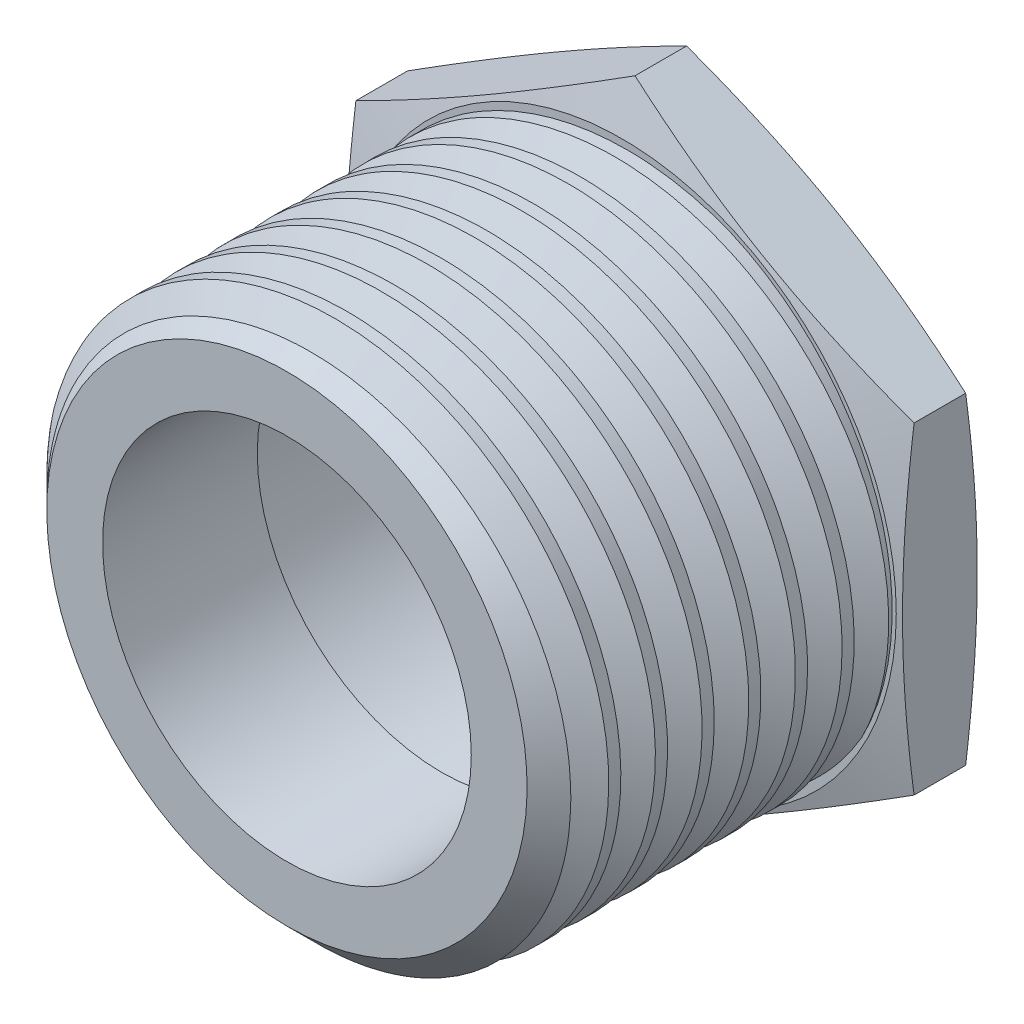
ISO-10303-21;
HEADER;
FILE_DESCRIPTION(('STEP AP214'),'2;1');
FILE_NAME('part.step','',(''),(''),'','','');
FILE_SCHEMA(('AUTOMOTIVE_DESIGN { 1 0 10303 214 1 1 1 1 }'));
ENDSEC;
DATA;
#1=APPLICATION_CONTEXT('core data for automotive mechanical design processes');
#2=APPLICATION_PROTOCOL_DEFINITION('international standard','automotive_design',2000,#1);
#3=PRODUCT_CONTEXT('',#1,'mechanical');
#4=PRODUCT('Part','Part','',(#3));
#5=PRODUCT_RELATED_PRODUCT_CATEGORY('part','',(#4));
#6=PRODUCT_DEFINITION_FORMATION('','',#4);
#7=PRODUCT_DEFINITION_CONTEXT('part definition',#1,'design');
#8=PRODUCT_DEFINITION('design','',#6,#7);
#9=PRODUCT_DEFINITION_SHAPE('','',#8);
#10=(LENGTH_UNIT() NAMED_UNIT(*) SI_UNIT(.MILLI.,.METRE.));
#11=(NAMED_UNIT(*) PLANE_ANGLE_UNIT() SI_UNIT($,.RADIAN.));
#12=(NAMED_UNIT(*) SI_UNIT($,.STERADIAN.) SOLID_ANGLE_UNIT());
#13=UNCERTAINTY_MEASURE_WITH_UNIT(LENGTH_MEASURE(1.E-05),#10,'distance_accuracy_value','');
#14=(GEOMETRIC_REPRESENTATION_CONTEXT(3) GLOBAL_UNCERTAINTY_ASSIGNED_CONTEXT((#13)) GLOBAL_UNIT_ASSIGNED_CONTEXT((#10,
#11,#12)) REPRESENTATION_CONTEXT('',''));
#15=CARTESIAN_POINT('',(0.,0.,0.));
#16=DIRECTION('',(0.,0.,1.));
#17=DIRECTION('',(1.,0.,0.));
#18=AXIS2_PLACEMENT_3D('',#15,#16,#17);
#19=CARTESIAN_POINT('',(0.,0.,-0.747006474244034));
#20=DIRECTION('',(0.,0.,1.));
#21=DIRECTION('',(1.,0.,0.));
#22=AXIS2_PLACEMENT_3D('',#19,#20,#21);
#23=CYLINDRICAL_SURFACE('',#22,7.15);
#24=CARTESIAN_POINT('',(0.,0.,13.));
#25=DIRECTION('',(0.,0.,1.));
#26=DIRECTION('',(1.,0.,0.));
#27=AXIS2_PLACEMENT_3D('',#24,#25,#26);
#28=CIRCLE('',#27,7.15);
#29=CARTESIAN_POINT('',(7.15,0.,13.));
#30=VERTEX_POINT('',#29);
#31=EDGE_CURVE('E212',#30,#30,#28,.T.);
#32=ORIENTED_EDGE('',*,*,#31,.T.);
#33=EDGE_LOOP('',(#32));
#34=FACE_BOUND('',#33,.T.);
#35=CARTESIAN_POINT('',(0.,0.,7.));
#36=DIRECTION('',(0.,0.,-1.));
#37=DIRECTION('',(-1.,0.,0.));
#38=AXIS2_PLACEMENT_3D('',#35,#36,#37);
#39=CIRCLE('',#38,7.15);
#40=CARTESIAN_POINT('',(-7.15,0.,7.));
#41=VERTEX_POINT('',#40);
#42=EDGE_CURVE('E32',#41,#41,#39,.F.);
#43=ORIENTED_EDGE('',*,*,#42,.F.);
#44=EDGE_LOOP('',(#43));
#45=FACE_BOUND('',#44,.T.);
#46=ADVANCED_FACE('F28',(#34,#45),#23,.F.);
#47=CARTESIAN_POINT('',(0.,0.,-0.500000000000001));
#48=DIRECTION('',(0.,0.,-1.));
#49=DIRECTION('',(-1.,0.,0.));
#50=AXIS2_PLACEMENT_3D('',#47,#48,#49);
#51=CONICAL_SURFACE('',#50,12.5,1.30899693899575);
#52=CARTESIAN_POINT('',(0.,0.,0.));
#53=DIRECTION('',(0.,0.,-1.));
#54=DIRECTION('',(-1.,0.,0.));
#55=AXIS2_PLACEMENT_3D('',#52,#53,#54);
#56=CIRCLE('',#55,10.6339745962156);
#57=CARTESIAN_POINT('',(-10.6339745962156,0.,0.));
#58=VERTEX_POINT('',#57);
#59=EDGE_CURVE('E281',#58,#58,#56,.F.);
#60=ORIENTED_EDGE('',*,*,#59,.F.);
#61=EDGE_LOOP('',(#60));
#62=FACE_BOUND('',#61,.T.);
#63=CARTESIAN_POINT('',(0.000200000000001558,12.5001154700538,-0.500030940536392));
#64=CARTESIAN_POINT('',(-0.449364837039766,12.2405590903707,-0.430454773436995));
#65=CARTESIAN_POINT('',(-0.89974476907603,11.980532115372,-0.367291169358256));
#66=CARTESIAN_POINT('',(-1.80209513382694,11.4595598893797,-0.256318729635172));
#67=CARTESIAN_POINT('',(-2.25406613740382,11.1986143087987,-0.208516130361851));
#68=CARTESIAN_POINT('',(-3.15685843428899,10.6773869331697,-0.13105630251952));
#69=CARTESIAN_POINT('',(-3.6076736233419,10.4171086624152,-0.101306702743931));
#70=CARTESIAN_POINT('',(-4.50987888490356,9.89622021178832,-0.0614155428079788));
#71=CARTESIAN_POINT('',(-4.96126882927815,9.63561010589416,-0.0512701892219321));
#72=CARTESIAN_POINT('',(-5.86404871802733,9.11438989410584,-0.0512701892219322));
#73=CARTESIAN_POINT('',(-6.31543866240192,8.85377978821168,-0.0614155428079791));
#74=CARTESIAN_POINT('',(-7.21764392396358,8.33289133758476,-0.101306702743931));
#75=CARTESIAN_POINT('',(-7.66845911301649,8.07261306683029,-0.131056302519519));
#76=CARTESIAN_POINT('',(-8.57125140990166,7.55138569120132,-0.20851613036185));
#77=CARTESIAN_POINT('',(-9.02322241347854,7.2904401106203,-0.256318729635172));
#78=CARTESIAN_POINT('',(-9.92557277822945,6.769467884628,-0.367291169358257));
#79=CARTESIAN_POINT('',(-10.3759527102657,6.50944090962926,-0.430454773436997));
#80=CARTESIAN_POINT('',(-10.8255175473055,6.24988452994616,-0.500030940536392));
#81=B_SPLINE_CURVE_WITH_KNOTS('',3,(#63,#64,#65,#66,#67,#68,#69,#70,#71,#72,#73,#74,#75,#76,#77,
#78,#79,#80),.UNSPECIFIED.,.F.,.F.,(4,2,2,2,2,2,2,2,4),(0.,1.57134617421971,3.14332949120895,
4.70720013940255,6.27076814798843,7.83433615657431,9.39820680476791,10.9701901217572,
12.5415362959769),.UNSPECIFIED.);
#82=CARTESIAN_POINT('',(0.,12.5,-0.500000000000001));
#83=VERTEX_POINT('',#82);
#84=CARTESIAN_POINT('',(-10.8253175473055,6.25,-0.500000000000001));
#85=VERTEX_POINT('',#84);
#86=EDGE_CURVE('E97',#83,#85,#81,.T.);
#87=ORIENTED_EDGE('',*,*,#86,.T.);
#88=CARTESIAN_POINT('',(-10.8253175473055,-16.5203977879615,-2.44296092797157));
#89=CARTESIAN_POINT('',(-10.8253175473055,-16.0294322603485,-2.33295579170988));
#90=CARTESIAN_POINT('',(-10.8253175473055,-15.538159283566,-2.22429823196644));
#91=CARTESIAN_POINT('',(-10.8253175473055,-14.5548474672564,-2.0104056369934));
#92=CARTESIAN_POINT('',(-10.8253175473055,-14.0628085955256,-1.90517074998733));
#93=CARTESIAN_POINT('',(-10.8253175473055,-13.0773714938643,-1.69875892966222));
#94=CARTESIAN_POINT('',(-10.8253175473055,-12.5839724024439,-1.59758609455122));
#95=CARTESIAN_POINT('',(-10.8253175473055,-11.596146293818,-1.4003925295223));
#96=CARTESIAN_POINT('',(-10.8253175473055,-11.1017192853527,-1.30437175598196));
#97=CARTESIAN_POINT('',(-10.8253175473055,-10.1156146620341,-1.11945127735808));
#98=CARTESIAN_POINT('',(-10.8253175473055,-9.62394660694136,-1.03050084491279));
#99=CARTESIAN_POINT('',(-10.8253175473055,-8.63925597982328,-0.860377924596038));
#100=CARTESIAN_POINT('',(-10.8253175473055,-8.14623340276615,-0.779205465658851));
#101=CARTESIAN_POINT('',(-10.8253175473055,-7.15875851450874,-0.626472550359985));
#102=CARTESIAN_POINT('',(-10.8253175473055,-6.66430641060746,-0.554910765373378));
#103=CARTESIAN_POINT('',(-10.8253175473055,-5.67382920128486,-0.42350916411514));
#104=CARTESIAN_POINT('',(-10.8253175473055,-5.17780409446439,-0.363669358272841));
#105=CARTESIAN_POINT('',(-10.8253175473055,-4.17858982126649,-0.257408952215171));
#106=CARTESIAN_POINT('',(-10.8253175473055,-3.6753833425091,-0.211148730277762));
#107=CARTESIAN_POINT('',(-10.8253175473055,-2.66770817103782,-0.135240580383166));
#108=CARTESIAN_POINT('',(-10.8253175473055,-2.16323950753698,-0.105592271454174));
#109=CARTESIAN_POINT('',(-10.8253175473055,-1.15377148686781,-0.0646372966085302));
#110=CARTESIAN_POINT('',(-10.8253175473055,-0.648772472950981,-0.0533223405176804));
#111=CARTESIAN_POINT('',(-10.8253175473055,0.361294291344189,-0.0497294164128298));
#112=CARTESIAN_POINT('',(-10.8253175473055,0.866362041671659,-0.0574514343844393));
#113=CARTESIAN_POINT('',(-10.8253175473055,1.87769705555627,-0.0914982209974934));
#114=CARTESIAN_POINT('',(-10.8253175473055,2.38396199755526,-0.117890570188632));
#115=CARTESIAN_POINT('',(-10.8253175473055,3.39529952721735,-0.187772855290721));
#116=CARTESIAN_POINT('',(-10.8253175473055,3.90037208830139,-0.231263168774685));
#117=CARTESIAN_POINT('',(-10.8253175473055,4.90932108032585,-0.333147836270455));
#118=CARTESIAN_POINT('',(-10.8253175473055,5.41319651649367,-0.391551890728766));
#119=CARTESIAN_POINT('',(-10.8253175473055,6.41932628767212,-0.520837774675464));
#120=CARTESIAN_POINT('',(-10.8253175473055,6.92158061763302,-0.591719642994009));
#121=CARTESIAN_POINT('',(-10.8253175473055,7.89111249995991,-0.738635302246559));
#122=CARTESIAN_POINT('',(-10.8253175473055,8.35849076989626,-0.814011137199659));
#123=CARTESIAN_POINT('',(-10.8253175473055,9.29201688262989,-0.972065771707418));
#124=CARTESIAN_POINT('',(-10.8253175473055,9.75816469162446,-1.05474476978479));
#125=CARTESIAN_POINT('',(-10.8253175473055,10.6894046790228,-1.2260734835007));
#126=CARTESIAN_POINT('',(-10.8253175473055,11.15449674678,-1.31472379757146));
#127=CARTESIAN_POINT('',(-10.8253175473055,12.0837180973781,-1.49689549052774));
#128=CARTESIAN_POINT('',(-10.8253175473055,12.5478473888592,-1.59041682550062));
#129=CARTESIAN_POINT('',(-10.8253175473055,13.4753907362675,-1.78147345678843));
#130=CARTESIAN_POINT('',(-10.8253175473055,13.9388045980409,-1.87900969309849));
#131=CARTESIAN_POINT('',(-10.8253175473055,14.8649275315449,-2.07737746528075));
#132=CARTESIAN_POINT('',(-10.8253175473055,15.3276365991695,-2.178209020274));
#133=CARTESIAN_POINT('',(-10.8253175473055,16.7148020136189,-2.48475792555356));
#134=CARTESIAN_POINT('',(-10.8253175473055,17.6383591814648,-2.69454258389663));
#135=CARTESIAN_POINT('',(-10.8253175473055,19.4746269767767,-3.11957773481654));
#136=CARTESIAN_POINT('',(-10.8253175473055,20.3873548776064,-3.33475408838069));
#137=CARTESIAN_POINT('',(-10.8253175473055,22.2115388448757,-3.77049495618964));
#138=CARTESIAN_POINT('',(-10.8253175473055,23.1229948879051,-3.99105956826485));
#139=CARTESIAN_POINT('',(-10.8253175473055,24.9438094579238,-4.43590571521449));
#140=CARTESIAN_POINT('',(-10.8253175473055,25.8531691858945,-4.66018234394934));
#141=CARTESIAN_POINT('',(-10.8253175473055,27.2166290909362,-4.99886433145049));
#142=CARTESIAN_POINT('',(-10.8253175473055,27.6710118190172,-5.11213433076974));
#143=CARTESIAN_POINT('',(-10.8253175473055,28.57960934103,-5.33934389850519));
#144=CARTESIAN_POINT('',(-10.8253175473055,29.0338241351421,-5.45328346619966));
#145=CARTESIAN_POINT('',(-10.8253175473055,29.4879656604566,-5.56751430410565));
#146=B_SPLINE_CURVE_WITH_KNOTS('',3,(#88,#89,#90,#91,#92,#93,#94,#95,#96,#97,#98,#99,#100,#101,
#102,#103,#104,#105,#106,#107,#108,#109,#110,#111,#112,#113,#114,#115,#116,#117,#118,#119,#120,
#121,#122,#123,#124,#125,#126,#127,#128,#129,#130,#131,#132,#133,#134,#135,#136,#137,#138,#139,
#140,#141,#142,#143,#144,#145),.UNSPECIFIED.,.F.,.F.,(4,2,2,2,2,2,2,2,2,2,2,2,2,2,2,2,2,2,2,2,2,
2,2,2,2,2,2,2,4),(0.,1.50942144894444,3.0189081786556,4.52988140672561,6.04084183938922,
7.53974051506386,9.03864476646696,10.5373415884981,12.0360397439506,13.5517847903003,
15.0674950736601,16.5825197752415,18.0975433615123,19.6180790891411,21.1386483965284,
22.6602092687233,24.1817748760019,25.6019586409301,27.0221810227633,28.4425459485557,
29.862898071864,31.2835846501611,32.7042794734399,35.545477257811,38.3587050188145,
41.1719838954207,43.9818020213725,45.3866659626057,46.7915283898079),.UNSPECIFIED.);
#147=CARTESIAN_POINT('',(-10.8253175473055,-6.25,-0.500000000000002));
#148=VERTEX_POINT('',#147);
#149=EDGE_CURVE('E204',#85,#148,#146,.F.);
#150=ORIENTED_EDGE('',*,*,#149,.T.);
#151=CARTESIAN_POINT('',(-10.8255175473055,-6.24988452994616,-0.500030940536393));
#152=CARTESIAN_POINT('',(-10.3759527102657,-6.50944090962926,-0.430454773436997));
#153=CARTESIAN_POINT('',(-9.92557277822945,-6.76946788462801,-0.367291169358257));
#154=CARTESIAN_POINT('',(-9.02322241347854,-7.2904401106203,-0.256318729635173));
#155=CARTESIAN_POINT('',(-8.57125140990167,-7.55138569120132,-0.208516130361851));
#156=CARTESIAN_POINT('',(-7.6684591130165,-8.07261306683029,-0.13105630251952));
#157=CARTESIAN_POINT('',(-7.21764392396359,-8.33289133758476,-0.101306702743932));
#158=CARTESIAN_POINT('',(-6.31543866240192,-8.85377978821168,-0.0614155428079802));
#159=CARTESIAN_POINT('',(-5.86404871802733,-9.11438989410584,-0.0512701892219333));
#160=CARTESIAN_POINT('',(-4.96126882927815,-9.63561010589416,-0.0512701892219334));
#161=CARTESIAN_POINT('',(-4.50987888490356,-9.89622021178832,-0.0614155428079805));
#162=CARTESIAN_POINT('',(-3.6076736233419,-10.4171086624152,-0.101306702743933));
#163=CARTESIAN_POINT('',(-3.15685843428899,-10.6773869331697,-0.131056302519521));
#164=CARTESIAN_POINT('',(-2.25406613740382,-11.1986143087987,-0.208516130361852));
#165=CARTESIAN_POINT('',(-1.80209513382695,-11.4595598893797,-0.256318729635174));
#166=CARTESIAN_POINT('',(-0.899744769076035,-11.980532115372,-0.367291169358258));
#167=CARTESIAN_POINT('',(-0.449364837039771,-12.2405590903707,-0.430454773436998));
#168=CARTESIAN_POINT('',(0.000199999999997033,-12.5001154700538,-0.500030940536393));
#169=B_SPLINE_CURVE_WITH_KNOTS('',3,(#151,#152,#153,#154,#155,#156,#157,#158,#159,#160,#161,
#162,#163,#164,#165,#166,#167,#168),.UNSPECIFIED.,.F.,.F.,(4,2,2,2,2,2,2,2,4),(0.,
1.57134617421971,3.14332949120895,4.70720013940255,6.27076814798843,7.83433615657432,
9.39820680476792,10.9701901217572,12.5415362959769),.UNSPECIFIED.);
#170=CARTESIAN_POINT('',(0.,-12.5,-0.500000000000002));
#171=VERTEX_POINT('',#170);
#172=EDGE_CURVE('E198',#148,#171,#169,.T.);
#173=ORIENTED_EDGE('',*,*,#172,.T.);
#174=CARTESIAN_POINT('',(-0.000200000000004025,-12.5001154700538,-0.500030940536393));
#175=CARTESIAN_POINT('',(0.449364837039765,-12.2405590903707,-0.430454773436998));
#176=CARTESIAN_POINT('',(0.899744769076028,-11.980532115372,-0.367291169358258));
#177=CARTESIAN_POINT('',(1.80209513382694,-11.4595598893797,-0.256318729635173));
#178=CARTESIAN_POINT('',(2.25406613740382,-11.1986143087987,-0.208516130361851));
#179=CARTESIAN_POINT('',(3.15685843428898,-10.6773869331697,-0.13105630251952));
#180=CARTESIAN_POINT('',(3.6076736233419,-10.4171086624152,-0.101306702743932));
#181=CARTESIAN_POINT('',(4.50987888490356,-9.89622021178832,-0.0614155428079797));
#182=CARTESIAN_POINT('',(4.96126882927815,-9.63561010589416,-0.0512701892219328));
#183=CARTESIAN_POINT('',(5.86404871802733,-9.11438989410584,-0.0512701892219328));
#184=CARTESIAN_POINT('',(6.31543866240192,-8.85377978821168,-0.0614155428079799));
#185=CARTESIAN_POINT('',(7.21764392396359,-8.33289133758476,-0.101306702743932));
#186=CARTESIAN_POINT('',(7.6684591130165,-8.07261306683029,-0.131056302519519));
#187=CARTESIAN_POINT('',(8.57125140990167,-7.55138569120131,-0.20851613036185));
#188=CARTESIAN_POINT('',(9.02322241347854,-7.2904401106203,-0.256318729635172));
#189=CARTESIAN_POINT('',(9.92557277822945,-6.769467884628,-0.367291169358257));
#190=CARTESIAN_POINT('',(10.3759527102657,-6.50944090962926,-0.430454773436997));
#191=CARTESIAN_POINT('',(10.8255175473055,-6.24988452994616,-0.500030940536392));
#192=B_SPLINE_CURVE_WITH_KNOTS('',3,(#174,#175,#176,#177,#178,#179,#180,#181,#182,#183,#184,
#185,#186,#187,#188,#189,#190,#191),.UNSPECIFIED.,.F.,.F.,(4,2,2,2,2,2,2,2,4),(0.,
1.57134617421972,3.14332949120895,4.70720013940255,6.27076814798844,7.83433615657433,
9.39820680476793,10.9701901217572,12.5415362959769),.UNSPECIFIED.);
#193=CARTESIAN_POINT('',(10.8253175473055,-6.25,-0.500000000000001));
#194=VERTEX_POINT('',#193);
#195=EDGE_CURVE('E119',#171,#194,#192,.T.);
#196=ORIENTED_EDGE('',*,*,#195,.T.);
#197=CARTESIAN_POINT('',(10.8253175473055,-16.5203977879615,-2.44296092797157));
#198=CARTESIAN_POINT('',(10.8253175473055,-16.0294322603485,-2.33295579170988));
#199=CARTESIAN_POINT('',(10.8253175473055,-15.538159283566,-2.22429823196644));
#200=CARTESIAN_POINT('',(10.8253175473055,-14.5548474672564,-2.01040563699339));
#201=CARTESIAN_POINT('',(10.8253175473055,-14.0628085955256,-1.90517074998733));
#202=CARTESIAN_POINT('',(10.8253175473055,-13.0773714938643,-1.69875892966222));
#203=CARTESIAN_POINT('',(10.8253175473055,-12.5839724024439,-1.59758609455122));
#204=CARTESIAN_POINT('',(10.8253175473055,-11.596146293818,-1.4003925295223));
#205=CARTESIAN_POINT('',(10.8253175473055,-11.1017192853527,-1.30437175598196));
#206=CARTESIAN_POINT('',(10.8253175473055,-10.1156146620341,-1.11945127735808));
#207=CARTESIAN_POINT('',(10.8253175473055,-9.62394660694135,-1.03050084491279));
#208=CARTESIAN_POINT('',(10.8253175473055,-8.63925597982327,-0.860377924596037));
#209=CARTESIAN_POINT('',(10.8253175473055,-8.14623340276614,-0.77920546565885));
#210=CARTESIAN_POINT('',(10.8253175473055,-7.15875851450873,-0.626472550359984));
#211=CARTESIAN_POINT('',(10.8253175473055,-6.66430641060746,-0.554910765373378));
#212=CARTESIAN_POINT('',(10.8253175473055,-5.67382920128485,-0.423509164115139));
#213=CARTESIAN_POINT('',(10.8253175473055,-5.17780409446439,-0.36366935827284));
#214=CARTESIAN_POINT('',(10.8253175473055,-4.17858982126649,-0.257408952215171));
#215=CARTESIAN_POINT('',(10.8253175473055,-3.6753833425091,-0.211148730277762));
#216=CARTESIAN_POINT('',(10.8253175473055,-2.66770817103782,-0.135240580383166));
#217=CARTESIAN_POINT('',(10.8253175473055,-2.16323950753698,-0.105592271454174));
#218=CARTESIAN_POINT('',(10.8253175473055,-1.15377148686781,-0.0646372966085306));
#219=CARTESIAN_POINT('',(10.8253175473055,-0.648772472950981,-0.0533223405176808));
#220=CARTESIAN_POINT('',(10.8253175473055,0.361294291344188,-0.0497294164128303));
#221=CARTESIAN_POINT('',(10.8253175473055,0.866362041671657,-0.0574514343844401));
#222=CARTESIAN_POINT('',(10.8253175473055,1.87769705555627,-0.0914982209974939));
#223=CARTESIAN_POINT('',(10.8253175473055,2.38396199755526,-0.117890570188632));
#224=CARTESIAN_POINT('',(10.8253175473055,3.39529952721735,-0.187772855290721));
#225=CARTESIAN_POINT('',(10.8253175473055,3.9003720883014,-0.231263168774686));
#226=CARTESIAN_POINT('',(10.8253175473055,4.90932108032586,-0.333147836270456));
#227=CARTESIAN_POINT('',(10.8253175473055,5.41319651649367,-0.391551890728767));
#228=CARTESIAN_POINT('',(10.8253175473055,6.41932628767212,-0.520837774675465));
#229=CARTESIAN_POINT('',(10.8253175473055,6.92158061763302,-0.59171964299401));
#230=CARTESIAN_POINT('',(10.8253175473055,7.89111249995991,-0.73863530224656));
#231=CARTESIAN_POINT('',(10.8253175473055,8.35849076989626,-0.81401113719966));
#232=CARTESIAN_POINT('',(10.8253175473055,9.29201688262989,-0.97206577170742));
#233=CARTESIAN_POINT('',(10.8253175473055,9.75816469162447,-1.0547447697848));
#234=CARTESIAN_POINT('',(10.8253175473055,10.6894046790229,-1.2260734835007));
#235=CARTESIAN_POINT('',(10.8253175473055,11.15449674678,-1.31472379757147));
#236=CARTESIAN_POINT('',(10.8253175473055,12.0837180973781,-1.49689549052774));
#237=CARTESIAN_POINT('',(10.8253175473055,12.5478473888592,-1.59041682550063));
#238=CARTESIAN_POINT('',(10.8253175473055,13.4753907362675,-1.78147345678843));
#239=CARTESIAN_POINT('',(10.8253175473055,13.9388045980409,-1.87900969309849));
#240=CARTESIAN_POINT('',(10.8253175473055,14.8649275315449,-2.07737746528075));
#241=CARTESIAN_POINT('',(10.8253175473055,15.3276365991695,-2.178209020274));
#242=CARTESIAN_POINT('',(10.8253175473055,16.7148020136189,-2.48475792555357));
#243=CARTESIAN_POINT('',(10.8253175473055,17.6383591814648,-2.69454258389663));
#244=CARTESIAN_POINT('',(10.8253175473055,19.4746269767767,-3.11957773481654));
#245=CARTESIAN_POINT('',(10.8253175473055,20.3873548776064,-3.33475408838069));
#246=CARTESIAN_POINT('',(10.8253175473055,22.2115388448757,-3.77049495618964));
#247=CARTESIAN_POINT('',(10.8253175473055,23.1229948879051,-3.99105956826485));
#248=CARTESIAN_POINT('',(10.8253175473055,24.9438094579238,-4.43590571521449));
#249=CARTESIAN_POINT('',(10.8253175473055,25.8531691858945,-4.66018234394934));
#250=CARTESIAN_POINT('',(10.8253175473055,27.2166290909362,-4.99886433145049));
#251=CARTESIAN_POINT('',(10.8253175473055,27.6710118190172,-5.11213433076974));
#252=CARTESIAN_POINT('',(10.8253175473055,28.57960934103,-5.33934389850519));
#253=CARTESIAN_POINT('',(10.8253175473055,29.0338241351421,-5.45328346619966));
#254=CARTESIAN_POINT('',(10.8253175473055,29.4879656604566,-5.56751430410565));
#255=B_SPLINE_CURVE_WITH_KNOTS('',3,(#197,#198,#199,#200,#201,#202,#203,#204,#205,#206,#207,
#208,#209,#210,#211,#212,#213,#214,#215,#216,#217,#218,#219,#220,#221,#222,#223,#224,#225,#226,
#227,#228,#229,#230,#231,#232,#233,#234,#235,#236,#237,#238,#239,#240,#241,#242,#243,#244,#245,
#246,#247,#248,#249,#250,#251,#252,#253,#254),.UNSPECIFIED.,.F.,.F.,(4,2,2,2,2,2,2,2,2,2,2,2,2,
2,2,2,2,2,2,2,2,2,2,2,2,2,2,2,4),(0.,1.50942144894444,3.0189081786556,4.52988140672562,
6.04084183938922,7.53974051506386,9.03864476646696,10.5373415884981,12.0360397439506,
13.5517847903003,15.0674950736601,16.5825197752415,18.0975433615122,19.6180790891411,
21.1386483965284,22.6602092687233,24.1817748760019,25.6019586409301,27.0221810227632,
28.4425459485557,29.8628980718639,31.2835846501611,32.7042794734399,35.545477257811,
38.3587050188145,41.1719838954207,43.9818020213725,45.3866659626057,46.7915283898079),.UNSPECIFIED.);
#256=CARTESIAN_POINT('',(10.8253175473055,6.25,-0.500000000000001));
#257=VERTEX_POINT('',#256);
#258=EDGE_CURVE('E117',#194,#257,#255,.T.);
#259=ORIENTED_EDGE('',*,*,#258,.T.);
#260=CARTESIAN_POINT('',(10.8255175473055,6.24988452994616,-0.500030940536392));
#261=CARTESIAN_POINT('',(10.3759527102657,6.50944090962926,-0.430454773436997));
#262=CARTESIAN_POINT('',(9.92557277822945,6.769467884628,-0.367291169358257));
#263=CARTESIAN_POINT('',(9.02322241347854,7.2904401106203,-0.256318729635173));
#264=CARTESIAN_POINT('',(8.57125140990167,7.55138569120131,-0.20851613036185));
#265=CARTESIAN_POINT('',(7.6684591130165,8.07261306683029,-0.13105630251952));
#266=CARTESIAN_POINT('',(7.21764392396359,8.33289133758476,-0.101306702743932));
#267=CARTESIAN_POINT('',(6.31543866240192,8.85377978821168,-0.0614155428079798));
#268=CARTESIAN_POINT('',(5.86404871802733,9.11438989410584,-0.0512701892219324));
#269=CARTESIAN_POINT('',(4.96126882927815,9.63561010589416,-0.0512701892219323));
#270=CARTESIAN_POINT('',(4.50987888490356,9.89622021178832,-0.0614155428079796));
#271=CARTESIAN_POINT('',(3.6076736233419,10.4171086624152,-0.101306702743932));
#272=CARTESIAN_POINT('',(3.15685843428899,10.6773869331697,-0.13105630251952));
#273=CARTESIAN_POINT('',(2.25406613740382,11.1986143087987,-0.20851613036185));
#274=CARTESIAN_POINT('',(1.80209513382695,11.4595598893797,-0.256318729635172));
#275=CARTESIAN_POINT('',(0.899744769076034,11.980532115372,-0.367291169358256));
#276=CARTESIAN_POINT('',(0.44936483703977,12.2405590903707,-0.430454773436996));
#277=CARTESIAN_POINT('',(-0.000199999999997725,12.5001154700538,-0.500030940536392));
#278=B_SPLINE_CURVE_WITH_KNOTS('',3,(#260,#261,#262,#263,#264,#265,#266,#267,#268,#269,#270,
#271,#272,#273,#274,#275,#276,#277),.UNSPECIFIED.,.F.,.F.,(4,2,2,2,2,2,2,2,4),(0.,
1.57134617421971,3.14332949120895,4.70720013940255,6.27076814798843,7.83433615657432,
9.39820680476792,10.9701901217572,12.5415362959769),.UNSPECIFIED.);
#279=EDGE_CURVE('E102',#257,#83,#278,.T.);
#280=ORIENTED_EDGE('',*,*,#279,.T.);
#281=EDGE_LOOP('',(#87,#150,#173,#196,#259,#280));
#282=FACE_BOUND('',#281,.T.);
#283=ADVANCED_FACE('F115',(#62,#282),#51,.T.);
#284=CARTESIAN_POINT('',(0.,0.,-3.));
#285=DIRECTION('',(0.,0.,1.));
#286=DIRECTION('',(1.,0.,0.));
#287=AXIS2_PLACEMENT_3D('',#284,#285,#286);
#288=CONICAL_SURFACE('',#287,10.6339745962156,1.30899693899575);
#289=CARTESIAN_POINT('',(0.,0.,-3.));
#290=DIRECTION('',(0.,0.,-1.));
#291=DIRECTION('',(-1.,0.,0.));
#292=AXIS2_PLACEMENT_3D('',#289,#290,#291);
#293=CIRCLE('',#292,10.6339745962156);
#294=CARTESIAN_POINT('',(-10.6339745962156,0.,-3.));
#295=VERTEX_POINT('',#294);
#296=EDGE_CURVE('E283',#295,#295,#293,.T.);
#297=ORIENTED_EDGE('',*,*,#296,.F.);
#298=EDGE_LOOP('',(#297));
#299=FACE_BOUND('',#298,.T.);
#300=CARTESIAN_POINT('',(0.000199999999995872,-12.5001154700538,-2.49996905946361));
#301=CARTESIAN_POINT('',(-0.449364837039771,-12.2405590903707,-2.569545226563));
#302=CARTESIAN_POINT('',(-0.899744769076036,-11.980532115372,-2.63270883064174));
#303=CARTESIAN_POINT('',(-1.80209513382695,-11.4595598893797,-2.74368127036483));
#304=CARTESIAN_POINT('',(-2.25406613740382,-11.1986143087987,-2.79148386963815));
#305=CARTESIAN_POINT('',(-3.15685843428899,-10.6773869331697,-2.86894369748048));
#306=CARTESIAN_POINT('',(-3.6076736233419,-10.4171086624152,-2.89869329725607));
#307=CARTESIAN_POINT('',(-4.50987888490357,-9.89622021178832,-2.93858445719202));
#308=CARTESIAN_POINT('',(-4.96126882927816,-9.63561010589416,-2.94872981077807));
#309=CARTESIAN_POINT('',(-5.86404871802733,-9.11438989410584,-2.94872981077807));
#310=CARTESIAN_POINT('',(-6.31543866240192,-8.85377978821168,-2.93858445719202));
#311=CARTESIAN_POINT('',(-7.21764392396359,-8.33289133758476,-2.89869329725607));
#312=CARTESIAN_POINT('',(-7.6684591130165,-8.07261306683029,-2.86894369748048));
#313=CARTESIAN_POINT('',(-8.57125140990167,-7.55138569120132,-2.79148386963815));
#314=CARTESIAN_POINT('',(-9.02322241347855,-7.2904401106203,-2.74368127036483));
#315=CARTESIAN_POINT('',(-9.92557277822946,-6.76946788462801,-2.63270883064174));
#316=CARTESIAN_POINT('',(-10.3759527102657,-6.50944090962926,-2.569545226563));
#317=CARTESIAN_POINT('',(-10.8255175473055,-6.24988452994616,-2.49996905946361));
#318=B_SPLINE_CURVE_WITH_KNOTS('',3,(#300,#301,#302,#303,#304,#305,#306,#307,#308,#309,#310,
#311,#312,#313,#314,#315,#316,#317),.UNSPECIFIED.,.F.,.F.,(4,2,2,2,2,2,2,2,4),(0.,
1.57134617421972,3.14332949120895,4.70720013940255,6.27076814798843,7.83433615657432,
9.39820680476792,10.9701901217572,12.5415362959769),.UNSPECIFIED.);
#319=CARTESIAN_POINT('',(0.,-12.5,-2.5));
#320=VERTEX_POINT('',#319);
#321=CARTESIAN_POINT('',(-10.8253175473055,-6.25,-2.5));
#322=VERTEX_POINT('',#321);
#323=EDGE_CURVE('E37',#320,#322,#318,.T.);
#324=ORIENTED_EDGE('',*,*,#323,.T.);
#325=CARTESIAN_POINT('',(-10.8253175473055,-16.5203977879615,-0.557039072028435));
#326=CARTESIAN_POINT('',(-10.8253175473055,-16.0294322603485,-0.667044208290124));
#327=CARTESIAN_POINT('',(-10.8253175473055,-15.538159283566,-0.77570176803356));
#328=CARTESIAN_POINT('',(-10.8253175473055,-14.5548474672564,-0.989594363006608));
#329=CARTESIAN_POINT('',(-10.8253175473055,-14.0628085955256,-1.09482925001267));
#330=CARTESIAN_POINT('',(-10.8253175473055,-13.0773714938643,-1.30124107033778));
#331=CARTESIAN_POINT('',(-10.8253175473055,-12.5839724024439,-1.40241390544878));
#332=CARTESIAN_POINT('',(-10.8253175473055,-11.596146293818,-1.5996074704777));
#333=CARTESIAN_POINT('',(-10.8253175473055,-11.1017192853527,-1.69562824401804));
#334=CARTESIAN_POINT('',(-10.8253175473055,-10.1156146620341,-1.88054872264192));
#335=CARTESIAN_POINT('',(-10.8253175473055,-9.62394660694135,-1.96949915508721));
#336=CARTESIAN_POINT('',(-10.8253175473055,-8.63925597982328,-2.13962207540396));
#337=CARTESIAN_POINT('',(-10.8253175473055,-8.14623340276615,-2.22079453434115));
#338=CARTESIAN_POINT('',(-10.8253175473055,-7.15875851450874,-2.37352744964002));
#339=CARTESIAN_POINT('',(-10.8253175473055,-6.66430641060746,-2.44508923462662));
#340=CARTESIAN_POINT('',(-10.8253175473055,-5.67382920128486,-2.57649083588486));
#341=CARTESIAN_POINT('',(-10.8253175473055,-5.17780409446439,-2.63633064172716));
#342=CARTESIAN_POINT('',(-10.8253175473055,-4.17858982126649,-2.74259104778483));
#343=CARTESIAN_POINT('',(-10.8253175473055,-3.6753833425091,-2.78885126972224));
#344=CARTESIAN_POINT('',(-10.8253175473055,-2.66770817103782,-2.86475941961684));
#345=CARTESIAN_POINT('',(-10.8253175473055,-2.16323950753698,-2.89440772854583));
#346=CARTESIAN_POINT('',(-10.8253175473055,-1.15377148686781,-2.93536270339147));
#347=CARTESIAN_POINT('',(-10.8253175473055,-0.64877247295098,-2.94667765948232));
#348=CARTESIAN_POINT('',(-10.8253175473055,0.361294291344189,-2.95027058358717));
#349=CARTESIAN_POINT('',(-10.8253175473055,0.866362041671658,-2.94254856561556));
#350=CARTESIAN_POINT('',(-10.8253175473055,1.87769705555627,-2.90850177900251));
#351=CARTESIAN_POINT('',(-10.8253175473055,2.38396199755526,-2.88210942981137));
#352=CARTESIAN_POINT('',(-10.8253175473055,3.39529952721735,-2.81222714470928));
#353=CARTESIAN_POINT('',(-10.8253175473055,3.90037208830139,-2.76873683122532));
#354=CARTESIAN_POINT('',(-10.8253175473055,4.90932108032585,-2.66685216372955));
#355=CARTESIAN_POINT('',(-10.8253175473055,5.41319651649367,-2.60844810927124));
#356=CARTESIAN_POINT('',(-10.8253175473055,6.41932628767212,-2.47916222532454));
#357=CARTESIAN_POINT('',(-10.8253175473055,6.92158061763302,-2.40828035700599));
#358=CARTESIAN_POINT('',(-10.8253175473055,7.89111249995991,-2.26136469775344));
#359=CARTESIAN_POINT('',(-10.8253175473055,8.35849076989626,-2.18598886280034));
#360=CARTESIAN_POINT('',(-10.8253175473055,9.29201688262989,-2.02793422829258));
#361=CARTESIAN_POINT('',(-10.8253175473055,9.75816469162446,-1.94525523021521));
#362=CARTESIAN_POINT('',(-10.8253175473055,10.6894046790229,-1.7739265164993));
#363=CARTESIAN_POINT('',(-10.8253175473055,11.15449674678,-1.68527620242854));
#364=CARTESIAN_POINT('',(-10.8253175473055,12.0837180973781,-1.50310450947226));
#365=CARTESIAN_POINT('',(-10.8253175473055,12.5478473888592,-1.40958317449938));
#366=CARTESIAN_POINT('',(-10.8253175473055,13.4753907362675,-1.21852654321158));
#367=CARTESIAN_POINT('',(-10.8253175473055,13.9388045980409,-1.12099030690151));
#368=CARTESIAN_POINT('',(-10.8253175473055,14.8649275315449,-0.922622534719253));
#369=CARTESIAN_POINT('',(-10.8253175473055,15.3276365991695,-0.821790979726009));
#370=CARTESIAN_POINT('',(-10.8253175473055,16.7148020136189,-0.515242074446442));
#371=CARTESIAN_POINT('',(-10.8253175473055,17.6383591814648,-0.305457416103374));
#372=CARTESIAN_POINT('',(-10.8253175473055,19.4746269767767,0.119577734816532));
#373=CARTESIAN_POINT('',(-10.8253175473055,20.3873548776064,0.334754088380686));
#374=CARTESIAN_POINT('',(-10.8253175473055,22.2115388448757,0.770494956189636));
#375=CARTESIAN_POINT('',(-10.8253175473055,23.1229948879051,0.991059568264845));
#376=CARTESIAN_POINT('',(-10.8253175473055,24.9438094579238,1.43590571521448));
#377=CARTESIAN_POINT('',(-10.8253175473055,25.8531691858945,1.66018234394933));
#378=CARTESIAN_POINT('',(-10.8253175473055,27.2166290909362,1.99886433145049));
#379=CARTESIAN_POINT('',(-10.8253175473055,27.6710118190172,2.11213433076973));
#380=CARTESIAN_POINT('',(-10.8253175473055,28.57960934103,2.33934389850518));
#381=CARTESIAN_POINT('',(-10.8253175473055,29.0338241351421,2.45328346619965));
#382=CARTESIAN_POINT('',(-10.8253175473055,29.4879656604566,2.56751430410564));
#383=B_SPLINE_CURVE_WITH_KNOTS('',3,(#325,#326,#327,#328,#329,#330,#331,#332,#333,#334,#335,
#336,#337,#338,#339,#340,#341,#342,#343,#344,#345,#346,#347,#348,#349,#350,#351,#352,#353,#354,
#355,#356,#357,#358,#359,#360,#361,#362,#363,#364,#365,#366,#367,#368,#369,#370,#371,#372,#373,
#374,#375,#376,#377,#378,#379,#380,#381,#382),.UNSPECIFIED.,.F.,.F.,(4,2,2,2,2,2,2,2,2,2,2,2,2,
2,2,2,2,2,2,2,2,2,2,2,2,2,2,2,4),(0.,1.50942144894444,3.0189081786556,4.52988140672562,
6.04084183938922,7.53974051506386,9.03864476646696,10.5373415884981,12.0360397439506,
13.5517847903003,15.0674950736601,16.5825197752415,18.0975433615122,19.6180790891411,
21.1386483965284,22.6602092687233,24.1817748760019,25.6019586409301,27.0221810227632,
28.4425459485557,29.8628980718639,31.2835846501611,32.7042794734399,35.545477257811,
38.3587050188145,41.1719838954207,43.9818020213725,45.3866659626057,46.7915283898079),.UNSPECIFIED.);
#384=CARTESIAN_POINT('',(-10.8253175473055,6.25,-2.5));
#385=VERTEX_POINT('',#384);
#386=EDGE_CURVE('E11',#322,#385,#383,.T.);
#387=ORIENTED_EDGE('',*,*,#386,.T.);
#388=CARTESIAN_POINT('',(-10.8255175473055,6.24988452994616,-2.49996905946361));
#389=CARTESIAN_POINT('',(-10.3759527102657,6.50944090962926,-2.56954522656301));
#390=CARTESIAN_POINT('',(-9.92557277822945,6.76946788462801,-2.63270883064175));
#391=CARTESIAN_POINT('',(-9.02322241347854,7.2904401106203,-2.74368127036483));
#392=CARTESIAN_POINT('',(-8.57125140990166,7.55138569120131,-2.79148386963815));
#393=CARTESIAN_POINT('',(-7.6684591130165,8.07261306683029,-2.86894369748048));
#394=CARTESIAN_POINT('',(-7.21764392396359,8.33289133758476,-2.89869329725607));
#395=CARTESIAN_POINT('',(-6.31543866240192,8.85377978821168,-2.93858445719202));
#396=CARTESIAN_POINT('',(-5.86404871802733,9.11438989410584,-2.94872981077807));
#397=CARTESIAN_POINT('',(-4.96126882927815,9.63561010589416,-2.94872981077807));
#398=CARTESIAN_POINT('',(-4.50987888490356,9.89622021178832,-2.93858445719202));
#399=CARTESIAN_POINT('',(-3.6076736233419,10.4171086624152,-2.89869329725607));
#400=CARTESIAN_POINT('',(-3.15685843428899,10.6773869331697,-2.86894369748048));
#401=CARTESIAN_POINT('',(-2.25406613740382,11.1986143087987,-2.79148386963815));
#402=CARTESIAN_POINT('',(-1.80209513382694,11.4595598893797,-2.74368127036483));
#403=CARTESIAN_POINT('',(-0.899744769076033,11.980532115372,-2.63270883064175));
#404=CARTESIAN_POINT('',(-0.449364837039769,12.2405590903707,-2.56954522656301));
#405=CARTESIAN_POINT('',(0.000199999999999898,12.5001154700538,-2.49996905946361));
#406=B_SPLINE_CURVE_WITH_KNOTS('',3,(#388,#389,#390,#391,#392,#393,#394,#395,#396,#397,#398,
#399,#400,#401,#402,#403,#404,#405),.UNSPECIFIED.,.F.,.F.,(4,2,2,2,2,2,2,2,4),(0.,
1.57134617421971,3.14332949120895,4.70720013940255,6.27076814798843,7.83433615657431,
9.39820680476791,10.9701901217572,12.5415362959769),.UNSPECIFIED.);
#407=CARTESIAN_POINT('',(0.,12.5,-2.5));
#408=VERTEX_POINT('',#407);
#409=EDGE_CURVE('E154',#385,#408,#406,.T.);
#410=ORIENTED_EDGE('',*,*,#409,.T.);
#411=CARTESIAN_POINT('',(-0.000199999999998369,12.5001154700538,-2.49996905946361));
#412=CARTESIAN_POINT('',(0.449364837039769,12.2405590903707,-2.56954522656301));
#413=CARTESIAN_POINT('',(0.899744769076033,11.980532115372,-2.63270883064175));
#414=CARTESIAN_POINT('',(1.80209513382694,11.4595598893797,-2.74368127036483));
#415=CARTESIAN_POINT('',(2.25406613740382,11.1986143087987,-2.79148386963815));
#416=CARTESIAN_POINT('',(3.15685843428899,10.6773869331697,-2.86894369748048));
#417=CARTESIAN_POINT('',(3.6076736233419,10.4171086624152,-2.89869329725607));
#418=CARTESIAN_POINT('',(4.50987888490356,9.89622021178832,-2.93858445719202));
#419=CARTESIAN_POINT('',(4.96126882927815,9.63561010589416,-2.94872981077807));
#420=CARTESIAN_POINT('',(5.86404871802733,9.11438989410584,-2.94872981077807));
#421=CARTESIAN_POINT('',(6.31543866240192,8.85377978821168,-2.93858445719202));
#422=CARTESIAN_POINT('',(7.21764392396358,8.33289133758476,-2.89869329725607));
#423=CARTESIAN_POINT('',(7.6684591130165,8.07261306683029,-2.86894369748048));
#424=CARTESIAN_POINT('',(8.57125140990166,7.55138569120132,-2.79148386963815));
#425=CARTESIAN_POINT('',(9.02322241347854,7.2904401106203,-2.74368127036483));
#426=CARTESIAN_POINT('',(9.92557277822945,6.76946788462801,-2.63270883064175));
#427=CARTESIAN_POINT('',(10.3759527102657,6.50944090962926,-2.56954522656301));
#428=CARTESIAN_POINT('',(10.8255175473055,6.24988452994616,-2.49996905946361));
#429=B_SPLINE_CURVE_WITH_KNOTS('',3,(#411,#412,#413,#414,#415,#416,#417,#418,#419,#420,#421,
#422,#423,#424,#425,#426,#427,#428),.UNSPECIFIED.,.F.,.F.,(4,2,2,2,2,2,2,2,4),(0.,
1.57134617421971,3.14332949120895,4.70720013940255,6.27076814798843,7.83433615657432,
9.39820680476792,10.9701901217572,12.5415362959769),.UNSPECIFIED.);
#430=CARTESIAN_POINT('',(10.8253175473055,6.25,-2.5));
#431=VERTEX_POINT('',#430);
#432=EDGE_CURVE('E110',#408,#431,#429,.T.);
#433=ORIENTED_EDGE('',*,*,#432,.T.);
#434=CARTESIAN_POINT('',(10.8253175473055,-16.5203977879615,-0.557039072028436));
#435=CARTESIAN_POINT('',(10.8253175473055,-16.0294322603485,-0.667044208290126));
#436=CARTESIAN_POINT('',(10.8253175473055,-15.538159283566,-0.775701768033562));
#437=CARTESIAN_POINT('',(10.8253175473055,-14.5548474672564,-0.98959436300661));
#438=CARTESIAN_POINT('',(10.8253175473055,-14.0628085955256,-1.09482925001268));
#439=CARTESIAN_POINT('',(10.8253175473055,-13.0773714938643,-1.30124107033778));
#440=CARTESIAN_POINT('',(10.8253175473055,-12.5839724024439,-1.40241390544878));
#441=CARTESIAN_POINT('',(10.8253175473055,-11.596146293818,-1.5996074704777));
#442=CARTESIAN_POINT('',(10.8253175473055,-11.1017192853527,-1.69562824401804));
#443=CARTESIAN_POINT('',(10.8253175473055,-10.1156146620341,-1.88054872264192));
#444=CARTESIAN_POINT('',(10.8253175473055,-9.62394660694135,-1.96949915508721));
#445=CARTESIAN_POINT('',(10.8253175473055,-8.63925597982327,-2.13962207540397));
#446=CARTESIAN_POINT('',(10.8253175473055,-8.14623340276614,-2.22079453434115));
#447=CARTESIAN_POINT('',(10.8253175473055,-7.15875851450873,-2.37352744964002));
#448=CARTESIAN_POINT('',(10.8253175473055,-6.66430641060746,-2.44508923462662));
#449=CARTESIAN_POINT('',(10.8253175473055,-5.67382920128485,-2.57649083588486));
#450=CARTESIAN_POINT('',(10.8253175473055,-5.17780409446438,-2.63633064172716));
#451=CARTESIAN_POINT('',(10.8253175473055,-4.17858982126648,-2.74259104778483));
#452=CARTESIAN_POINT('',(10.8253175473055,-3.67538334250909,-2.78885126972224));
#453=CARTESIAN_POINT('',(10.8253175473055,-2.66770817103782,-2.86475941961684));
#454=CARTESIAN_POINT('',(10.8253175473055,-2.16323950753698,-2.89440772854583));
#455=CARTESIAN_POINT('',(10.8253175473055,-1.15377148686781,-2.93536270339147));
#456=CARTESIAN_POINT('',(10.8253175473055,-0.648772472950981,-2.94667765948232));
#457=CARTESIAN_POINT('',(10.8253175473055,0.361294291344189,-2.95027058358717));
#458=CARTESIAN_POINT('',(10.8253175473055,0.866362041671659,-2.94254856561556));
#459=CARTESIAN_POINT('',(10.8253175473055,1.87769705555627,-2.90850177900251));
#460=CARTESIAN_POINT('',(10.8253175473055,2.38396199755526,-2.88210942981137));
#461=CARTESIAN_POINT('',(10.8253175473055,3.39529952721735,-2.81222714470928));
#462=CARTESIAN_POINT('',(10.8253175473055,3.9003720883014,-2.76873683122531));
#463=CARTESIAN_POINT('',(10.8253175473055,4.90932108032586,-2.66685216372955));
#464=CARTESIAN_POINT('',(10.8253175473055,5.41319651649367,-2.60844810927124));
#465=CARTESIAN_POINT('',(10.8253175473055,6.41932628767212,-2.47916222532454));
#466=CARTESIAN_POINT('',(10.8253175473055,6.92158061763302,-2.40828035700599));
#467=CARTESIAN_POINT('',(10.8253175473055,7.89111249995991,-2.26136469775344));
#468=CARTESIAN_POINT('',(10.8253175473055,8.35849076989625,-2.18598886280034));
#469=CARTESIAN_POINT('',(10.8253175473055,9.29201688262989,-2.02793422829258));
#470=CARTESIAN_POINT('',(10.8253175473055,9.75816469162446,-1.94525523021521));
#471=CARTESIAN_POINT('',(10.8253175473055,10.6894046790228,-1.7739265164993));
#472=CARTESIAN_POINT('',(10.8253175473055,11.15449674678,-1.68527620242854));
#473=CARTESIAN_POINT('',(10.8253175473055,12.0837180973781,-1.50310450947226));
#474=CARTESIAN_POINT('',(10.8253175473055,12.5478473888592,-1.40958317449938));
#475=CARTESIAN_POINT('',(10.8253175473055,13.4753907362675,-1.21852654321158));
#476=CARTESIAN_POINT('',(10.8253175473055,13.9388045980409,-1.12099030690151));
#477=CARTESIAN_POINT('',(10.8253175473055,14.8649275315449,-0.922622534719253));
#478=CARTESIAN_POINT('',(10.8253175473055,15.3276365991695,-0.821790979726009));
#479=CARTESIAN_POINT('',(10.8253175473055,16.7148020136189,-0.515242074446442));
#480=CARTESIAN_POINT('',(10.8253175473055,17.6383591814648,-0.305457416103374));
#481=CARTESIAN_POINT('',(10.8253175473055,19.4746269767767,0.119577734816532));
#482=CARTESIAN_POINT('',(10.8253175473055,20.3873548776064,0.334754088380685));
#483=CARTESIAN_POINT('',(10.8253175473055,22.2115388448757,0.770494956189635));
#484=CARTESIAN_POINT('',(10.8253175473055,23.1229948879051,0.991059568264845));
#485=CARTESIAN_POINT('',(10.8253175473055,24.9438094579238,1.43590571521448));
#486=CARTESIAN_POINT('',(10.8253175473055,25.8531691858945,1.66018234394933));
#487=CARTESIAN_POINT('',(10.8253175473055,27.2166290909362,1.99886433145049));
#488=CARTESIAN_POINT('',(10.8253175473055,27.6710118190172,2.11213433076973));
#489=CARTESIAN_POINT('',(10.8253175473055,28.57960934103,2.33934389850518));
#490=CARTESIAN_POINT('',(10.8253175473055,29.0338241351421,2.45328346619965));
#491=CARTESIAN_POINT('',(10.8253175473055,29.4879656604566,2.56751430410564));
#492=B_SPLINE_CURVE_WITH_KNOTS('',3,(#434,#435,#436,#437,#438,#439,#440,#441,#442,#443,#444,
#445,#446,#447,#448,#449,#450,#451,#452,#453,#454,#455,#456,#457,#458,#459,#460,#461,#462,#463,
#464,#465,#466,#467,#468,#469,#470,#471,#472,#473,#474,#475,#476,#477,#478,#479,#480,#481,#482,
#483,#484,#485,#486,#487,#488,#489,#490,#491),.UNSPECIFIED.,.F.,.F.,(4,2,2,2,2,2,2,2,2,2,2,2,2,
2,2,2,2,2,2,2,2,2,2,2,2,2,2,2,4),(0.,1.50942144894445,3.0189081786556,4.52988140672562,
6.04084183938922,7.53974051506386,9.03864476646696,10.5373415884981,12.0360397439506,
13.5517847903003,15.0674950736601,16.5825197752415,18.0975433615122,19.6180790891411,
21.1386483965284,22.6602092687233,24.1817748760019,25.6019586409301,27.0221810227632,
28.4425459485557,29.8628980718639,31.2835846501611,32.7042794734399,35.545477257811,
38.3587050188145,41.1719838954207,43.9818020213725,45.3866659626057,46.7915283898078),.UNSPECIFIED.);
#493=CARTESIAN_POINT('',(10.8253175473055,-6.25,-2.5));
#494=VERTEX_POINT('',#493);
#495=EDGE_CURVE('E153',#431,#494,#492,.F.);
#496=ORIENTED_EDGE('',*,*,#495,.T.);
#497=CARTESIAN_POINT('',(10.8255175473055,-6.24988452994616,-2.49996905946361));
#498=CARTESIAN_POINT('',(10.3759527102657,-6.50944090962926,-2.56954522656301));
#499=CARTESIAN_POINT('',(9.92557277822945,-6.769467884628,-2.63270883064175));
#500=CARTESIAN_POINT('',(9.02322241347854,-7.2904401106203,-2.74368127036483));
#501=CARTESIAN_POINT('',(8.57125140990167,-7.55138569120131,-2.79148386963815));
#502=CARTESIAN_POINT('',(7.6684591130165,-8.07261306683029,-2.86894369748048));
#503=CARTESIAN_POINT('',(7.21764392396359,-8.33289133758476,-2.89869329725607));
#504=CARTESIAN_POINT('',(6.31543866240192,-8.85377978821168,-2.93858445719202));
#505=CARTESIAN_POINT('',(5.86404871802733,-9.11438989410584,-2.94872981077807));
#506=CARTESIAN_POINT('',(4.96126882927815,-9.63561010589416,-2.94872981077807));
#507=CARTESIAN_POINT('',(4.50987888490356,-9.89622021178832,-2.93858445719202));
#508=CARTESIAN_POINT('',(3.6076736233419,-10.4171086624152,-2.89869329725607));
#509=CARTESIAN_POINT('',(3.15685843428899,-10.6773869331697,-2.86894369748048));
#510=CARTESIAN_POINT('',(2.25406613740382,-11.1986143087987,-2.79148386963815));
#511=CARTESIAN_POINT('',(1.80209513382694,-11.4595598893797,-2.74368127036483));
#512=CARTESIAN_POINT('',(0.899744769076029,-11.980532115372,-2.63270883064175));
#513=CARTESIAN_POINT('',(0.449364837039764,-12.2405590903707,-2.569545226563));
#514=CARTESIAN_POINT('',(-0.000200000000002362,-12.5001154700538,-2.49996905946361));
#515=B_SPLINE_CURVE_WITH_KNOTS('',3,(#497,#498,#499,#500,#501,#502,#503,#504,#505,#506,#507,
#508,#509,#510,#511,#512,#513,#514),.UNSPECIFIED.,.F.,.F.,(4,2,2,2,2,2,2,2,4),(0.,
1.57134617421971,3.14332949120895,4.70720013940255,6.27076814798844,7.83433615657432,
9.39820680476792,10.9701901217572,12.5415362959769),.UNSPECIFIED.);
#516=EDGE_CURVE('E174',#494,#320,#515,.T.);
#517=ORIENTED_EDGE('',*,*,#516,.T.);
#518=EDGE_LOOP('',(#324,#387,#410,#433,#496,#517));
#519=FACE_BOUND('',#518,.T.);
#520=ADVANCED_FACE('F163',(#299,#519),#288,.T.);
#521=CARTESIAN_POINT('',(0.,0.,13.));
#522=DIRECTION('',(0.,0.,-1.));
#523=DIRECTION('',(-1.,0.,0.));
#524=AXIS2_PLACEMENT_3D('',#521,#522,#523);
#525=CYLINDRICAL_SURFACE('',#524,10.475);
#526=CARTESIAN_POINT('',(10.475,0.,14.1469510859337));
#527=CARTESIAN_POINT('',(10.475,-6.04774406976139,13.9961177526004));
#528=CARTESIAN_POINT('',(5.23749999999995,-9.07161610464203,13.8452844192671));
#529=CARTESIAN_POINT('',(0.,-12.0954881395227,13.6944510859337));
#530=CARTESIAN_POINT('',(-5.23750000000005,-9.07161610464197,13.5436177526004));
#531=CARTESIAN_POINT('',(-10.475,-6.04774406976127,13.3927844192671));
#532=CARTESIAN_POINT('',(-10.475,0.,13.2419510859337));
#533=CARTESIAN_POINT('',(-10.475,6.04774406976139,13.0911177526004));
#534=CARTESIAN_POINT('',(-5.23749999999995,9.07161610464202,12.9402844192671));
#535=CARTESIAN_POINT('',(0.,12.0954881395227,12.7894510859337));
#536=CARTESIAN_POINT('',(5.23750000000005,9.07161610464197,12.6386177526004));
#537=CARTESIAN_POINT('',(10.475,6.04774406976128,12.4877844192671));
#538=CARTESIAN_POINT('',(10.475,0.,12.3369510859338));
#539=CARTESIAN_POINT('',(10.475,-6.04774406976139,12.1861177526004));
#540=CARTESIAN_POINT('',(5.23749999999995,-9.07161610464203,12.0352844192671));
#541=CARTESIAN_POINT('',(0.,-12.0954881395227,11.8844510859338));
#542=CARTESIAN_POINT('',(-5.23750000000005,-9.07161610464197,11.7336177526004));
#543=CARTESIAN_POINT('',(-10.475,-6.04774406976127,11.5827844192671));
#544=CARTESIAN_POINT('',(-10.475,0.,11.4319510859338));
#545=CARTESIAN_POINT('',(-10.475,6.04774406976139,11.2811177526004));
#546=CARTESIAN_POINT('',(-5.23749999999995,9.07161610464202,11.1302844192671));
#547=CARTESIAN_POINT('',(0.,12.0954881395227,10.9794510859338));
#548=CARTESIAN_POINT('',(5.23750000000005,9.07161610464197,10.8286177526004));
#549=CARTESIAN_POINT('',(10.475,6.04774406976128,10.6777844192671));
#550=CARTESIAN_POINT('',(10.475,0.,10.5269510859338));
#551=CARTESIAN_POINT('',(10.475,-6.04774406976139,10.3761177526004));
#552=CARTESIAN_POINT('',(5.23749999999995,-9.07161610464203,10.2252844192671));
#553=CARTESIAN_POINT('',(0.,-12.0954881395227,10.0744510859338));
#554=CARTESIAN_POINT('',(-5.23750000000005,-9.07161610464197,9.92361775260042));
#555=CARTESIAN_POINT('',(-10.475,-6.04774406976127,9.77278441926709));
#556=CARTESIAN_POINT('',(-10.475,0.,9.62195108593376));
#557=CARTESIAN_POINT('',(-10.475,6.04774406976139,9.47111775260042));
#558=CARTESIAN_POINT('',(-5.23749999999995,9.07161610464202,9.32028441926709));
#559=CARTESIAN_POINT('',(0.,12.0954881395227,9.16945108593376));
#560=CARTESIAN_POINT('',(5.23750000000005,9.07161610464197,9.01861775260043));
#561=CARTESIAN_POINT('',(10.475,6.04774406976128,8.86778441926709));
#562=CARTESIAN_POINT('',(10.475,0.,8.71695108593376));
#563=CARTESIAN_POINT('',(10.475,-6.04774406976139,8.56611775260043));
#564=CARTESIAN_POINT('',(5.23749999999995,-9.07161610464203,8.41528441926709));
#565=CARTESIAN_POINT('',(0.,-12.0954881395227,8.26445108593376));
#566=CARTESIAN_POINT('',(-5.23750000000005,-9.07161610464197,8.11361775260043));
#567=CARTESIAN_POINT('',(-10.475,-6.04774406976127,7.96278441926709));
#568=CARTESIAN_POINT('',(-10.475,0.,7.81195108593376));
#569=CARTESIAN_POINT('',(-10.475,6.04774406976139,7.66111775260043));
#570=CARTESIAN_POINT('',(-5.23749999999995,9.07161610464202,7.5102844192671));
#571=CARTESIAN_POINT('',(0.,12.0954881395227,7.35945108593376));
#572=CARTESIAN_POINT('',(5.23750000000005,9.07161610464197,7.20861775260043));
#573=CARTESIAN_POINT('',(10.475,6.04774406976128,7.0577844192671));
#574=CARTESIAN_POINT('',(10.475,0.,6.90695108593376));
#575=CARTESIAN_POINT('',(10.475,-6.04774406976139,6.75611775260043));
#576=CARTESIAN_POINT('',(5.23749999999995,-9.07161610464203,6.6052844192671));
#577=CARTESIAN_POINT('',(0.,-12.0954881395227,6.45445108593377));
#578=CARTESIAN_POINT('',(-5.23750000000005,-9.07161610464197,6.30361775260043));
#579=CARTESIAN_POINT('',(-10.475,-6.04774406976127,6.1527844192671));
#580=CARTESIAN_POINT('',(-10.475,0.,6.00195108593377));
#581=CARTESIAN_POINT('',(-10.475,6.04774406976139,5.85111775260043));
#582=CARTESIAN_POINT('',(-5.23749999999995,9.07161610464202,5.7002844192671));
#583=CARTESIAN_POINT('',(0.,12.0954881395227,5.54945108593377));
#584=CARTESIAN_POINT('',(5.23750000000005,9.07161610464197,5.39861775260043));
#585=CARTESIAN_POINT('',(10.475,6.04774406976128,5.2477844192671));
#586=CARTESIAN_POINT('',(10.475,0.,5.09695108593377));
#587=CARTESIAN_POINT('',(10.475,-6.04774406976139,4.94611775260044));
#588=CARTESIAN_POINT('',(5.23749999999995,-9.07161610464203,4.7952844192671));
#589=CARTESIAN_POINT('',(0.,-12.0954881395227,4.64445108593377));
#590=CARTESIAN_POINT('',(-5.23750000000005,-9.07161610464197,4.49361775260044));
#591=CARTESIAN_POINT('',(-10.475,-6.04774406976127,4.3427844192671));
#592=CARTESIAN_POINT('',(-10.475,0.,4.19195108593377));
#593=CARTESIAN_POINT('',(-10.475,6.04774406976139,4.04111775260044));
#594=CARTESIAN_POINT('',(-5.23749999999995,9.07161610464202,3.8902844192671));
#595=CARTESIAN_POINT('',(0.,12.0954881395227,3.73945108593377));
#596=CARTESIAN_POINT('',(5.23750000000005,9.07161610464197,3.58861775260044));
#597=CARTESIAN_POINT('',(10.475,6.04774406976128,3.43778441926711));
#598=CARTESIAN_POINT('',(10.475,0.,3.28695108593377));
#599=CARTESIAN_POINT('',(10.475,-6.04774406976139,3.13611775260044));
#600=CARTESIAN_POINT('',(5.23749999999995,-9.07161610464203,2.98528441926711));
#601=CARTESIAN_POINT('',(0.,-12.0954881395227,2.83445108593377));
#602=CARTESIAN_POINT('',(-5.23750000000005,-9.07161610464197,2.68361775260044));
#603=CARTESIAN_POINT('',(-10.475,-6.04774406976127,2.53278441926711));
#604=CARTESIAN_POINT('',(-10.475,0.,2.38195108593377));
#605=CARTESIAN_POINT('',(-10.475,6.04774406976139,2.23111775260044));
#606=CARTESIAN_POINT('',(-5.23749999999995,9.07161610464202,2.08028441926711));
#607=CARTESIAN_POINT('',(0.,12.0954881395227,1.92945108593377));
#608=CARTESIAN_POINT('',(5.23750000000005,9.07161610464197,1.77861775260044));
#609=CARTESIAN_POINT('',(10.475,6.04774406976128,1.62778441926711));
#610=CARTESIAN_POINT('',(10.475,0.,1.47695108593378));
#611=CARTESIAN_POINT('',(10.475,-6.04774406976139,1.32611775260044));
#612=CARTESIAN_POINT('',(5.23749999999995,-9.07161610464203,1.17528441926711));
#613=CARTESIAN_POINT('',(0.,-12.0954881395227,1.02445108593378));
#614=CARTESIAN_POINT('',(-5.23750000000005,-9.07161610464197,0.873617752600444));
#615=CARTESIAN_POINT('',(-10.475,-6.04774406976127,0.72278441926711));
#616=CARTESIAN_POINT('',(-10.475,0.,0.571951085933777));
#617=CARTESIAN_POINT('',(-10.475,6.04774406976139,0.421117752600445));
#618=CARTESIAN_POINT('',(-5.23749999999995,9.07161610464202,0.270284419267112));
#619=CARTESIAN_POINT('',(0.,12.0954881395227,0.119451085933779));
#620=CARTESIAN_POINT('',(5.23750000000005,9.07161610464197,-0.0313822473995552));
#621=CARTESIAN_POINT('',(10.475,6.04774406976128,-0.182215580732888));
#622=CARTESIAN_POINT('',(10.475,0.,-0.333048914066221));
#623=CARTESIAN_POINT('',(10.475,-6.04774406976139,-0.483882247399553));
#624=CARTESIAN_POINT('',(5.23749999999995,-9.07161610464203,-0.634715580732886));
#625=CARTESIAN_POINT('',(0.,-12.0954881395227,-0.78554891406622));
#626=CARTESIAN_POINT('',(-5.23750000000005,-9.07161610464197,-0.936382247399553));
#627=CARTESIAN_POINT('',(-10.475,-6.04774406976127,-1.08721558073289));
#628=CARTESIAN_POINT('',(-10.475,0.,-1.23804891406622));
#629=CARTESIAN_POINT('',(-10.475,6.04774406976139,-1.38888224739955));
#630=CARTESIAN_POINT('',(-5.23749999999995,9.07161610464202,-1.53971558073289));
#631=CARTESIAN_POINT('',(0.,12.0954881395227,-1.69054891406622));
#632=CARTESIAN_POINT('',(5.23750000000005,9.07161610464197,-1.84138224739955));
#633=CARTESIAN_POINT('',(10.475,6.04774406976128,-1.99221558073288));
#634=CARTESIAN_POINT('',(10.475,0.,-2.14304891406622));
#635=(BOUNDED_CURVE() B_SPLINE_CURVE(2,(#526,#527,#528,#529,#530,#531,#532,#533,#534,#535,#536,
#537,#538,#539,#540,#541,#542,#543,#544,#545,#546,#547,#548,#549,#550,#551,#552,#553,#554,#555,
#556,#557,#558,#559,#560,#561,#562,#563,#564,#565,#566,#567,#568,#569,#570,#571,#572,#573,#574,
#575,#576,#577,#578,#579,#580,#581,#582,#583,#584,#585,#586,#587,#588,#589,#590,#591,#592,#593,
#594,#595,#596,#597,#598,#599,#600,#601,#602,#603,#604,#605,#606,#607,#608,#609,#610,#611,#612,
#613,#614,#615,#616,#617,#618,#619,#620,#621,#622,#623,#624,#625,#626,#627,#628,#629,#630,#631,
#632,#633,#634),.UNSPECIFIED.,.F.,.F.) B_SPLINE_CURVE_WITH_KNOTS((3,2,2,2,2,2,2,2,2,2,2,2,2,2,2,
2,2,2,2,2,2,2,2,2,2,2,2,2,2,2,2,2,2,2,2,2,2,2,2,2,2,2,2,2,2,2,2,2,2,2,2,2,2,2,3),(0.,
0.0185185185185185,0.037037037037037,0.0555555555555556,0.0740740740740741,0.0925925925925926,
0.111111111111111,0.12962962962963,0.148148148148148,0.166666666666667,0.185185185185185,
0.203703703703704,0.222222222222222,0.240740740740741,0.259259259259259,0.277777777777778,
0.296296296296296,0.314814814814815,0.333333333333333,0.351851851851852,0.37037037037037,
0.388888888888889,0.407407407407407,0.425925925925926,0.444444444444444,0.462962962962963,
0.481481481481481,0.5,0.518518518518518,0.537037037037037,0.555555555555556,0.574074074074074,
0.592592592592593,0.611111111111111,0.62962962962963,0.648148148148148,0.666666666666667,
0.685185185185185,0.703703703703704,0.722222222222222,0.740740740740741,0.759259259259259,
0.777777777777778,0.796296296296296,0.814814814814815,0.833333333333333,0.851851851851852,
0.87037037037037,0.888888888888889,0.907407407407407,0.925925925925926,0.944444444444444,
0.962962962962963,0.981481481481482,1.),
.UNSPECIFIED.) CURVE() GEOMETRIC_REPRESENTATION_ITEM() RATIONAL_B_SPLINE_CURVE((1.,
0.866025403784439,1.,0.866025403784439,1.,0.866025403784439,1.,0.866025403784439,1.,
0.866025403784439,1.,0.866025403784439,1.,0.866025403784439,1.,0.866025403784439,1.,
0.866025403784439,1.,0.866025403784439,1.,0.866025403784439,1.,0.866025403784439,1.,
0.866025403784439,1.,0.866025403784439,1.,0.866025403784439,1.,0.866025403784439,1.,
0.866025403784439,1.,0.866025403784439,1.,0.866025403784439,1.,0.866025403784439,1.,
0.866025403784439,1.,0.866025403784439,1.,0.866025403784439,1.,0.866025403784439,1.,
0.866025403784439,1.,0.866025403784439,1.,0.866025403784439,1.,0.866025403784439,1.,
0.866025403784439,1.,0.866025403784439,1.,0.866025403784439,1.,0.866025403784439,1.,
0.866025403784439,1.,0.866025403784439,1.,0.866025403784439,1.,0.866025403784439,1.,
0.866025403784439,1.,0.866025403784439,1.,0.866025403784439,1.,0.866025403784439,1.,
0.866025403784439,1.,0.866025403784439,1.,0.866025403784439,1.,0.866025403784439,1.,
0.866025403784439,1.,0.866025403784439,1.,0.866025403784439,1.,0.866025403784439,1.,
0.866025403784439,1.,0.866025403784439,1.,0.866025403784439,1.,0.866025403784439,1.,
0.866025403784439,1.,0.866025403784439,1.)) REPRESENTATION_ITEM(''));
#636=CARTESIAN_POINT('',(-1.54350870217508,-10.3606566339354,11.84));
#637=VERTEX_POINT('',#636);
#638=CARTESIAN_POINT('',(4.14779047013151,9.61880757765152,0.));
#639=VERTEX_POINT('',#638);
#640=EDGE_CURVE('E239',#637,#639,#635,.T.);
#641=ORIENTED_EDGE('',*,*,#640,.F.);
#642=CARTESIAN_POINT('',(0.,0.,11.84));
#643=DIRECTION('',(0.,0.,1.));
#644=DIRECTION('',(1.,0.,0.));
#645=AXIS2_PLACEMENT_3D('',#642,#643,#644);
#646=CIRCLE('',#645,10.475);
#647=CARTESIAN_POINT('',(-10.2076368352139,2.35154741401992,11.84));
#648=VERTEX_POINT('',#647);
#649=EDGE_CURVE('E275',#637,#648,#646,.F.);
#650=ORIENTED_EDGE('',*,*,#649,.T.);
#651=CARTESIAN_POINT('',(10.475,0.,12.8074984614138));
#652=CARTESIAN_POINT('',(10.475,-6.04774406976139,12.6566651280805));
#653=CARTESIAN_POINT('',(5.23749999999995,-9.07161610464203,12.5058317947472));
#654=CARTESIAN_POINT('',(0.,-12.0954881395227,12.3549984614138));
#655=CARTESIAN_POINT('',(-5.23750000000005,-9.07161610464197,12.2041651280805));
#656=CARTESIAN_POINT('',(-10.475,-6.04774406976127,12.0533317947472));
#657=CARTESIAN_POINT('',(-10.475,0.,11.9024984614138));
#658=CARTESIAN_POINT('',(-10.475,6.04774406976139,11.7516651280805));
#659=CARTESIAN_POINT('',(-5.23749999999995,9.07161610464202,11.6008317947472));
#660=CARTESIAN_POINT('',(0.,12.0954881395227,11.4499984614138));
#661=CARTESIAN_POINT('',(5.23750000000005,9.07161610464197,11.2991651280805));
#662=CARTESIAN_POINT('',(10.475,6.04774406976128,11.1483317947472));
#663=CARTESIAN_POINT('',(10.475,0.,10.9974984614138));
#664=CARTESIAN_POINT('',(10.475,-6.04774406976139,10.8466651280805));
#665=CARTESIAN_POINT('',(5.23749999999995,-9.07161610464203,10.6958317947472));
#666=CARTESIAN_POINT('',(0.,-12.0954881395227,10.5449984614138));
#667=CARTESIAN_POINT('',(-5.23750000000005,-9.07161610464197,10.3941651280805));
#668=CARTESIAN_POINT('',(-10.475,-6.04774406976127,10.2433317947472));
#669=CARTESIAN_POINT('',(-10.475,0.,10.0924984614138));
#670=CARTESIAN_POINT('',(-10.475,6.04774406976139,9.9416651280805));
#671=CARTESIAN_POINT('',(-5.23749999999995,9.07161610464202,9.79083179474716));
#672=CARTESIAN_POINT('',(0.,12.0954881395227,9.63999846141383));
#673=CARTESIAN_POINT('',(5.23750000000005,9.07161610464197,9.4891651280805));
#674=CARTESIAN_POINT('',(10.475,6.04774406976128,9.33833179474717));
#675=CARTESIAN_POINT('',(10.475,0.,9.18749846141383));
#676=CARTESIAN_POINT('',(10.475,-6.04774406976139,9.0366651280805));
#677=CARTESIAN_POINT('',(5.23749999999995,-9.07161610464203,8.88583179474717));
#678=CARTESIAN_POINT('',(0.,-12.0954881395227,8.73499846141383));
#679=CARTESIAN_POINT('',(-5.23750000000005,-9.07161610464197,8.5841651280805));
#680=CARTESIAN_POINT('',(-10.475,-6.04774406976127,8.43333179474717));
#681=CARTESIAN_POINT('',(-10.475,0.,8.28249846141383));
#682=CARTESIAN_POINT('',(-10.475,6.04774406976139,8.1316651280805));
#683=CARTESIAN_POINT('',(-5.23749999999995,9.07161610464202,7.98083179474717));
#684=CARTESIAN_POINT('',(0.,12.0954881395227,7.82999846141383));
#685=CARTESIAN_POINT('',(5.23750000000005,9.07161610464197,7.6791651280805));
#686=CARTESIAN_POINT('',(10.475,6.04774406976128,7.52833179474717));
#687=CARTESIAN_POINT('',(10.475,0.,7.37749846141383));
#688=CARTESIAN_POINT('',(10.475,-6.04774406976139,7.2266651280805));
#689=CARTESIAN_POINT('',(5.23749999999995,-9.07161610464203,7.07583179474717));
#690=CARTESIAN_POINT('',(0.,-12.0954881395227,6.92499846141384));
#691=CARTESIAN_POINT('',(-5.23750000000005,-9.07161610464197,6.7741651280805));
#692=CARTESIAN_POINT('',(-10.475,-6.04774406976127,6.62333179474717));
#693=CARTESIAN_POINT('',(-10.475,0.,6.47249846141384));
#694=CARTESIAN_POINT('',(-10.475,6.04774406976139,6.3216651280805));
#695=CARTESIAN_POINT('',(-5.23749999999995,9.07161610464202,6.17083179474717));
#696=CARTESIAN_POINT('',(0.,12.0954881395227,6.01999846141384));
#697=CARTESIAN_POINT('',(5.23750000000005,9.07161610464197,5.86916512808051));
#698=CARTESIAN_POINT('',(10.475,6.04774406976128,5.71833179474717));
#699=CARTESIAN_POINT('',(10.475,0.,5.56749846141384));
#700=CARTESIAN_POINT('',(10.475,-6.04774406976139,5.41666512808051));
#701=CARTESIAN_POINT('',(5.23749999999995,-9.07161610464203,5.26583179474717));
#702=CARTESIAN_POINT('',(0.,-12.0954881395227,5.11499846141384));
#703=CARTESIAN_POINT('',(-5.23750000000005,-9.07161610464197,4.96416512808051));
#704=CARTESIAN_POINT('',(-10.475,-6.04774406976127,4.81333179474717));
#705=CARTESIAN_POINT('',(-10.475,0.,4.66249846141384));
#706=CARTESIAN_POINT('',(-10.475,6.04774406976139,4.51166512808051));
#707=CARTESIAN_POINT('',(-5.23749999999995,9.07161610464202,4.36083179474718));
#708=CARTESIAN_POINT('',(0.,12.0954881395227,4.20999846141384));
#709=CARTESIAN_POINT('',(5.23750000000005,9.07161610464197,4.05916512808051));
#710=CARTESIAN_POINT('',(10.475,6.04774406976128,3.90833179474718));
#711=CARTESIAN_POINT('',(10.475,0.,3.75749846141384));
#712=CARTESIAN_POINT('',(10.475,-6.04774406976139,3.60666512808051));
#713=CARTESIAN_POINT('',(5.23749999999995,-9.07161610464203,3.45583179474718));
#714=CARTESIAN_POINT('',(0.,-12.0954881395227,3.30499846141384));
#715=CARTESIAN_POINT('',(-5.23750000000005,-9.07161610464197,3.15416512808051));
#716=CARTESIAN_POINT('',(-10.475,-6.04774406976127,3.00333179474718));
#717=CARTESIAN_POINT('',(-10.475,0.,2.85249846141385));
#718=CARTESIAN_POINT('',(-10.475,6.04774406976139,2.70166512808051));
#719=CARTESIAN_POINT('',(-5.23749999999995,9.07161610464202,2.55083179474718));
#720=CARTESIAN_POINT('',(0.,12.0954881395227,2.39999846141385));
#721=CARTESIAN_POINT('',(5.23750000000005,9.07161610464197,2.24916512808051));
#722=CARTESIAN_POINT('',(10.475,6.04774406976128,2.09833179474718));
#723=CARTESIAN_POINT('',(10.475,0.,1.94749846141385));
#724=CARTESIAN_POINT('',(10.475,-6.04774406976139,1.79666512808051));
#725=CARTESIAN_POINT('',(5.23749999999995,-9.07161610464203,1.64583179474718));
#726=CARTESIAN_POINT('',(0.,-12.0954881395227,1.49499846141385));
#727=CARTESIAN_POINT('',(-5.23750000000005,-9.07161610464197,1.34416512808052));
#728=CARTESIAN_POINT('',(-10.475,-6.04774406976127,1.19333179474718));
#729=CARTESIAN_POINT('',(-10.475,0.,1.04249846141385));
#730=CARTESIAN_POINT('',(-10.475,6.04774406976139,0.891665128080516));
#731=CARTESIAN_POINT('',(-5.23749999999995,9.07161610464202,0.740831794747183));
#732=CARTESIAN_POINT('',(0.,12.0954881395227,0.58999846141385));
#733=CARTESIAN_POINT('',(5.23750000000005,9.07161610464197,0.439165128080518));
#734=CARTESIAN_POINT('',(10.475,6.04774406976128,0.288331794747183));
#735=CARTESIAN_POINT('',(10.475,0.,0.137498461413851));
#736=CARTESIAN_POINT('',(10.475,-6.04774406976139,-0.0133348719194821));
#737=CARTESIAN_POINT('',(5.23749999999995,-9.07161610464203,-0.164168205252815));
#738=CARTESIAN_POINT('',(0.,-12.0954881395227,-0.315001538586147));
#739=CARTESIAN_POINT('',(-5.23750000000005,-9.07161610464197,-0.46583487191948));
#740=CARTESIAN_POINT('',(-10.475,-6.04774406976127,-0.616668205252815));
#741=CARTESIAN_POINT('',(-10.475,0.,-0.767501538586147));
#742=CARTESIAN_POINT('',(-10.475,6.04774406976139,-0.91833487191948));
#743=CARTESIAN_POINT('',(-5.23749999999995,9.07161610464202,-1.06916820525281));
#744=CARTESIAN_POINT('',(0.,12.0954881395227,-1.22000153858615));
#745=CARTESIAN_POINT('',(5.23750000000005,9.07161610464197,-1.37083487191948));
#746=CARTESIAN_POINT('',(10.475,6.04774406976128,-1.52166820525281));
#747=CARTESIAN_POINT('',(10.475,0.,-1.67250153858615));
#748=CARTESIAN_POINT('',(10.475,-6.04774406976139,-1.82333487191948));
#749=CARTESIAN_POINT('',(5.23749999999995,-9.07161610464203,-1.97416820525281));
#750=CARTESIAN_POINT('',(0.,-12.0954881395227,-2.12500153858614));
#751=CARTESIAN_POINT('',(-5.23750000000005,-9.07161610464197,-2.27583487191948));
#752=CARTESIAN_POINT('',(-10.475,-6.04774406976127,-2.42666820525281));
#753=CARTESIAN_POINT('',(-10.475,0.,-2.57750153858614));
#754=CARTESIAN_POINT('',(-10.475,6.04774406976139,-2.72833487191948));
#755=CARTESIAN_POINT('',(-5.23749999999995,9.07161610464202,-2.87916820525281));
#756=CARTESIAN_POINT('',(0.,12.0954881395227,-3.03000153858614));
#757=CARTESIAN_POINT('',(5.23750000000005,9.07161610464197,-3.18083487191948));
#758=CARTESIAN_POINT('',(10.475,6.04774406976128,-3.33166820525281));
#759=CARTESIAN_POINT('',(10.475,0.,-3.48250153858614));
#760=(BOUNDED_CURVE() B_SPLINE_CURVE(2,(#651,#652,#653,#654,#655,#656,#657,#658,#659,#660,#661,
#662,#663,#664,#665,#666,#667,#668,#669,#670,#671,#672,#673,#674,#675,#676,#677,#678,#679,#680,
#681,#682,#683,#684,#685,#686,#687,#688,#689,#690,#691,#692,#693,#694,#695,#696,#697,#698,#699,
#700,#701,#702,#703,#704,#705,#706,#707,#708,#709,#710,#711,#712,#713,#714,#715,#716,#717,#718,
#719,#720,#721,#722,#723,#724,#725,#726,#727,#728,#729,#730,#731,#732,#733,#734,#735,#736,#737,
#738,#739,#740,#741,#742,#743,#744,#745,#746,#747,#748,#749,#750,#751,#752,#753,#754,#755,#756,
#757,#758,#759),.UNSPECIFIED.,.F.,.F.) B_SPLINE_CURVE_WITH_KNOTS((3,2,2,2,2,2,2,2,2,2,2,2,2,2,2,
2,2,2,2,2,2,2,2,2,2,2,2,2,2,2,2,2,2,2,2,2,2,2,2,2,2,2,2,2,2,2,2,2,2,2,2,2,2,2,3),(0.,
0.0185185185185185,0.037037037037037,0.0555555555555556,0.0740740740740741,0.0925925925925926,
0.111111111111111,0.12962962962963,0.148148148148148,0.166666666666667,0.185185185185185,
0.203703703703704,0.222222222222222,0.240740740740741,0.259259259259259,0.277777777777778,
0.296296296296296,0.314814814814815,0.333333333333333,0.351851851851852,0.37037037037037,
0.388888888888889,0.407407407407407,0.425925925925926,0.444444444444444,0.462962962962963,
0.481481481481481,0.5,0.518518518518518,0.537037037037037,0.555555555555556,0.574074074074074,
0.592592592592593,0.611111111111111,0.62962962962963,0.648148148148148,0.666666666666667,
0.685185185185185,0.703703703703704,0.722222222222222,0.740740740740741,0.759259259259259,
0.777777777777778,0.796296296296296,0.814814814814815,0.833333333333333,0.851851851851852,
0.87037037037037,0.888888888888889,0.907407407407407,0.925925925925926,0.944444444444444,
0.962962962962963,0.981481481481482,1.),
.UNSPECIFIED.) CURVE() GEOMETRIC_REPRESENTATION_ITEM() RATIONAL_B_SPLINE_CURVE((1.,
0.866025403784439,1.,0.866025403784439,1.,0.866025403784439,1.,0.866025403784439,1.,
0.866025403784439,1.,0.866025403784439,1.,0.866025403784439,1.,0.866025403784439,1.,
0.866025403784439,1.,0.866025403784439,1.,0.866025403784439,1.,0.866025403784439,1.,
0.866025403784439,1.,0.866025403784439,1.,0.866025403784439,1.,0.866025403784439,1.,
0.866025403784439,1.,0.866025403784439,1.,0.866025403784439,1.,0.866025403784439,1.,
0.866025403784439,1.,0.866025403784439,1.,0.866025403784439,1.,0.866025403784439,1.,
0.866025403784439,1.,0.866025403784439,1.,0.866025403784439,1.,0.866025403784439,1.,
0.866025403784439,1.,0.866025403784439,1.,0.866025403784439,1.,0.866025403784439,1.,
0.866025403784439,1.,0.866025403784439,1.,0.866025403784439,1.,0.866025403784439,1.,
0.866025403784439,1.,0.866025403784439,1.,0.866025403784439,1.,0.866025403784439,1.,
0.866025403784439,1.,0.866025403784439,1.,0.866025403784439,1.,0.866025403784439,1.,
0.866025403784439,1.,0.866025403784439,1.,0.866025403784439,1.,0.866025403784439,1.,
0.866025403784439,1.,0.866025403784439,1.,0.866025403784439,1.,0.866025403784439,1.,
0.866025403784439,1.,0.866025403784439,1.)) REPRESENTATION_ITEM(''));
#761=CARTESIAN_POINT('',(9.29426725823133,-4.83137880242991,0.));
#762=VERTEX_POINT('',#761);
#763=EDGE_CURVE('E219',#762,#648,#760,.F.);
#764=ORIENTED_EDGE('',*,*,#763,.F.);
#765=CARTESIAN_POINT('',(0.,0.,0.));
#766=DIRECTION('',(0.,0.,1.));
#767=DIRECTION('',(1.,0.,0.));
#768=AXIS2_PLACEMENT_3D('',#765,#766,#767);
#769=CIRCLE('',#768,10.475);
#770=EDGE_CURVE('E416',#762,#639,#769,.T.);
#771=ORIENTED_EDGE('',*,*,#770,.T.);
#772=EDGE_LOOP('',(#641,#650,#764,#771));
#773=FACE_BOUND('',#772,.T.);
#774=ADVANCED_FACE('F30',(#773),#525,.T.);
#775=CARTESIAN_POINT('',(0.,0.,13.));
#776=DIRECTION('',(0.,0.,1.));
#777=DIRECTION('',(1.,0.,0.));
#778=AXIS2_PLACEMENT_3D('',#775,#776,#777);
#779=PLANE('',#778);
#780=ORIENTED_EDGE('',*,*,#31,.F.);
#781=EDGE_LOOP('',(#780));
#782=FACE_BOUND('',#781,.T.);
#783=CARTESIAN_POINT('',(0.,0.,13.));
#784=DIRECTION('',(0.,0.,1.));
#785=DIRECTION('',(1.,0.,0.));
#786=AXIS2_PLACEMENT_3D('',#783,#784,#785);
#787=CIRCLE('',#786,9.315);
#788=CARTESIAN_POINT('',(-0.763462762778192,-9.28366035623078,13.));
#789=VERTEX_POINT('',#788);
#790=EDGE_CURVE('E411',#789,#789,#787,.T.);
#791=ORIENTED_EDGE('',*,*,#790,.T.);
#792=EDGE_LOOP('',(#791));
#793=FACE_BOUND('',#792,.T.);
#794=ADVANCED_FACE('F391',(#782,#793),#779,.T.);
#795=CARTESIAN_POINT('',(0.,0.,13.));
#796=DIRECTION('',(0.,0.,-1.));
#797=DIRECTION('',(-1.,0.,0.));
#798=AXIS2_PLACEMENT_3D('',#795,#796,#797);
#799=CONICAL_SURFACE('',#798,9.315,0.785398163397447);
#800=CARTESIAN_POINT('',(-0.763462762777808,-9.28366035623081,13.));
#801=CARTESIAN_POINT('',(-1.02461143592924,-9.26758306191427,12.9946470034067));
#802=CARTESIAN_POINT('',(-1.28507226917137,-9.24042769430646,12.9893177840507));
#803=CARTESIAN_POINT('',(-1.80278678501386,-9.16427582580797,12.9787427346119));
#804=CARTESIAN_POINT('',(-2.06004042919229,-9.11527906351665,12.9734969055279));
#805=CARTESIAN_POINT('',(-2.5691206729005,-8.99584945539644,12.9631323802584));
#806=CARTESIAN_POINT('',(-2.82095483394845,-8.92544887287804,12.9580135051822));
#807=CARTESIAN_POINT('',(-3.31778234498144,-8.76370261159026,12.9479331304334));
#808=CARTESIAN_POINT('',(-3.56277606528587,-8.67235806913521,12.9429716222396));
#809=CARTESIAN_POINT('',(-4.04431045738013,-8.46932633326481,12.9332258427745));
#810=CARTESIAN_POINT('',(-4.28084866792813,-8.35763327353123,12.928441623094));
#811=CARTESIAN_POINT('',(-4.62789499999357,-8.17547068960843,12.9214569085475));
#812=CARTESIAN_POINT('',(-4.74229146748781,-8.11230765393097,12.9191604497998));
#813=CARTESIAN_POINT('',(-4.96840996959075,-7.98130347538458,12.9145090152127));
#814=CARTESIAN_POINT('',(-5.08013132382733,-7.91346115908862,12.9121540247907));
#815=CARTESIAN_POINT('',(-5.41092348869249,-7.7031078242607,12.9050197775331));
#816=CARTESIAN_POINT('',(-5.62568558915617,-7.55373721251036,12.9001700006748));
#817=CARTESIAN_POINT('',(-6.04212289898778,-7.23780108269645,12.890314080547));
#818=CARTESIAN_POINT('',(-6.24379792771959,-7.07123532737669,12.8853079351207));
#819=CARTESIAN_POINT('',(-6.6354289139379,-6.71958939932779,12.8751049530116));
#820=CARTESIAN_POINT('',(-6.82518254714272,-6.53428368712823,12.8699064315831));
#821=CARTESIAN_POINT('',(-7.18851704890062,-6.1484433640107,12.859423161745));
#822=CARTESIAN_POINT('',(-7.36209763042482,-5.94790848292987,12.854138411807));
#823=CARTESIAN_POINT('',(-7.69188430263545,-5.53299672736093,12.8435200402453));
#824=CARTESIAN_POINT('',(-7.84808874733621,-5.31861854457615,12.8381864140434));
#825=CARTESIAN_POINT('',(-8.14200489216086,-4.87754590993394,12.8275085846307));
#826=CARTESIAN_POINT('',(-8.27971691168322,-4.65085167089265,12.8221643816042));
#827=CARTESIAN_POINT('',(-8.53656511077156,-4.18513823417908,12.8114660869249));
#828=CARTESIAN_POINT('',(-8.65556731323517,-3.94604512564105,12.8061121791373));
#829=CARTESIAN_POINT('',(-8.87300389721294,-3.45867743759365,12.7954689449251));
#830=CARTESIAN_POINT('',(-8.97143792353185,-3.21040269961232,12.7901796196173));
#831=CARTESIAN_POINT('',(-9.14702566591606,-2.70646680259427,12.7797031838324));
#832=CARTESIAN_POINT('',(-9.2241818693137,-2.45080651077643,12.7745160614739));
#833=CARTESIAN_POINT('',(-9.35667918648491,-1.93390801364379,12.7642786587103));
#834=CARTESIAN_POINT('',(-9.41202088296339,-1.67266995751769,12.7592283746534));
#835=CARTESIAN_POINT('',(-9.50048327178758,-1.14650706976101,12.7493027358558));
#836=CARTESIAN_POINT('',(-9.53361111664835,-0.88158345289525,12.7444273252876));
#837=CARTESIAN_POINT('',(-9.56648808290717,-0.482873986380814,12.7372621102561));
#838=CARTESIAN_POINT('',(-9.57464457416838,-0.349734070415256,12.7348980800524));
#839=CARTESIAN_POINT('',(-9.58532918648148,-0.0832268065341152,12.7302369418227));
#840=CARTESIAN_POINT('',(-9.58785724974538,0.0501405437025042,12.7279398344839));
#841=CARTESIAN_POINT('',(-9.5871744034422,0.450258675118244,12.7209630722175));
#842=CARTESIAN_POINT('',(-9.575697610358,0.717039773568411,12.7161977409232));
#843=CARTESIAN_POINT('',(-9.53074981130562,1.24870719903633,12.7064991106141));
#844=CARTESIAN_POINT('',(-9.49727874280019,1.51359352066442,12.7015658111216));
#845=CARTESIAN_POINT('',(-9.40809277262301,2.0425837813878,12.6915045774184));
#846=CARTESIAN_POINT('',(-9.35213856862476,2.30664747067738,12.6863751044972));
#847=CARTESIAN_POINT('',(-9.21838096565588,2.82917833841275,12.6760121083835));
#848=CARTESIAN_POINT('',(-9.14057745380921,3.08764548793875,12.6707785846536));
#849=CARTESIAN_POINT('',(-8.96369087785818,3.5971076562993,12.6602458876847));
#850=CARTESIAN_POINT('',(-8.86461397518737,3.84810481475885,12.6549467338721));
#851=CARTESIAN_POINT('',(-8.64582144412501,4.34103507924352,12.6443170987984));
#852=CARTESIAN_POINT('',(-8.52609916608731,4.58296523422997,12.6389866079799));
#853=CARTESIAN_POINT('',(-8.27052377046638,5.04932877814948,12.628483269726));
#854=CARTESIAN_POINT('',(-8.13521894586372,5.27406287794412,12.623310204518));
#855=CARTESIAN_POINT('',(-7.84682016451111,5.71181119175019,12.6130051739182));
#856=CARTESIAN_POINT('',(-7.69372639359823,5.92482552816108,12.6078732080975));
#857=CARTESIAN_POINT('',(-7.37075987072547,6.33772857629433,12.5976839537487));
#858=CARTESIAN_POINT('',(-7.20088724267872,6.53761738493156,12.5926266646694));
#859=CARTESIAN_POINT('',(-6.845538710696,6.92289348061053,12.5826198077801));
#860=CARTESIAN_POINT('',(-6.66006779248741,7.1082853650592,12.5776702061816));
#861=CARTESIAN_POINT('',(-6.27469314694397,7.46341629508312,12.5679121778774));
#862=CARTESIAN_POINT('',(-6.07478917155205,7.6331550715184,12.5631037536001));
#863=CARTESIAN_POINT('',(-5.66187892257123,7.95586685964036,12.5536447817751));
#864=CARTESIAN_POINT('',(-5.44887296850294,8.10884027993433,12.5489942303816));
#865=CARTESIAN_POINT('',(-5.01109081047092,8.39700037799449,12.5399306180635));
#866=CARTESIAN_POINT('',(-4.78631215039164,8.53218332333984,12.5355176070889));
#867=CARTESIAN_POINT('',(-4.32672592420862,8.78427072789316,12.5264716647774));
#868=CARTESIAN_POINT('',(-4.09191770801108,8.90117399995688,12.5218387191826));
#869=CARTESIAN_POINT('',(-3.60287238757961,9.12079930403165,12.5122133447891));
#870=CARTESIAN_POINT('',(-3.34823721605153,9.22263619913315,12.5072141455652));
#871=CARTESIAN_POINT('',(-2.83138618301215,9.40477841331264,12.4970802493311));
#872=CARTESIAN_POINT('',(-2.56917032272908,9.48508373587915,12.4919455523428));
#873=CARTESIAN_POINT('',(-2.03894100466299,9.62361312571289,12.4815800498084));
#874=CARTESIAN_POINT('',(-1.77092695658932,9.68183493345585,12.4763492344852));
#875=CARTESIAN_POINT('',(-1.23098546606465,9.77578266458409,12.4658281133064));
#876=CARTESIAN_POINT('',(-0.959058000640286,9.81150845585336,12.4605378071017));
#877=CARTESIAN_POINT('',(-0.409630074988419,9.8605319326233,12.4498661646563));
#878=CARTESIAN_POINT('',(-0.132103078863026,9.87353268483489,12.4444845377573));
#879=CARTESIAN_POINT('',(0.423059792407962,9.87610291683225,12.4337367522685));
#880=CARTESIAN_POINT('',(0.700695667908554,9.86567231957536,12.4283705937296));
#881=CARTESIAN_POINT('',(1.25407670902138,9.82145654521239,12.41769203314));
#882=CARTESIAN_POINT('',(1.5298220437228,9.78767348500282,12.412379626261));
#883=CARTESIAN_POINT('',(2.07749254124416,9.69699298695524,12.4018451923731));
#884=CARTESIAN_POINT('',(2.34941766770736,9.64009532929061,12.3966231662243));
#885=CARTESIAN_POINT('',(2.8874851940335,9.5036003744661,12.386305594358));
#886=CARTESIAN_POINT('',(3.15362792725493,9.42400438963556,12.3812100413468));
#887=CARTESIAN_POINT('',(3.67828907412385,9.24265652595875,12.3711814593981));
#888=CARTESIAN_POINT('',(3.93680772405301,9.14090533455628,12.3662484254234));
#889=CARTESIAN_POINT('',(4.31741962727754,8.9722502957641,12.3589913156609));
#890=CARTESIAN_POINT('',(4.44311597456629,8.91334958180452,12.3565956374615));
#891=CARTESIAN_POINT('',(4.69191847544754,8.79029016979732,12.3518653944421));
#892=CARTESIAN_POINT('',(4.81502463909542,8.72613149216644,12.3495308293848));
#893=CARTESIAN_POINT('',(5.05844115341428,8.59270684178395,12.3448857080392));
#894=CARTESIAN_POINT('',(5.17875141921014,8.52344071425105,12.3425751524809));
#895=CARTESIAN_POINT('',(5.4164088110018,8.3800124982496,12.3378847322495));
#896=CARTESIAN_POINT('',(5.5337558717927,8.3058503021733,12.3355048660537));
#897=CARTESIAN_POINT('',(5.88190138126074,8.07559874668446,12.3282834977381));
#898=CARTESIAN_POINT('',(6.10793941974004,7.91221848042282,12.3233766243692));
#899=CARTESIAN_POINT('',(6.54564356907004,7.56729812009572,12.3134096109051));
#900=CARTESIAN_POINT('',(6.7573100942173,7.38575854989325,12.3083494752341));
#901=CARTESIAN_POINT('',(7.16486748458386,7.00572927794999,12.2981156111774));
#902=CARTESIAN_POINT('',(7.36075759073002,6.80723876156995,12.2929418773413));
#903=CARTESIAN_POINT('',(7.73539017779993,6.39469139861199,12.2825165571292));
#904=CARTESIAN_POINT('',(7.91413257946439,6.18063448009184,12.2772649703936));
#905=CARTESIAN_POINT('',(8.25587266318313,5.73499383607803,12.2666391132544));
#906=CARTESIAN_POINT('',(8.41858304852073,5.50318971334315,12.2612642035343));
#907=CARTESIAN_POINT('',(8.72389310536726,5.02669599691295,12.2505106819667));
#908=CARTESIAN_POINT('',(8.86649269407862,4.78200635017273,12.2451320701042));
#909=CARTESIAN_POINT('',(9.13055912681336,4.28149740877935,12.2344095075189));
#910=CARTESIAN_POINT('',(9.25202736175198,4.02567884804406,12.2290655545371));
#911=CARTESIAN_POINT('',(9.47297948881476,3.5047133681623,12.2184497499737));
#912=CARTESIAN_POINT('',(9.57246315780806,3.23956635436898,12.2131778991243));
#913=CARTESIAN_POINT('',(9.7487373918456,2.7018354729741,12.202741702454));
#914=CARTESIAN_POINT('',(9.82552831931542,2.42925172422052,12.1975773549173));
#915=CARTESIAN_POINT('',(9.95586629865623,1.87858937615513,12.187396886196));
#916=CARTESIAN_POINT('',(10.009414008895,1.60051093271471,12.1823807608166));
#917=CARTESIAN_POINT('',(10.0929106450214,1.04080375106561,12.1725113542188));
#918=CARTESIAN_POINT('',(10.1228576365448,0.759174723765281,12.1676580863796));
#919=CARTESIAN_POINT('',(10.1588617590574,0.194387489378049,12.1582186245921));
#920=CARTESIAN_POINT('',(10.1649180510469,-0.0887707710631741,12.1536324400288));
#921=CARTESIAN_POINT('',(10.1536108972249,-0.654969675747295,12.1442312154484));
#922=CARTESIAN_POINT('',(10.1362174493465,-0.938009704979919,12.1394158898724));
#923=CARTESIAN_POINT('',(10.0780512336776,-1.50167257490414,12.1296237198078));
#924=CARTESIAN_POINT('',(10.0372788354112,-1.78229545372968,12.1246468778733));
#925=CARTESIAN_POINT('',(9.93263909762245,-2.33921406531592,12.1145595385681));
#926=CARTESIAN_POINT('',(9.86877054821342,-2.6155095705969,12.1094490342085));
#927=CARTESIAN_POINT('',(9.71837522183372,-3.16186408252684,12.0991326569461));
#928=CARTESIAN_POINT('',(9.63184817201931,-3.4319230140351,12.0939267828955));
#929=CARTESIAN_POINT('',(9.4350123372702,-3.96863041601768,12.083363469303));
#930=CARTESIAN_POINT('',(9.32431208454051,-4.23513538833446,12.0780049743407));
#931=CARTESIAN_POINT('',(9.08085035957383,-4.75787053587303,12.0672650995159));
#932=CARTESIAN_POINT('',(8.94808874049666,-5.01410064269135,12.0618837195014));
#933=CARTESIAN_POINT('',(8.66144749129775,-5.51446527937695,12.0511363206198));
#934=CARTESIAN_POINT('',(8.50756778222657,-5.75859976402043,12.0457703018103));
#935=CARTESIAN_POINT('',(8.17978523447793,-6.23303615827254,12.0350914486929));
#936=CARTESIAN_POINT('',(8.00588234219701,-6.46333803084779,12.0297786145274));
#937=CARTESIAN_POINT('',(7.63927776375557,-6.90848432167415,12.019243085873));
#938=CARTESIAN_POINT('',(7.44657513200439,-7.1233279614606,12.0140203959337));
#939=CARTESIAN_POINT('',(7.04376260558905,-7.53600801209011,12.0037012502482));
#940=CARTESIAN_POINT('',(6.83365292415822,-7.73384463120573,11.9986047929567));
#941=CARTESIAN_POINT('',(6.39749607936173,-8.11111430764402,11.9885749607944));
#942=CARTESIAN_POINT('',(6.17145045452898,-8.29054913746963,11.9836415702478));
#943=CARTESIAN_POINT('',(5.82171472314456,-8.54490613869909,11.9763839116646));
#944=CARTESIAN_POINT('',(5.7033441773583,-8.62723446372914,11.973988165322));
#945=CARTESIAN_POINT('',(5.46322438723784,-8.78682626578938,11.9692584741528));
#946=CARTESIAN_POINT('',(5.34147513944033,-8.86408973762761,11.9669245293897));
#947=CARTESIAN_POINT('',(5.09494575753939,-9.01338345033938,11.9622801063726));
#948=CARTESIAN_POINT('',(4.97016816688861,-9.08541789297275,11.9599696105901));
#949=CARTESIAN_POINT('',(4.71775870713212,-9.22427809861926,11.9552797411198));
#950=CARTESIAN_POINT('',(4.59012682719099,-9.29110384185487,11.9529003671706));
#951=CARTESIAN_POINT('',(4.20325070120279,-9.4835651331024,11.9456984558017));
#952=CARTESIAN_POINT('',(3.93997552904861,-9.60121527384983,11.9408111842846));
#953=CARTESIAN_POINT('',(3.40456108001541,-9.81437244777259,11.9308828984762));
#954=CARTESIAN_POINT('',(3.13241920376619,-9.9098729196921,11.9258418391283));
#955=CARTESIAN_POINT('',(2.5811681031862,-10.0780513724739,11.9156469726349));
#956=CARTESIAN_POINT('',(2.30205890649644,-10.1507294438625,11.9104931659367));
#957=CARTESIAN_POINT('',(1.72858875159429,-10.2749699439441,11.8999197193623));
#958=CARTESIAN_POINT('',(1.43404138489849,-10.3256730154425,11.8944972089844));
#959=CARTESIAN_POINT('',(0.841671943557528,-10.4016663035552,11.8836091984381));
#960=CARTESIAN_POINT('',(0.543849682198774,-10.4269550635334,11.8781436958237));
#961=CARTESIAN_POINT('',(-0.0530680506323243,-10.4519272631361,11.8672065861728));
#962=CARTESIAN_POINT('',(-0.352164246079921,-10.4515934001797,11.8617349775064));
#963=CARTESIAN_POINT('',(-0.949231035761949,-10.4253193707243,11.8508293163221));
#964=CARTESIAN_POINT('',(-1.24720162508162,-10.3993790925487,11.8453952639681));
#965=CARTESIAN_POINT('',(-1.54350870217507,-10.3606566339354,11.84));
#966=B_SPLINE_CURVE_WITH_KNOTS('',3,(#800,#801,#802,#803,#804,#805,#806,#807,#808,#809,#810,
#811,#812,#813,#814,#815,#816,#817,#818,#819,#820,#821,#822,#823,#824,#825,#826,#827,#828,#829,
#830,#831,#832,#833,#834,#835,#836,#837,#838,#839,#840,#841,#842,#843,#844,#845,#846,#847,#848,
#849,#850,#851,#852,#853,#854,#855,#856,#857,#858,#859,#860,#861,#862,#863,#864,#865,#866,#867,
#868,#869,#870,#871,#872,#873,#874,#875,#876,#877,#878,#879,#880,#881,#882,#883,#884,#885,#886,
#887,#888,#889,#890,#891,#892,#893,#894,#895,#896,#897,#898,#899,#900,#901,#902,#903,#904,#905,
#906,#907,#908,#909,#910,#911,#912,#913,#914,#915,#916,#917,#918,#919,#920,#921,#922,#923,#924,
#925,#926,#927,#928,#929,#930,#931,#932,#933,#934,#935,#936,#937,#938,#939,#940,#941,#942,#943,
#944,#945,#946,#947,#948,#949,#950,#951,#952,#953,#954,#955,#956,#957,#958,#959,#960,#961,#962,
#963,#964,#965),.UNSPECIFIED.,.F.,.F.,(4,2,2,2,2,2,2,2,2,2,2,2,2,2,2,2,2,2,2,2,2,2,2,2,2,2,2,2,
2,2,2,2,2,2,2,2,2,2,2,2,2,2,2,2,2,2,2,2,2,2,2,2,2,2,2,2,2,2,2,2,2,2,2,2,2,2,2,2,2,2,2,2,2,2,2,2,
2,2,2,2,2,2,4),(0.,0.784851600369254,1.56971259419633,2.35339633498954,3.13703756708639,
3.92090507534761,4.31289454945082,4.70498268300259,5.4889454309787,6.27291899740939,
7.06781076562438,7.86271663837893,8.6576977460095,9.45266512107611,10.2530885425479,
11.0535257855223,11.8538694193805,12.6541916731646,13.454256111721,13.85438455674,
14.2545171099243,15.0547394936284,15.8549641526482,16.6639418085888,17.4729236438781,
18.2816714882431,19.0906803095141,19.8769389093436,20.6631892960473,21.4494338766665,
22.2354280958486,23.021435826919,23.8074243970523,24.5935776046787,25.3797818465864,
26.2016909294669,27.023599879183,27.8455929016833,28.6675907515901,29.5002510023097,
30.3329139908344,31.1655015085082,31.9980969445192,32.8306442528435,33.6631657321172,
34.0795632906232,34.4959592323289,34.9123677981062,35.3287855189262,36.1645707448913,
37.000331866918,37.8361331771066,38.6719383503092,39.5207107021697,40.3694865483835,
41.2182065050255,42.0669350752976,42.9156500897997,43.7643410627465,44.6131015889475,
45.4618919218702,46.3117692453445,47.1616331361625,48.0115415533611,48.8614602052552,
49.7263256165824,50.5911967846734,51.456071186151,52.320947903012,53.1858681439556,
54.0507777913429,54.9156040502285,55.3481156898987,55.7806277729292,56.2127883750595,
56.6449506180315,57.5090987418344,58.3735025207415,59.2379028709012,60.1335856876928,
61.0293198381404,61.9256588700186,62.8220018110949),.UNSPECIFIED.);
#967=EDGE_CURVE('E274',#789,#637,#966,.T.);
#968=ORIENTED_EDGE('',*,*,#967,.F.);
#969=ORIENTED_EDGE('',*,*,#790,.F.);
#970=CARTESIAN_POINT('',(-10.2076368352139,2.35154741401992,11.84));
#971=CARTESIAN_POINT('',(-10.2398090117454,2.15395279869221,11.8530154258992));
#972=CARTESIAN_POINT('',(-10.2664050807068,1.95542466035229,11.8659433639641));
#973=CARTESIAN_POINT('',(-10.3084015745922,1.55704551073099,11.8915839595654));
#974=CARTESIAN_POINT('',(-10.3237948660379,1.35719373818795,11.9042964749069));
#975=CARTESIAN_POINT('',(-10.3384263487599,1.05698775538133,11.9231631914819));
#976=CARTESIAN_POINT('',(-10.3418936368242,0.956830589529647,11.9294194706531));
#977=CARTESIAN_POINT('',(-10.3460053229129,0.756450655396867,11.9418595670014));
#978=CARTESIAN_POINT('',(-10.3466496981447,0.656227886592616,11.948043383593));
#979=CARTESIAN_POINT('',(-10.3451162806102,0.455771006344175,11.9603321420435));
#980=CARTESIAN_POINT('',(-10.3429377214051,0.355536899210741,11.9664370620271));
#981=CARTESIAN_POINT('',(-10.3375477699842,0.205261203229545,11.9755356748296));
#982=CARTESIAN_POINT('',(-10.3353974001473,0.155181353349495,11.9785587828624));
#983=CARTESIAN_POINT('',(-10.3304002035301,0.055054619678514,11.984574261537));
#984=CARTESIAN_POINT('',(-10.3275533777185,0.0050077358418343,11.9875666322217));
#985=CARTESIAN_POINT('',(-10.3178861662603,-0.145036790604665,11.9965795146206));
#986=CARTESIAN_POINT('',(-10.309938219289,-0.24496243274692,12.0026372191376));
#987=CARTESIAN_POINT('',(-10.2910297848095,-0.444516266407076,12.0148601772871));
#988=CARTESIAN_POINT('',(-10.2800693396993,-0.544144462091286,12.0210254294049));
#989=CARTESIAN_POINT('',(-10.2426917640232,-0.842427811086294,12.0396694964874));
#990=CARTESIAN_POINT('',(-10.2117757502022,-1.04052271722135,12.0522990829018));
#991=CARTESIAN_POINT('',(-10.1194598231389,-1.5337816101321,12.0843838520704));
#992=CARTESIAN_POINT('',(-10.0505491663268,-1.82755222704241,12.1040711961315));
#993=CARTESIAN_POINT('',(-9.8863725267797,-2.407611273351,12.1441365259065));
#994=CARTESIAN_POINT('',(-9.79110226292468,-2.69389847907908,12.1645146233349));
#995=CARTESIAN_POINT('',(-9.57510245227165,-3.25632995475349,12.2057937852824));
#996=CARTESIAN_POINT('',(-9.45439906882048,-3.53248430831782,12.2266942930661));
#997=CARTESIAN_POINT('',(-9.18847620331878,-4.07266098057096,12.2688816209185));
#998=CARTESIAN_POINT('',(-9.0432594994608,-4.33668466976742,12.2901683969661));
#999=CARTESIAN_POINT('',(-8.74032576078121,-4.83273452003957,12.331490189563));
#1000=CARTESIAN_POINT('',(-8.58416094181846,-5.06571172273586,12.3515103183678));
#1001=CARTESIAN_POINT('',(-8.25272278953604,-5.51764364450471,12.3916079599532));
#1002=CARTESIAN_POINT('',(-8.07744997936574,-5.73659874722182,12.4116854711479));
#1003=CARTESIAN_POINT('',(-7.7089270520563,-6.1590601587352,12.4517670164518));
#1004=CARTESIAN_POINT('',(-7.51566620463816,-6.36255711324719,12.4717709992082));
#1005=CARTESIAN_POINT('',(-7.11264427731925,-6.75250102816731,12.5115443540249));
#1006=CARTESIAN_POINT('',(-6.90288344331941,-6.93894824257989,12.5313137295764));
#1007=CARTESIAN_POINT('',(-6.46817555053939,-7.29360580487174,12.5704806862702));
#1008=CARTESIAN_POINT('',(-6.2432192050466,-7.46180483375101,12.5898780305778));
#1009=CARTESIAN_POINT('',(-5.89576118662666,-7.69938061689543,12.6185656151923));
#1010=CARTESIAN_POINT('',(-5.7782517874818,-7.77612978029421,12.6280615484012));
#1011=CARTESIAN_POINT('',(-5.54007467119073,-7.92460755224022,12.6468960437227));
#1012=CARTESIAN_POINT('',(-5.41940684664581,-7.9963359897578,12.6562346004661));
#1013=CARTESIAN_POINT('',(-5.17524940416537,-8.13455363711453,12.674741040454));
#1014=CARTESIAN_POINT('',(-5.05176265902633,-8.20104789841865,12.6839090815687));
#1015=CARTESIAN_POINT('',(-4.86452460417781,-8.29686688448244,12.6974792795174));
#1016=CARTESIAN_POINT('',(-4.80177722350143,-8.32815283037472,12.7019723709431));
#1017=CARTESIAN_POINT('',(-4.67558943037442,-8.38929379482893,12.711016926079));
#1018=CARTESIAN_POINT('',(-4.61214898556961,-8.41914874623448,12.715568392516));
#1019=CARTESIAN_POINT('',(-4.42087574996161,-8.50651791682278,12.7293112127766));
#1020=CARTESIAN_POINT('',(-4.29204741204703,-8.56185883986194,12.7385941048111));
#1021=CARTESIAN_POINT('',(-4.03202329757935,-8.66662470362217,12.7573838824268));
#1022=CARTESIAN_POINT('',(-3.90082727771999,-8.71604903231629,12.7668907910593));
#1023=CARTESIAN_POINT('',(-3.52796596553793,-8.84690695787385,12.7939901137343));
#1024=CARTESIAN_POINT('',(-3.28383895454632,-8.92139887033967,12.8118268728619));
#1025=CARTESIAN_POINT('',(-2.79031103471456,-9.04993140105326,12.8480911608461));
#1026=CARTESIAN_POINT('',(-2.54090966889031,-9.10397023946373,12.8665187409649));
#1027=CARTESIAN_POINT('',(-2.03776650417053,-9.19135611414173,12.9039149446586));
#1028=CARTESIAN_POINT('',(-1.78401394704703,-9.22464072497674,12.9228850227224));
#1029=CARTESIAN_POINT('',(-1.27467916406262,-9.27005949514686,12.9611943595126));
#1030=CARTESIAN_POINT('',(-1.01909713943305,-9.28219594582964,12.980533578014));
#1031=CARTESIAN_POINT('',(-0.763462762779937,-9.28366035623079,12.9999999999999));
#1032=B_SPLINE_CURVE_WITH_KNOTS('',3,(#970,#971,#972,#973,#974,#975,#976,#977,#978,#979,#980,
#981,#982,#983,#984,#985,#986,#987,#988,#989,#990,#991,#992,#993,#994,#995,#996,#997,#998,#999,
#1000,#1001,#1002,#1003,#1004,#1005,#1006,#1007,#1008,#1009,#1010,#1011,#1012,#1013,#1014,#1015,
#1016,#1017,#1018,#1019,#1020,#1021,#1022,#1023,#1024,#1025,#1026,#1027,#1028,#1029,#1030,
#1031),.UNSPECIFIED.,.F.,.F.,(4,2,2,2,2,2,2,2,2,2,2,2,2,2,2,2,2,2,2,2,2,2,2,2,2,2,2,2,2,2,4),
(0.,0.601818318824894,1.20401951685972,1.50522286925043,1.80642865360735,2.10771623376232,
2.25836320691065,2.40900997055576,2.71023098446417,3.01144775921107,3.61375806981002,
4.51961464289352,5.4256184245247,6.33069470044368,7.23566846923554,8.07824588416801,
8.92080023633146,9.76386045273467,10.6069081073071,11.4504757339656,11.8723937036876,
12.2943260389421,12.7158460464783,12.9266063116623,13.1373764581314,13.5587694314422,
13.9802059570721,14.7468451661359,15.5135510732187,16.2825521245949,17.0514698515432),.UNSPECIFIED.);
#1033=EDGE_CURVE('E268',#648,#789,#1032,.T.);
#1034=ORIENTED_EDGE('',*,*,#1033,.F.);
#1035=ORIENTED_EDGE('',*,*,#649,.F.);
#1036=EDGE_LOOP('',(#968,#969,#1034,#1035));
#1037=FACE_BOUND('',#1036,.T.);
#1038=ADVANCED_FACE('F258',(#1037),#799,.T.);
#1039=CARTESIAN_POINT('',(10.8825059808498,0.,14.3822247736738));
#1040=CARTESIAN_POINT('',(10.8825059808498,-6.28301775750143,14.2313914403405));
#1041=CARTESIAN_POINT('',(5.44125299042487,-9.42452663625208,14.0805581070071));
#1042=CARTESIAN_POINT('',(0.,-12.5660355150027,13.9297247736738));
#1043=CARTESIAN_POINT('',(-5.44125299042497,-9.42452663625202,13.7788914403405));
#1044=CARTESIAN_POINT('',(-10.8825059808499,-6.28301775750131,13.6280581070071));
#1045=CARTESIAN_POINT('',(-10.8825059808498,0.,13.4772247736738));
#1046=CARTESIAN_POINT('',(-10.8825059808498,6.28301775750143,13.3263914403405));
#1047=CARTESIAN_POINT('',(-5.44125299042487,9.42452663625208,13.1755581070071));
#1048=CARTESIAN_POINT('',(0.,12.5660355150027,13.0247247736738));
#1049=CARTESIAN_POINT('',(5.44125299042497,9.42452663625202,12.8738914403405));
#1050=CARTESIAN_POINT('',(10.8825059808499,6.28301775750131,12.7230581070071));
#1051=CARTESIAN_POINT('',(10.8825059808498,0.,12.5722247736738));
#1052=CARTESIAN_POINT('',(10.8825059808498,-6.28301775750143,12.4213914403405));
#1053=CARTESIAN_POINT('',(5.44125299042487,-9.42452663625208,12.2705581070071));
#1054=CARTESIAN_POINT('',(0.,-12.5660355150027,12.1197247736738));
#1055=CARTESIAN_POINT('',(-5.44125299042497,-9.42452663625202,11.9688914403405));
#1056=CARTESIAN_POINT('',(-10.8825059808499,-6.28301775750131,11.8180581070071));
#1057=CARTESIAN_POINT('',(-10.8825059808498,0.,11.6672247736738));
#1058=CARTESIAN_POINT('',(-10.8825059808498,6.28301775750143,11.5163914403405));
#1059=CARTESIAN_POINT('',(-5.44125299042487,9.42452663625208,11.3655581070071));
#1060=CARTESIAN_POINT('',(0.,12.5660355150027,11.2147247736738));
#1061=CARTESIAN_POINT('',(5.44125299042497,9.42452663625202,11.0638914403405));
#1062=CARTESIAN_POINT('',(10.8825059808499,6.28301775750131,10.9130581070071));
#1063=CARTESIAN_POINT('',(10.8825059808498,0.,10.7622247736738));
#1064=CARTESIAN_POINT('',(10.8825059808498,-6.28301775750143,10.6113914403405));
#1065=CARTESIAN_POINT('',(5.44125299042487,-9.42452663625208,10.4605581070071));
#1066=CARTESIAN_POINT('',(0.,-12.5660355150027,10.3097247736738));
#1067=CARTESIAN_POINT('',(-5.44125299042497,-9.42452663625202,10.1588914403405));
#1068=CARTESIAN_POINT('',(-10.8825059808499,-6.28301775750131,10.0080581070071));
#1069=CARTESIAN_POINT('',(-10.8825059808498,0.,9.85722477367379));
#1070=CARTESIAN_POINT('',(-10.8825059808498,6.28301775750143,9.70639144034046));
#1071=CARTESIAN_POINT('',(-5.44125299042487,9.42452663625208,9.55555810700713));
#1072=CARTESIAN_POINT('',(0.,12.5660355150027,9.4047247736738));
#1073=CARTESIAN_POINT('',(5.44125299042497,9.42452663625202,9.25389144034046));
#1074=CARTESIAN_POINT('',(10.8825059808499,6.28301775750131,9.10305810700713));
#1075=CARTESIAN_POINT('',(10.8825059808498,0.,8.95222477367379));
#1076=CARTESIAN_POINT('',(10.8825059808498,-6.28301775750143,8.80139144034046));
#1077=CARTESIAN_POINT('',(5.44125299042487,-9.42452663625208,8.65055810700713));
#1078=CARTESIAN_POINT('',(0.,-12.5660355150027,8.4997247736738));
#1079=CARTESIAN_POINT('',(-5.44125299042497,-9.42452663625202,8.34889144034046));
#1080=CARTESIAN_POINT('',(-10.8825059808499,-6.28301775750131,8.19805810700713));
#1081=CARTESIAN_POINT('',(-10.8825059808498,0.,8.0472247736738));
#1082=CARTESIAN_POINT('',(-10.8825059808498,6.28301775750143,7.89639144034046));
#1083=CARTESIAN_POINT('',(-5.44125299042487,9.42452663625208,7.74555810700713));
#1084=CARTESIAN_POINT('',(0.,12.5660355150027,7.5947247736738));
#1085=CARTESIAN_POINT('',(5.44125299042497,9.42452663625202,7.44389144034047));
#1086=CARTESIAN_POINT('',(10.8825059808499,6.28301775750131,7.29305810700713));
#1087=CARTESIAN_POINT('',(10.8825059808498,0.,7.1422247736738));
#1088=CARTESIAN_POINT('',(10.8825059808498,-6.28301775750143,6.99139144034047));
#1089=CARTESIAN_POINT('',(5.44125299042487,-9.42452663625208,6.84055810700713));
#1090=CARTESIAN_POINT('',(0.,-12.5660355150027,6.6897247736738));
#1091=CARTESIAN_POINT('',(-5.44125299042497,-9.42452663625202,6.53889144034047));
#1092=CARTESIAN_POINT('',(-10.8825059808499,-6.28301775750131,6.38805810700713));
#1093=CARTESIAN_POINT('',(-10.8825059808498,0.,6.2372247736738));
#1094=CARTESIAN_POINT('',(-10.8825059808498,6.28301775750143,6.08639144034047));
#1095=CARTESIAN_POINT('',(-5.44125299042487,9.42452663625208,5.93555810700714));
#1096=CARTESIAN_POINT('',(0.,12.5660355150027,5.7847247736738));
#1097=CARTESIAN_POINT('',(5.44125299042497,9.42452663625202,5.63389144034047));
#1098=CARTESIAN_POINT('',(10.8825059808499,6.28301775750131,5.48305810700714));
#1099=CARTESIAN_POINT('',(10.8825059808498,0.,5.3322247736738));
#1100=CARTESIAN_POINT('',(10.8825059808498,-6.28301775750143,5.18139144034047));
#1101=CARTESIAN_POINT('',(5.44125299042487,-9.42452663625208,5.03055810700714));
#1102=CARTESIAN_POINT('',(0.,-12.5660355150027,4.8797247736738));
#1103=CARTESIAN_POINT('',(-5.44125299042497,-9.42452663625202,4.72889144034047));
#1104=CARTESIAN_POINT('',(-10.8825059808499,-6.28301775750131,4.57805810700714));
#1105=CARTESIAN_POINT('',(-10.8825059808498,0.,4.42722477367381));
#1106=CARTESIAN_POINT('',(-10.8825059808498,6.28301775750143,4.27639144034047));
#1107=CARTESIAN_POINT('',(-5.44125299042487,9.42452663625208,4.12555810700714));
#1108=CARTESIAN_POINT('',(0.,12.5660355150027,3.97472477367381));
#1109=CARTESIAN_POINT('',(5.44125299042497,9.42452663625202,3.82389144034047));
#1110=CARTESIAN_POINT('',(10.8825059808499,6.28301775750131,3.67305810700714));
#1111=CARTESIAN_POINT('',(10.8825059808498,0.,3.52222477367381));
#1112=CARTESIAN_POINT('',(10.8825059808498,-6.28301775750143,3.37139144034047));
#1113=CARTESIAN_POINT('',(5.44125299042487,-9.42452663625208,3.22055810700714));
#1114=CARTESIAN_POINT('',(0.,-12.5660355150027,3.06972477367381));
#1115=CARTESIAN_POINT('',(-5.44125299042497,-9.42452663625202,2.91889144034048));
#1116=CARTESIAN_POINT('',(-10.8825059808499,-6.28301775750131,2.76805810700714));
#1117=CARTESIAN_POINT('',(-10.8825059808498,0.,2.61722477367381));
#1118=CARTESIAN_POINT('',(-10.8825059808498,6.28301775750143,2.46639144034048));
#1119=CARTESIAN_POINT('',(-5.44125299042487,9.42452663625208,2.31555810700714));
#1120=CARTESIAN_POINT('',(0.,12.5660355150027,2.16472477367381));
#1121=CARTESIAN_POINT('',(5.44125299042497,9.42452663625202,2.01389144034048));
#1122=CARTESIAN_POINT('',(10.8825059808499,6.28301775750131,1.86305810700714));
#1123=CARTESIAN_POINT('',(10.8825059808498,0.,1.71222477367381));
#1124=CARTESIAN_POINT('',(10.8825059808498,-6.28301775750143,1.56139144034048));
#1125=CARTESIAN_POINT('',(5.44125299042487,-9.42452663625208,1.41055810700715));
#1126=CARTESIAN_POINT('',(0.,-12.5660355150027,1.25972477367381));
#1127=CARTESIAN_POINT('',(-5.44125299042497,-9.42452663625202,1.10889144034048));
#1128=CARTESIAN_POINT('',(-10.8825059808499,-6.28301775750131,0.958058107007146));
#1129=CARTESIAN_POINT('',(-10.8825059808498,0.,0.807224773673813));
#1130=CARTESIAN_POINT('',(-10.8825059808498,6.28301775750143,0.65639144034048));
#1131=CARTESIAN_POINT('',(-5.44125299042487,9.42452663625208,0.505558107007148));
#1132=CARTESIAN_POINT('',(0.,12.5660355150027,0.354724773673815));
#1133=CARTESIAN_POINT('',(5.44125299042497,9.42452663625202,0.203891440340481));
#1134=CARTESIAN_POINT('',(10.8825059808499,6.28301775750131,0.0530581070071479));
#1135=CARTESIAN_POINT('',(10.8825059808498,0.,-0.0977752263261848));
#1136=CARTESIAN_POINT('',(10.8825059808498,-6.28301775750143,-0.248608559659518));
#1137=CARTESIAN_POINT('',(5.44125299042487,-9.42452663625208,-0.39944189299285));
#1138=CARTESIAN_POINT('',(0.,-12.5660355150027,-0.550275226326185));
#1139=CARTESIAN_POINT('',(-5.44125299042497,-9.42452663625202,-0.701108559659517));
#1140=CARTESIAN_POINT('',(-10.8825059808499,-6.28301775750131,-0.85194189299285));
#1141=CARTESIAN_POINT('',(-10.8825059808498,0.,-1.00277522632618));
#1142=CARTESIAN_POINT('',(-10.8825059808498,6.28301775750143,-1.15360855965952));
#1143=CARTESIAN_POINT('',(-5.44125299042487,9.42452663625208,-1.30444189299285));
#1144=CARTESIAN_POINT('',(0.,12.5660355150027,-1.45527522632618));
#1145=CARTESIAN_POINT('',(5.44125299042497,9.42452663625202,-1.60610855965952));
#1146=CARTESIAN_POINT('',(10.8825059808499,6.28301775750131,-1.75694189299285));
#1147=CARTESIAN_POINT('',(10.8825059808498,0.,-1.90777522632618));
#1148=CARTESIAN_POINT('',(9.315,0.,13.4772247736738));
#1149=CARTESIAN_POINT('',(9.31499999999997,-5.37801775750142,13.3263914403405));
#1150=CARTESIAN_POINT('',(4.65749999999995,-8.06702663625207,13.1755581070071));
#1151=CARTESIAN_POINT('',(0.,-10.7560355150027,13.0247247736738));
#1152=CARTESIAN_POINT('',(-4.65750000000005,-8.06702663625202,12.8738914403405));
#1153=CARTESIAN_POINT('',(-9.31500000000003,-5.37801775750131,12.7230581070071));
#1154=CARTESIAN_POINT('',(-9.315,0.,12.5722247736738));
#1155=CARTESIAN_POINT('',(-9.31499999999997,5.37801775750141,12.4213914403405));
#1156=CARTESIAN_POINT('',(-4.65749999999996,8.06702663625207,12.2705581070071));
#1157=CARTESIAN_POINT('',(0.,10.7560355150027,12.1197247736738));
#1158=CARTESIAN_POINT('',(4.65750000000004,8.06702663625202,11.9688914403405));
#1159=CARTESIAN_POINT('',(9.31500000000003,5.37801775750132,11.8180581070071));
#1160=CARTESIAN_POINT('',(9.315,0.,11.6672247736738));
#1161=CARTESIAN_POINT('',(9.31499999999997,-5.37801775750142,11.5163914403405));
#1162=CARTESIAN_POINT('',(4.65749999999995,-8.06702663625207,11.3655581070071));
#1163=CARTESIAN_POINT('',(0.,-10.7560355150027,11.2147247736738));
#1164=CARTESIAN_POINT('',(-4.65750000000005,-8.06702663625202,11.0638914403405));
#1165=CARTESIAN_POINT('',(-9.31500000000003,-5.37801775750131,10.9130581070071));
#1166=CARTESIAN_POINT('',(-9.315,0.,10.7622247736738));
#1167=CARTESIAN_POINT('',(-9.31499999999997,5.37801775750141,10.6113914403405));
#1168=CARTESIAN_POINT('',(-4.65749999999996,8.06702663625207,10.4605581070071));
#1169=CARTESIAN_POINT('',(0.,10.7560355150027,10.3097247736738));
#1170=CARTESIAN_POINT('',(4.65750000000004,8.06702663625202,10.1588914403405));
#1171=CARTESIAN_POINT('',(9.31500000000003,5.37801775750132,10.0080581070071));
#1172=CARTESIAN_POINT('',(9.315,0.,9.85722477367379));
#1173=CARTESIAN_POINT('',(9.31499999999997,-5.37801775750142,9.70639144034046));
#1174=CARTESIAN_POINT('',(4.65749999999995,-8.06702663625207,9.55555810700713));
#1175=CARTESIAN_POINT('',(0.,-10.7560355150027,9.4047247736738));
#1176=CARTESIAN_POINT('',(-4.65750000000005,-8.06702663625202,9.25389144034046));
#1177=CARTESIAN_POINT('',(-9.31500000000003,-5.37801775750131,9.10305810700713));
#1178=CARTESIAN_POINT('',(-9.315,0.,8.9522247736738));
#1179=CARTESIAN_POINT('',(-9.31499999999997,5.37801775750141,8.80139144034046));
#1180=CARTESIAN_POINT('',(-4.65749999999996,8.06702663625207,8.65055810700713));
#1181=CARTESIAN_POINT('',(0.,10.7560355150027,8.4997247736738));
#1182=CARTESIAN_POINT('',(4.65750000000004,8.06702663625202,8.34889144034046));
#1183=CARTESIAN_POINT('',(9.31500000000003,5.37801775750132,8.19805810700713));
#1184=CARTESIAN_POINT('',(9.315,0.,8.0472247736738));
#1185=CARTESIAN_POINT('',(9.31499999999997,-5.37801775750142,7.89639144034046));
#1186=CARTESIAN_POINT('',(4.65749999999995,-8.06702663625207,7.74555810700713));
#1187=CARTESIAN_POINT('',(0.,-10.7560355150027,7.5947247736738));
#1188=CARTESIAN_POINT('',(-4.65750000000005,-8.06702663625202,7.44389144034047));
#1189=CARTESIAN_POINT('',(-9.31500000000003,-5.37801775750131,7.29305810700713));
#1190=CARTESIAN_POINT('',(-9.315,0.,7.1422247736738));
#1191=CARTESIAN_POINT('',(-9.31499999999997,5.37801775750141,6.99139144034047));
#1192=CARTESIAN_POINT('',(-4.65749999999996,8.06702663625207,6.84055810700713));
#1193=CARTESIAN_POINT('',(0.,10.7560355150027,6.6897247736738));
#1194=CARTESIAN_POINT('',(4.65750000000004,8.06702663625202,6.53889144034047));
#1195=CARTESIAN_POINT('',(9.31500000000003,5.37801775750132,6.38805810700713));
#1196=CARTESIAN_POINT('',(9.315,0.,6.2372247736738));
#1197=CARTESIAN_POINT('',(9.31499999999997,-5.37801775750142,6.08639144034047));
#1198=CARTESIAN_POINT('',(4.65749999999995,-8.06702663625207,5.93555810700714));
#1199=CARTESIAN_POINT('',(0.,-10.7560355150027,5.7847247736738));
#1200=CARTESIAN_POINT('',(-4.65750000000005,-8.06702663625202,5.63389144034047));
#1201=CARTESIAN_POINT('',(-9.31500000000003,-5.37801775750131,5.48305810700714));
#1202=CARTESIAN_POINT('',(-9.315,0.,5.3322247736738));
#1203=CARTESIAN_POINT('',(-9.31499999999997,5.37801775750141,5.18139144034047));
#1204=CARTESIAN_POINT('',(-4.65749999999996,8.06702663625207,5.03055810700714));
#1205=CARTESIAN_POINT('',(0.,10.7560355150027,4.8797247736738));
#1206=CARTESIAN_POINT('',(4.65750000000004,8.06702663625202,4.72889144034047));
#1207=CARTESIAN_POINT('',(9.31500000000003,5.37801775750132,4.57805810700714));
#1208=CARTESIAN_POINT('',(9.315,0.,4.42722477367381));
#1209=CARTESIAN_POINT('',(9.31499999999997,-5.37801775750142,4.27639144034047));
#1210=CARTESIAN_POINT('',(4.65749999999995,-8.06702663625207,4.12555810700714));
#1211=CARTESIAN_POINT('',(0.,-10.7560355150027,3.97472477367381));
#1212=CARTESIAN_POINT('',(-4.65750000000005,-8.06702663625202,3.82389144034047));
#1213=CARTESIAN_POINT('',(-9.31500000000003,-5.37801775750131,3.67305810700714));
#1214=CARTESIAN_POINT('',(-9.315,0.,3.52222477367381));
#1215=CARTESIAN_POINT('',(-9.31499999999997,5.37801775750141,3.37139144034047));
#1216=CARTESIAN_POINT('',(-4.65749999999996,8.06702663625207,3.22055810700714));
#1217=CARTESIAN_POINT('',(0.,10.7560355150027,3.06972477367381));
#1218=CARTESIAN_POINT('',(4.65750000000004,8.06702663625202,2.91889144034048));
#1219=CARTESIAN_POINT('',(9.31500000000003,5.37801775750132,2.76805810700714));
#1220=CARTESIAN_POINT('',(9.315,0.,2.61722477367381));
#1221=CARTESIAN_POINT('',(9.31499999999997,-5.37801775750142,2.46639144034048));
#1222=CARTESIAN_POINT('',(4.65749999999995,-8.06702663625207,2.31555810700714));
#1223=CARTESIAN_POINT('',(0.,-10.7560355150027,2.16472477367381));
#1224=CARTESIAN_POINT('',(-4.65750000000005,-8.06702663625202,2.01389144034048));
#1225=CARTESIAN_POINT('',(-9.31500000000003,-5.37801775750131,1.86305810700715));
#1226=CARTESIAN_POINT('',(-9.315,0.,1.71222477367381));
#1227=CARTESIAN_POINT('',(-9.31499999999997,5.37801775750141,1.56139144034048));
#1228=CARTESIAN_POINT('',(-4.65749999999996,8.06702663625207,1.41055810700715));
#1229=CARTESIAN_POINT('',(0.,10.7560355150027,1.25972477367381));
#1230=CARTESIAN_POINT('',(4.65750000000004,8.06702663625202,1.10889144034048));
#1231=CARTESIAN_POINT('',(9.31500000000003,5.37801775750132,0.958058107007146));
#1232=CARTESIAN_POINT('',(9.315,0.,0.807224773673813));
#1233=CARTESIAN_POINT('',(9.31499999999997,-5.37801775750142,0.65639144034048));
#1234=CARTESIAN_POINT('',(4.65749999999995,-8.06702663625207,0.505558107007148));
#1235=CARTESIAN_POINT('',(0.,-10.7560355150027,0.354724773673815));
#1236=CARTESIAN_POINT('',(-4.65750000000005,-8.06702663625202,0.203891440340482));
#1237=CARTESIAN_POINT('',(-9.31500000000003,-5.37801775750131,0.0530581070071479));
#1238=CARTESIAN_POINT('',(-9.315,0.,-0.0977752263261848));
#1239=CARTESIAN_POINT('',(-9.31499999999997,5.37801775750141,-0.248608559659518));
#1240=CARTESIAN_POINT('',(-4.65749999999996,8.06702663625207,-0.39944189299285));
#1241=CARTESIAN_POINT('',(0.,10.7560355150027,-0.550275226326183));
#1242=CARTESIAN_POINT('',(4.65750000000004,8.06702663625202,-0.701108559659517));
#1243=CARTESIAN_POINT('',(9.31500000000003,5.37801775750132,-0.85194189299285));
#1244=CARTESIAN_POINT('',(9.315,0.,-1.00277522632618));
#1245=CARTESIAN_POINT('',(9.31499999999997,-5.37801775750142,-1.15360855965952));
#1246=CARTESIAN_POINT('',(4.65749999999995,-8.06702663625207,-1.30444189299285));
#1247=CARTESIAN_POINT('',(0.,-10.7560355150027,-1.45527522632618));
#1248=CARTESIAN_POINT('',(-4.65750000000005,-8.06702663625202,-1.60610855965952));
#1249=CARTESIAN_POINT('',(-9.31500000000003,-5.37801775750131,-1.75694189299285));
#1250=CARTESIAN_POINT('',(-9.315,0.,-1.90777522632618));
#1251=CARTESIAN_POINT('',(-9.31499999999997,5.37801775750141,-2.05860855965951));
#1252=CARTESIAN_POINT('',(-4.65749999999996,8.06702663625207,-2.20944189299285));
#1253=CARTESIAN_POINT('',(0.,10.7560355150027,-2.36027522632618));
#1254=CARTESIAN_POINT('',(4.65750000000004,8.06702663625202,-2.51110855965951));
#1255=CARTESIAN_POINT('',(9.31500000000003,5.37801775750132,-2.66194189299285));
#1256=CARTESIAN_POINT('',(9.315,0.,-2.81277522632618));
#1257=(BOUNDED_SURFACE() B_SPLINE_SURFACE(1,2,((#1039,#1040,#1041,#1042,#1043,#1044,#1045,#1046,
#1047,#1048,#1049,#1050,#1051,#1052,#1053,#1054,#1055,#1056,#1057,#1058,#1059,#1060,#1061,#1062,
#1063,#1064,#1065,#1066,#1067,#1068,#1069,#1070,#1071,#1072,#1073,#1074,#1075,#1076,#1077,#1078,
#1079,#1080,#1081,#1082,#1083,#1084,#1085,#1086,#1087,#1088,#1089,#1090,#1091,#1092,#1093,#1094,
#1095,#1096,#1097,#1098,#1099,#1100,#1101,#1102,#1103,#1104,#1105,#1106,#1107,#1108,#1109,#1110,
#1111,#1112,#1113,#1114,#1115,#1116,#1117,#1118,#1119,#1120,#1121,#1122,#1123,#1124,#1125,#1126,
#1127,#1128,#1129,#1130,#1131,#1132,#1133,#1134,#1135,#1136,#1137,#1138,#1139,#1140,#1141,#1142,
#1143,#1144,#1145,#1146,#1147),(#1148,#1149,#1150,#1151,#1152,#1153,#1154,#1155,#1156,#1157,
#1158,#1159,#1160,#1161,#1162,#1163,#1164,#1165,#1166,#1167,#1168,#1169,#1170,#1171,#1172,#1173,
#1174,#1175,#1176,#1177,#1178,#1179,#1180,#1181,#1182,#1183,#1184,#1185,#1186,#1187,#1188,#1189,
#1190,#1191,#1192,#1193,#1194,#1195,#1196,#1197,#1198,#1199,#1200,#1201,#1202,#1203,#1204,#1205,
#1206,#1207,#1208,#1209,#1210,#1211,#1212,#1213,#1214,#1215,#1216,#1217,#1218,#1219,#1220,#1221,
#1222,#1223,#1224,#1225,#1226,#1227,#1228,#1229,#1230,#1231,#1232,#1233,#1234,#1235,#1236,#1237,
#1238,#1239,#1240,#1241,#1242,#1243,#1244,#1245,#1246,#1247,#1248,#1249,#1250,#1251,#1252,#1253,
#1254,#1255,#1256)),.UNSPECIFIED.,.F.,.F.,.F.) B_SPLINE_SURFACE_WITH_KNOTS((2,2),(3,2,2,2,2,2,2,
2,2,2,2,2,2,2,2,2,2,2,2,2,2,2,2,2,2,2,2,2,2,2,2,2,2,2,2,2,2,2,2,2,2,2,2,2,2,2,2,2,2,2,2,2,2,2,
3),(0.,1.),(0.,0.0185185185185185,0.037037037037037,0.0555555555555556,0.0740740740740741,
0.0925925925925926,0.111111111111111,0.12962962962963,0.148148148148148,0.166666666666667,
0.185185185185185,0.203703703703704,0.222222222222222,0.240740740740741,0.259259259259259,
0.277777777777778,0.296296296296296,0.314814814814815,0.333333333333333,0.351851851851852,
0.37037037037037,0.388888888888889,0.407407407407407,0.425925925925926,0.444444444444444,
0.462962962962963,0.481481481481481,0.5,0.518518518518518,0.537037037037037,0.555555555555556,
0.574074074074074,0.592592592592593,0.611111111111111,0.62962962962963,0.648148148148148,
0.666666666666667,0.685185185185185,0.703703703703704,0.722222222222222,0.740740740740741,
0.759259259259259,0.777777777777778,0.796296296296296,0.814814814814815,0.833333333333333,
0.851851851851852,0.87037037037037,0.888888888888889,0.907407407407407,0.925925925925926,
0.944444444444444,0.962962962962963,0.981481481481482,1.),
.UNSPECIFIED.) GEOMETRIC_REPRESENTATION_ITEM() RATIONAL_B_SPLINE_SURFACE(((1.,0.866025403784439,
1.,0.866025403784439,1.,0.866025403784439,1.,0.866025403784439,1.,0.866025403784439,1.,
0.866025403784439,1.,0.866025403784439,1.,0.866025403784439,1.,0.866025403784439,1.,
0.866025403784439,1.,0.866025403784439,1.,0.866025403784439,1.,0.866025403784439,1.,
0.866025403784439,1.,0.866025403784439,1.,0.866025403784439,1.,0.866025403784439,1.,
0.866025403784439,1.,0.866025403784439,1.,0.866025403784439,1.,0.866025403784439,1.,
0.866025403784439,1.,0.866025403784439,1.,0.866025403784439,1.,0.866025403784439,1.,
0.866025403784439,1.,0.866025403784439,1.,0.866025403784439,1.,0.866025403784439,1.,
0.866025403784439,1.,0.866025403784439,1.,0.866025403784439,1.,0.866025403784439,1.,
0.866025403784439,1.,0.866025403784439,1.,0.866025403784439,1.,0.866025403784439,1.,
0.866025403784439,1.,0.866025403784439,1.,0.866025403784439,1.,0.866025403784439,1.,
0.866025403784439,1.,0.866025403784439,1.,0.866025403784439,1.,0.866025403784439,1.,
0.866025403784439,1.,0.866025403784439,1.,0.866025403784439,1.,0.866025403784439,1.,
0.866025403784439,1.,0.866025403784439,1.,0.866025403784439,1.,0.866025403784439,1.,
0.866025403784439,1.),(1.,0.866025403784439,1.,0.866025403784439,1.,0.866025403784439,1.,
0.866025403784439,1.,0.866025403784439,1.,0.866025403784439,1.,0.866025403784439,1.,
0.866025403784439,1.,0.866025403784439,1.,0.866025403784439,1.,0.866025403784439,1.,
0.866025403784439,1.,0.866025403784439,1.,0.866025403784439,1.,0.866025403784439,1.,
0.866025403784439,1.,0.866025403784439,1.,0.866025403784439,1.,0.866025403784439,1.,
0.866025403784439,1.,0.866025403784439,1.,0.866025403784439,1.,0.866025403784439,1.,
0.866025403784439,1.,0.866025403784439,1.,0.866025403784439,1.,0.866025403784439,1.,
0.866025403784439,1.,0.866025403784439,1.,0.866025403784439,1.,0.866025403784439,1.,
0.866025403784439,1.,0.866025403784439,1.,0.866025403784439,1.,0.866025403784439,1.,
0.866025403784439,1.,0.866025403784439,1.,0.866025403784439,1.,0.866025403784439,1.,
0.866025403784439,1.,0.866025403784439,1.,0.866025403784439,1.,0.866025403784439,1.,
0.866025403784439,1.,0.866025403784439,1.,0.866025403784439,1.,0.866025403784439,1.,
0.866025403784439,1.,0.866025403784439,1.,0.866025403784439,1.,0.866025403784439,1.,
0.866025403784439,1.,0.866025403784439,1.,0.866025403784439,1.))) REPRESENTATION_ITEM('') SURFACE());
#1258=CARTESIAN_POINT('',(9.315,0.,13.4772247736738));
#1259=CARTESIAN_POINT('',(9.31499999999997,-5.37801775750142,13.3263914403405));
#1260=CARTESIAN_POINT('',(4.65749999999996,-8.06702663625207,13.1755581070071));
#1261=CARTESIAN_POINT('',(0.,-10.7560355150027,13.0247247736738));
#1262=CARTESIAN_POINT('',(-4.65750000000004,-8.06702663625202,12.8738914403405));
#1263=CARTESIAN_POINT('',(-9.31500000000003,-5.37801775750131,12.7230581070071));
#1264=CARTESIAN_POINT('',(-9.315,0.,12.5722247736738));
#1265=CARTESIAN_POINT('',(-9.31499999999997,5.37801775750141,12.4213914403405));
#1266=CARTESIAN_POINT('',(-4.65749999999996,8.06702663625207,12.2705581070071));
#1267=CARTESIAN_POINT('',(0.,10.7560355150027,12.1197247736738));
#1268=CARTESIAN_POINT('',(4.65750000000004,8.06702663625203,11.9688914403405));
#1269=CARTESIAN_POINT('',(9.31500000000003,5.37801775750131,11.8180581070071));
#1270=CARTESIAN_POINT('',(9.315,0.,11.6672247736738));
#1271=CARTESIAN_POINT('',(9.31499999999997,-5.37801775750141,11.5163914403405));
#1272=CARTESIAN_POINT('',(4.65749999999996,-8.06702663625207,11.3655581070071));
#1273=CARTESIAN_POINT('',(0.,-10.7560355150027,11.2147247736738));
#1274=CARTESIAN_POINT('',(-4.65750000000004,-8.06702663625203,11.0638914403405));
#1275=CARTESIAN_POINT('',(-9.31500000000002,-5.37801775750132,10.9130581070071));
#1276=CARTESIAN_POINT('',(-9.315,0.,10.7622247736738));
#1277=CARTESIAN_POINT('',(-9.31499999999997,5.37801775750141,10.6113914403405));
#1278=CARTESIAN_POINT('',(-4.65749999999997,8.06702663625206,10.4605581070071));
#1279=CARTESIAN_POINT('',(0.,10.7560355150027,10.3097247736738));
#1280=CARTESIAN_POINT('',(4.65750000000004,8.06702663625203,10.1588914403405));
#1281=CARTESIAN_POINT('',(9.31500000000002,5.37801775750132,10.0080581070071));
#1282=CARTESIAN_POINT('',(9.315,0.,9.85722477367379));
#1283=CARTESIAN_POINT('',(9.31499999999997,-5.37801775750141,9.70639144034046));
#1284=CARTESIAN_POINT('',(4.65749999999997,-8.06702663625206,9.55555810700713));
#1285=CARTESIAN_POINT('',(0.,-10.7560355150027,9.4047247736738));
#1286=CARTESIAN_POINT('',(-4.65750000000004,-8.06702663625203,9.25389144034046));
#1287=CARTESIAN_POINT('',(-9.31500000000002,-5.37801775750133,9.10305810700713));
#1288=CARTESIAN_POINT('',(-9.315,0.,8.9522247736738));
#1289=CARTESIAN_POINT('',(-9.31499999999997,5.37801775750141,8.80139144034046));
#1290=CARTESIAN_POINT('',(-4.65749999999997,8.06702663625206,8.65055810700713));
#1291=CARTESIAN_POINT('',(0.,10.7560355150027,8.4997247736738));
#1292=CARTESIAN_POINT('',(4.65750000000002,8.06702663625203,8.34889144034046));
#1293=CARTESIAN_POINT('',(9.31500000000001,5.37801775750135,8.19805810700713));
#1294=CARTESIAN_POINT('',(9.315,0.,8.0472247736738));
#1295=CARTESIAN_POINT('',(9.31499999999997,-5.37801775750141,7.89639144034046));
#1296=CARTESIAN_POINT('',(4.65749999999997,-8.06702663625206,7.74555810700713));
#1297=CARTESIAN_POINT('',(0.,-10.7560355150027,7.5947247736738));
#1298=CARTESIAN_POINT('',(-4.65750000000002,-8.06702663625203,7.44389144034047));
#1299=CARTESIAN_POINT('',(-9.31500000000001,-5.37801775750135,7.29305810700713));
#1300=CARTESIAN_POINT('',(-9.315,0.,7.1422247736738));
#1301=CARTESIAN_POINT('',(-9.31499999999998,5.3780177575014,6.99139144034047));
#1302=CARTESIAN_POINT('',(-4.65749999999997,8.06702663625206,6.84055810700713));
#1303=CARTESIAN_POINT('',(0.,10.7560355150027,6.6897247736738));
#1304=CARTESIAN_POINT('',(4.65750000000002,8.06702663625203,6.53889144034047));
#1305=CARTESIAN_POINT('',(9.31500000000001,5.37801775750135,6.38805810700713));
#1306=CARTESIAN_POINT('',(9.315,0.,6.2372247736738));
#1307=CARTESIAN_POINT('',(9.31499999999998,-5.3780177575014,6.08639144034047));
#1308=CARTESIAN_POINT('',(4.65749999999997,-8.06702663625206,5.93555810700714));
#1309=CARTESIAN_POINT('',(0.,-10.7560355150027,5.7847247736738));
#1310=CARTESIAN_POINT('',(-4.65750000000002,-8.06702663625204,5.63389144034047));
#1311=CARTESIAN_POINT('',(-9.31500000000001,-5.37801775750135,5.48305810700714));
#1312=CARTESIAN_POINT('',(-9.315,0.,5.3322247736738));
#1313=CARTESIAN_POINT('',(-9.31499999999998,5.3780177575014,5.18139144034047));
#1314=CARTESIAN_POINT('',(-4.65749999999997,8.06702663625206,5.03055810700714));
#1315=CARTESIAN_POINT('',(0.,10.7560355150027,4.8797247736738));
#1316=CARTESIAN_POINT('',(4.65750000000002,8.06702663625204,4.72889144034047));
#1317=CARTESIAN_POINT('',(9.31500000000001,5.37801775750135,4.57805810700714));
#1318=CARTESIAN_POINT('',(9.315,0.,4.42722477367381));
#1319=CARTESIAN_POINT('',(9.31499999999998,-5.3780177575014,4.27639144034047));
#1320=CARTESIAN_POINT('',(4.65749999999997,-8.06702663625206,4.12555810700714));
#1321=CARTESIAN_POINT('',(0.,-10.7560355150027,3.97472477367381));
#1322=CARTESIAN_POINT('',(-4.65750000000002,-8.06702663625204,3.82389144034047));
#1323=CARTESIAN_POINT('',(-9.31500000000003,-5.37801775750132,3.67305810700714));
#1324=CARTESIAN_POINT('',(-9.315,0.,3.52222477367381));
#1325=CARTESIAN_POINT('',(-9.31499999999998,5.3780177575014,3.37139144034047));
#1326=CARTESIAN_POINT('',(-4.6575,8.06702663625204,3.22055810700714));
#1327=CARTESIAN_POINT('',(0.,10.7560355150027,3.06972477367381));
#1328=CARTESIAN_POINT('',(4.65749999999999,8.06702663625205,2.91889144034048));
#1329=CARTESIAN_POINT('',(9.31500000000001,5.37801775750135,2.76805810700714));
#1330=CARTESIAN_POINT('',(9.315,0.,2.61722477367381));
#1331=CARTESIAN_POINT('',(9.315,-5.37801775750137,2.46639144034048));
#1332=CARTESIAN_POINT('',(4.65749999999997,-8.06702663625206,2.31555810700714));
#1333=CARTESIAN_POINT('',(0.,-10.7560355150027,2.16472477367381));
#1334=CARTESIAN_POINT('',(-4.65750000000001,-8.06702663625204,2.01389144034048));
#1335=CARTESIAN_POINT('',(-9.31500000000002,-5.37801775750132,1.86305810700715));
#1336=CARTESIAN_POINT('',(-9.315,0.,1.71222477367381));
#1337=CARTESIAN_POINT('',(-9.31499999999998,5.3780177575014,1.56139144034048));
#1338=CARTESIAN_POINT('',(-4.65750000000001,8.06702663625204,1.41055810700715));
#1339=CARTESIAN_POINT('',(0.,10.7560355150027,1.25972477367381));
#1340=CARTESIAN_POINT('',(4.65749999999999,8.06702663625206,1.10889144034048));
#1341=CARTESIAN_POINT('',(9.315,5.37801775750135,0.958058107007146));
#1342=CARTESIAN_POINT('',(9.315,0.,0.807224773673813));
#1343=CARTESIAN_POINT('',(9.315,-5.37801775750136,0.65639144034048));
#1344=CARTESIAN_POINT('',(4.65749999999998,-8.06702663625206,0.505558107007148));
#1345=CARTESIAN_POINT('',(0.,-10.7560355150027,0.354724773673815));
#1346=CARTESIAN_POINT('',(-4.65750000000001,-8.06702663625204,0.203891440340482));
#1347=CARTESIAN_POINT('',(-9.31499999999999,-5.37801775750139,0.0530581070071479));
#1348=CARTESIAN_POINT('',(-9.315,0.,-0.0977752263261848));
#1349=CARTESIAN_POINT('',(-9.31499999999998,5.37801775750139,-0.248608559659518));
#1350=CARTESIAN_POINT('',(-4.65750000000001,8.06702663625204,-0.39944189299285));
#1351=CARTESIAN_POINT('',(0.,10.7560355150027,-0.550275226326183));
#1352=CARTESIAN_POINT('',(4.65749999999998,8.06702663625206,-0.701108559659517));
#1353=CARTESIAN_POINT('',(9.315,5.37801775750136,-0.85194189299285));
#1354=CARTESIAN_POINT('',(9.315,0.,-1.00277522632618));
#1355=CARTESIAN_POINT('',(9.315,-5.37801775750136,-1.15360855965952));
#1356=CARTESIAN_POINT('',(4.65749999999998,-8.06702663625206,-1.30444189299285));
#1357=CARTESIAN_POINT('',(0.,-10.7560355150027,-1.45527522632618));
#1358=CARTESIAN_POINT('',(-4.65750000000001,-8.06702663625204,-1.60610855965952));
#1359=CARTESIAN_POINT('',(-9.31499999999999,-5.37801775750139,-1.75694189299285));
#1360=CARTESIAN_POINT('',(-9.315,0.,-1.90777522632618));
#1361=CARTESIAN_POINT('',(-9.31499999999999,5.37801775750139,-2.05860855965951));
#1362=CARTESIAN_POINT('',(-4.65750000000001,8.06702663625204,-2.20944189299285));
#1363=CARTESIAN_POINT('',(0.,10.7560355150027,-2.36027522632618));
#1364=CARTESIAN_POINT('',(4.65749999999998,8.06702663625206,-2.51110855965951));
#1365=CARTESIAN_POINT('',(9.315,5.37801775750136,-2.66194189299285));
#1366=CARTESIAN_POINT('',(9.315,0.,-2.81277522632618));
#1367=(BOUNDED_CURVE() B_SPLINE_CURVE(2,(#1258,#1259,#1260,#1261,#1262,#1263,#1264,#1265,#1266,
#1267,#1268,#1269,#1270,#1271,#1272,#1273,#1274,#1275,#1276,#1277,#1278,#1279,#1280,#1281,#1282,
#1283,#1284,#1285,#1286,#1287,#1288,#1289,#1290,#1291,#1292,#1293,#1294,#1295,#1296,#1297,#1298,
#1299,#1300,#1301,#1302,#1303,#1304,#1305,#1306,#1307,#1308,#1309,#1310,#1311,#1312,#1313,#1314,
#1315,#1316,#1317,#1318,#1319,#1320,#1321,#1322,#1323,#1324,#1325,#1326,#1327,#1328,#1329,#1330,
#1331,#1332,#1333,#1334,#1335,#1336,#1337,#1338,#1339,#1340,#1341,#1342,#1343,#1344,#1345,#1346,
#1347,#1348,#1349,#1350,#1351,#1352,#1353,#1354,#1355,#1356,#1357,#1358,#1359,#1360,#1361,#1362,
#1363,#1364,#1365,#1366),.UNSPECIFIED.,.F.,.F.) B_SPLINE_CURVE_WITH_KNOTS((3,2,2,2,2,2,2,2,2,2,
2,2,2,2,2,2,2,2,2,2,2,2,2,2,2,2,2,2,2,2,2,2,2,2,2,2,2,2,2,2,2,2,2,2,2,2,2,2,2,2,2,2,2,2,3),(0.,
0.0185185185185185,0.037037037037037,0.0555555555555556,0.0740740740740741,0.0925925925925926,
0.111111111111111,0.12962962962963,0.148148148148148,0.166666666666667,0.185185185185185,
0.203703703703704,0.222222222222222,0.240740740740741,0.259259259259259,0.277777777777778,
0.296296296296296,0.314814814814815,0.333333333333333,0.351851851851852,0.37037037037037,
0.388888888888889,0.407407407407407,0.425925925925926,0.444444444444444,0.462962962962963,
0.481481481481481,0.5,0.518518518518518,0.537037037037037,0.555555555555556,0.574074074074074,
0.592592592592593,0.611111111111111,0.62962962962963,0.648148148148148,0.666666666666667,
0.685185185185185,0.703703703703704,0.722222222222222,0.740740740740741,0.759259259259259,
0.777777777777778,0.796296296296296,0.814814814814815,0.833333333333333,0.851851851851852,
0.87037037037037,0.888888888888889,0.907407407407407,0.925925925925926,0.944444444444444,
0.962962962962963,0.981481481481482,1.),
.UNSPECIFIED.) CURVE() GEOMETRIC_REPRESENTATION_ITEM() RATIONAL_B_SPLINE_CURVE((1.,
0.866025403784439,1.,0.866025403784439,1.,0.866025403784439,1.,0.866025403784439,1.,
0.866025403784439,1.,0.866025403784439,1.,0.866025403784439,1.,0.866025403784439,1.,
0.866025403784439,1.,0.866025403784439,1.,0.866025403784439,1.,0.866025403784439,1.,
0.866025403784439,1.,0.866025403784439,1.,0.866025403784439,1.,0.866025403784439,1.,
0.866025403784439,1.,0.866025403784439,1.,0.866025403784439,1.,0.866025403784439,1.,
0.866025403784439,1.,0.866025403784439,1.,0.866025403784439,1.,0.866025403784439,1.,
0.866025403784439,1.,0.866025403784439,1.,0.866025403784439,1.,0.866025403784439,1.,
0.866025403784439,1.,0.866025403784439,1.,0.866025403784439,1.,0.866025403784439,1.,
0.866025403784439,1.,0.866025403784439,1.,0.866025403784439,1.,0.866025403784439,1.,
0.866025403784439,1.,0.866025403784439,1.,0.866025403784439,1.,0.866025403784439,1.,
0.866025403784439,1.,0.866025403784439,1.,0.866025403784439,1.,0.866025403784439,1.,
0.866025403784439,1.,0.866025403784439,1.,0.866025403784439,1.,0.866025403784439,1.,
0.866025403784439,1.,0.866025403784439,1.,0.866025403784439,1.,0.866025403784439,1.,
0.866025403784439,1.,0.866025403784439,1.)) REPRESENTATION_ITEM(''));
#1368=CARTESIAN_POINT('',(-8.76044619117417,-3.16603972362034,0.));
#1369=VERTEX_POINT('',#1368);
#1370=EDGE_CURVE('E215',#789,#1369,#1367,.T.);
#1371=CARTESIAN_POINT('',(-8.76044619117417,-3.16603972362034,0.));
#1372=CARTESIAN_POINT('',(-8.86193915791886,-2.9273543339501,0.));
#1373=CARTESIAN_POINT('',(-8.9532964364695,-2.68438213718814,0.));
#1374=CARTESIAN_POINT('',(-9.11519941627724,-2.19164680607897,0.));
#1375=CARTESIAN_POINT('',(-9.18574876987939,-1.94188487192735,0.));
#1376=CARTESIAN_POINT('',(-9.30539346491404,-1.43785010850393,0.));
#1377=CARTESIAN_POINT('',(-9.3545379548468,-1.18358902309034,0.));
#1378=CARTESIAN_POINT('',(-9.41208270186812,-0.799844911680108,0.));
#1379=CARTESIAN_POINT('',(-9.42856984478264,-0.671524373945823,0.));
#1380=CARTESIAN_POINT('',(-9.45613261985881,-0.414294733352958,0.));
#1381=CARTESIAN_POINT('',(-9.46720829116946,-0.285385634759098,0.));
#1382=CARTESIAN_POINT('',(-9.48391084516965,-0.0273551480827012,0.));
#1383=CARTESIAN_POINT('',(-9.48954339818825,0.101765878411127,0.));
#1384=CARTESIAN_POINT('',(-9.4957079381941,0.360129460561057,0.));
#1385=CARTESIAN_POINT('',(-9.49623983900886,0.489372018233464,0.));
#1386=CARTESIAN_POINT('',(-9.49214819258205,0.747785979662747,0.));
#1387=CARTESIAN_POINT('',(-9.4875243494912,0.876957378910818,0.));
#1388=CARTESIAN_POINT('',(-9.47314329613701,1.13500556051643,0.));
#1389=CARTESIAN_POINT('',(-9.4633860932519,1.26388234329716,0.));
#1390=CARTESIAN_POINT('',(-9.42641107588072,1.64992282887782,0.));
#1391=CARTESIAN_POINT('',(-9.3914914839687,1.90639414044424,0.));
#1392=CARTESIAN_POINT('',(-9.30135051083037,2.41569918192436,0.));
#1393=CARTESIAN_POINT('',(-9.24612980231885,2.66853303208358,0.));
#1394=CARTESIAN_POINT('',(-9.11211713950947,3.18287118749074,0.));
#1395=CARTESIAN_POINT('',(-9.03218978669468,3.44408091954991,0.));
#1396=CARTESIAN_POINT('',(-8.85066673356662,3.95885964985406,0.));
#1397=CARTESIAN_POINT('',(-8.74907053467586,4.21242847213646,0.));
#1398=CARTESIAN_POINT('',(-8.52493491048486,4.71011786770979,0.));
#1399=CARTESIAN_POINT('',(-8.40239676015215,4.95423901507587,0.));
#1400=CARTESIAN_POINT('',(-8.13724414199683,5.43131453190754,0.));
#1401=CARTESIAN_POINT('',(-7.99463019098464,5.66426918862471,0.));
#1402=CARTESIAN_POINT('',(-7.68993801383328,6.11796252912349,0.));
#1403=CARTESIAN_POINT('',(-7.52781008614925,6.33866783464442,0.));
#1404=CARTESIAN_POINT('',(-7.18553449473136,6.76564642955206,0.));
#1405=CARTESIAN_POINT('',(-7.00538630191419,6.97191929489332,0.));
#1406=CARTESIAN_POINT('',(-6.62837021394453,7.36855323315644,0.));
#1407=CARTESIAN_POINT('',(-6.43150259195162,7.55891456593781,0.));
#1408=CARTESIAN_POINT('',(-6.02245056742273,7.92237147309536,0.));
#1409=CARTESIAN_POINT('',(-5.81026914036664,8.09547038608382,0.));
#1410=CARTESIAN_POINT('',(-5.48178734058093,8.34115895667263,0.));
#1411=CARTESIAN_POINT('',(-5.37062885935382,8.42070537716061,0.));
#1412=CARTESIAN_POINT('',(-5.20147149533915,8.53645856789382,0.));
#1413=CARTESIAN_POINT('',(-5.14468865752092,8.57444467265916,0.));
#1414=CARTESIAN_POINT('',(-5.0303315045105,8.64921119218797,0.));
#1415=CARTESIAN_POINT('',(-4.9727571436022,8.68599153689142,0.));
#1416=CARTESIAN_POINT('',(-4.79893767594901,8.79461240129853,0.));
#1417=CARTESIAN_POINT('',(-4.68160573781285,8.8647262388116,0.));
#1418=CARTESIAN_POINT('',(-4.44423507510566,9.00020741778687,0.));
#1419=CARTESIAN_POINT('',(-4.32419614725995,9.06557440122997,0.));
#1420=CARTESIAN_POINT('',(-3.96022980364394,9.2544400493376,0.));
#1421=CARTESIAN_POINT('',(-3.71248318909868,9.37068444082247,0.));
#1422=CARTESIAN_POINT('',(-3.20854301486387,9.58299093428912,0.));
#1423=CARTESIAN_POINT('',(-2.95234989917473,9.67905409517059,0.));
#1424=CARTESIAN_POINT('',(-2.42216676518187,9.85401926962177,0.));
#1425=CARTESIAN_POINT('',(-2.14788147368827,9.93202922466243,0.));
#1426=CARTESIAN_POINT('',(-1.59364850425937,10.064972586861,0.));
#1427=CARTESIAN_POINT('',(-1.31369831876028,10.119895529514,0.));
#1428=CARTESIAN_POINT('',(-0.750227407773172,10.2062289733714,0.));
#1429=CARTESIAN_POINT('',(-0.466707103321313,10.2376422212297,0.));
#1430=CARTESIAN_POINT('',(0.101837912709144,10.2767390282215,0.));
#1431=CARTESIAN_POINT('',(0.386861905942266,10.2844330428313,0.));
#1432=CARTESIAN_POINT('',(0.960008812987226,10.2760180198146,0.));
#1433=CARTESIAN_POINT('',(1.24812752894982,10.259620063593,0.));
#1434=CARTESIAN_POINT('',(1.82197103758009,10.2026104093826,0.));
#1435=CARTESIAN_POINT('',(2.1076957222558,10.1619976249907,0.));
#1436=CARTESIAN_POINT('',(2.67467932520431,10.0568580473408,0.));
#1437=CARTESIAN_POINT('',(2.95593873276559,9.99233389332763,0.));
#1438=CARTESIAN_POINT('',(3.51199814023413,9.83983036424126,0.));
#1439=CARTESIAN_POINT('',(3.78679864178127,9.75185281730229,0.));
#1440=CARTESIAN_POINT('',(4.32782416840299,9.55318389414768,0.));
#1441=CARTESIAN_POINT('',(4.59405582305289,9.44251059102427,0.));
#1442=CARTESIAN_POINT('',(5.11621551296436,9.19905595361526,0.));
#1443=CARTESIAN_POINT('',(5.37214262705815,9.06627264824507,0.));
#1444=CARTESIAN_POINT('',(5.87270115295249,8.78065709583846,0.));
#1445=CARTESIAN_POINT('',(6.11732673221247,8.62781464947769,0.));
#1446=CARTESIAN_POINT('',(6.59353085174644,8.30301049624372,0.));
#1447=CARTESIAN_POINT('',(6.82510989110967,8.13104952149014,0.));
#1448=CARTESIAN_POINT('',(7.28079060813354,7.76345120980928,0.));
#1449=CARTESIAN_POINT('',(7.50442992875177,7.56724042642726,0.));
#1450=CARTESIAN_POINT('',(7.93475022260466,7.15698746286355,0.));
#1451=CARTESIAN_POINT('',(8.14142940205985,6.94294340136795,0.));
#1452=CARTESIAN_POINT('',(8.53619235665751,6.49872711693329,0.));
#1453=CARTESIAN_POINT('',(8.72429450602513,6.26857122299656,0.));
#1454=CARTESIAN_POINT('',(9.08079328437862,5.79359511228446,0.));
#1455=CARTESIAN_POINT('',(9.24919652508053,5.54877985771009,0.));
#1456=CARTESIAN_POINT('',(9.56718281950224,5.04294725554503,0.));
#1457=CARTESIAN_POINT('',(9.7165053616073,4.78176609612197,0.));
#1458=CARTESIAN_POINT('',(9.99261699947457,4.24826198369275,0.));
#1459=CARTESIAN_POINT('',(10.1194403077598,3.97595673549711,0.));
#1460=CARTESIAN_POINT('',(10.2346331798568,3.69881333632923,0.));
#1461=B_SPLINE_CURVE_WITH_KNOTS('',3,(#1371,#1372,#1373,#1374,#1375,#1376,#1377,#1378,#1379,
#1380,#1381,#1382,#1383,#1384,#1385,#1386,#1387,#1388,#1389,#1390,#1391,#1392,#1393,#1394,#1395,
#1396,#1397,#1398,#1399,#1400,#1401,#1402,#1403,#1404,#1405,#1406,#1407,#1408,#1409,#1410,#1411,
#1412,#1413,#1414,#1415,#1416,#1417,#1418,#1419,#1420,#1421,#1422,#1423,#1424,#1425,#1426,#1427,
#1428,#1429,#1430,#1431,#1432,#1433,#1434,#1435,#1436,#1437,#1438,#1439,#1440,#1441,#1442,#1443,
#1444,#1445,#1446,#1447,#1448,#1449,#1450,#1451,#1452,#1453,#1454,#1455,#1456,#1457,#1458,#1459,
#1460),.UNSPECIFIED.,.F.,.F.,(4,2,2,2,2,2,2,2,2,2,2,2,2,2,2,2,2,2,2,2,2,2,2,2,2,2,2,2,2,2,2,2,2,
2,2,2,2,2,2,2,2,2,2,2,4),(0.,0.777832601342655,1.55552859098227,2.33142934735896,
2.71946215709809,3.10749215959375,3.49511749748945,3.88274938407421,4.27040351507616,
4.65805708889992,5.43367098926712,6.20925919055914,7.02777199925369,7.84630364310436,
8.66478547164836,9.48324623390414,10.3038375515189,11.1244529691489,11.9450549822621,
12.7654979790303,13.1754581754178,13.38039428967,13.5853422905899,13.9952729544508,
14.4052345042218,15.2252647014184,16.0452518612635,16.8997381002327,17.7546112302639,
18.6093844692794,19.4637808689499,20.3285074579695,21.1932728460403,22.0579428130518,
22.9225454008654,23.7864621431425,24.650455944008,25.5148907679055,26.3792925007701,
27.2708066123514,28.1624148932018,29.0531322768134,29.9435498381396,30.8450568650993,
31.7451810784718),.UNSPECIFIED.);
#1462=EDGE_CURVE('E418',#1369,#639,#1461,.T.);
#1463=ORIENTED_EDGE('',*,*,#1370,.F.);
#1464=ORIENTED_EDGE('',*,*,#967,.T.);
#1465=ORIENTED_EDGE('',*,*,#640,.T.);
#1466=ORIENTED_EDGE('',*,*,#1462,.F.);
#1467=EDGE_LOOP('',(#1463,#1464,#1465,#1466));
#1468=FACE_BOUND('',#1467,.T.);
#1469=ADVANCED_FACE('F252',(#1468),#1257,.F.);
#1470=CARTESIAN_POINT('',(9.315,0.,13.4772247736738));
#1471=CARTESIAN_POINT('',(9.31499999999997,-5.37801775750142,13.3263914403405));
#1472=CARTESIAN_POINT('',(4.65749999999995,-8.06702663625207,13.1755581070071));
#1473=CARTESIAN_POINT('',(0.,-10.7560355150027,13.0247247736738));
#1474=CARTESIAN_POINT('',(-4.65750000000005,-8.06702663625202,12.8738914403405));
#1475=CARTESIAN_POINT('',(-9.31500000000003,-5.37801775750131,12.7230581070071));
#1476=CARTESIAN_POINT('',(-9.315,0.,12.5722247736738));
#1477=CARTESIAN_POINT('',(-9.31499999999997,5.37801775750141,12.4213914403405));
#1478=CARTESIAN_POINT('',(-4.65749999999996,8.06702663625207,12.2705581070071));
#1479=CARTESIAN_POINT('',(0.,10.7560355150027,12.1197247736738));
#1480=CARTESIAN_POINT('',(4.65750000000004,8.06702663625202,11.9688914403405));
#1481=CARTESIAN_POINT('',(9.31500000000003,5.37801775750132,11.8180581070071));
#1482=CARTESIAN_POINT('',(9.315,0.,11.6672247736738));
#1483=CARTESIAN_POINT('',(9.31499999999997,-5.37801775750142,11.5163914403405));
#1484=CARTESIAN_POINT('',(4.65749999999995,-8.06702663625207,11.3655581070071));
#1485=CARTESIAN_POINT('',(0.,-10.7560355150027,11.2147247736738));
#1486=CARTESIAN_POINT('',(-4.65750000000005,-8.06702663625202,11.0638914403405));
#1487=CARTESIAN_POINT('',(-9.31500000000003,-5.37801775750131,10.9130581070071));
#1488=CARTESIAN_POINT('',(-9.315,0.,10.7622247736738));
#1489=CARTESIAN_POINT('',(-9.31499999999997,5.37801775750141,10.6113914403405));
#1490=CARTESIAN_POINT('',(-4.65749999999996,8.06702663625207,10.4605581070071));
#1491=CARTESIAN_POINT('',(0.,10.7560355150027,10.3097247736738));
#1492=CARTESIAN_POINT('',(4.65750000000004,8.06702663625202,10.1588914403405));
#1493=CARTESIAN_POINT('',(9.31500000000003,5.37801775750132,10.0080581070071));
#1494=CARTESIAN_POINT('',(9.315,0.,9.85722477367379));
#1495=CARTESIAN_POINT('',(9.31499999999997,-5.37801775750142,9.70639144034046));
#1496=CARTESIAN_POINT('',(4.65749999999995,-8.06702663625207,9.55555810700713));
#1497=CARTESIAN_POINT('',(0.,-10.7560355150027,9.4047247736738));
#1498=CARTESIAN_POINT('',(-4.65750000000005,-8.06702663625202,9.25389144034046));
#1499=CARTESIAN_POINT('',(-9.31500000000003,-5.37801775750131,9.10305810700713));
#1500=CARTESIAN_POINT('',(-9.315,0.,8.9522247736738));
#1501=CARTESIAN_POINT('',(-9.31499999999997,5.37801775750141,8.80139144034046));
#1502=CARTESIAN_POINT('',(-4.65749999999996,8.06702663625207,8.65055810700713));
#1503=CARTESIAN_POINT('',(0.,10.7560355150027,8.4997247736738));
#1504=CARTESIAN_POINT('',(4.65750000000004,8.06702663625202,8.34889144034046));
#1505=CARTESIAN_POINT('',(9.31500000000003,5.37801775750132,8.19805810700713));
#1506=CARTESIAN_POINT('',(9.315,0.,8.0472247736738));
#1507=CARTESIAN_POINT('',(9.31499999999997,-5.37801775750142,7.89639144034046));
#1508=CARTESIAN_POINT('',(4.65749999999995,-8.06702663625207,7.74555810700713));
#1509=CARTESIAN_POINT('',(0.,-10.7560355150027,7.5947247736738));
#1510=CARTESIAN_POINT('',(-4.65750000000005,-8.06702663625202,7.44389144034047));
#1511=CARTESIAN_POINT('',(-9.31500000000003,-5.37801775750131,7.29305810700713));
#1512=CARTESIAN_POINT('',(-9.315,0.,7.1422247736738));
#1513=CARTESIAN_POINT('',(-9.31499999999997,5.37801775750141,6.99139144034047));
#1514=CARTESIAN_POINT('',(-4.65749999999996,8.06702663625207,6.84055810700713));
#1515=CARTESIAN_POINT('',(0.,10.7560355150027,6.6897247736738));
#1516=CARTESIAN_POINT('',(4.65750000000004,8.06702663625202,6.53889144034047));
#1517=CARTESIAN_POINT('',(9.31500000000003,5.37801775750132,6.38805810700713));
#1518=CARTESIAN_POINT('',(9.315,0.,6.2372247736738));
#1519=CARTESIAN_POINT('',(9.31499999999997,-5.37801775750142,6.08639144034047));
#1520=CARTESIAN_POINT('',(4.65749999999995,-8.06702663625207,5.93555810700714));
#1521=CARTESIAN_POINT('',(0.,-10.7560355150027,5.7847247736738));
#1522=CARTESIAN_POINT('',(-4.65750000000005,-8.06702663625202,5.63389144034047));
#1523=CARTESIAN_POINT('',(-9.31500000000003,-5.37801775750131,5.48305810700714));
#1524=CARTESIAN_POINT('',(-9.315,0.,5.3322247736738));
#1525=CARTESIAN_POINT('',(-9.31499999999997,5.37801775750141,5.18139144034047));
#1526=CARTESIAN_POINT('',(-4.65749999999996,8.06702663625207,5.03055810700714));
#1527=CARTESIAN_POINT('',(0.,10.7560355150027,4.8797247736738));
#1528=CARTESIAN_POINT('',(4.65750000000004,8.06702663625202,4.72889144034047));
#1529=CARTESIAN_POINT('',(9.31500000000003,5.37801775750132,4.57805810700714));
#1530=CARTESIAN_POINT('',(9.315,0.,4.42722477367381));
#1531=CARTESIAN_POINT('',(9.31499999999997,-5.37801775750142,4.27639144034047));
#1532=CARTESIAN_POINT('',(4.65749999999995,-8.06702663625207,4.12555810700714));
#1533=CARTESIAN_POINT('',(0.,-10.7560355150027,3.97472477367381));
#1534=CARTESIAN_POINT('',(-4.65750000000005,-8.06702663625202,3.82389144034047));
#1535=CARTESIAN_POINT('',(-9.31500000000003,-5.37801775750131,3.67305810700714));
#1536=CARTESIAN_POINT('',(-9.315,0.,3.52222477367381));
#1537=CARTESIAN_POINT('',(-9.31499999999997,5.37801775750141,3.37139144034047));
#1538=CARTESIAN_POINT('',(-4.65749999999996,8.06702663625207,3.22055810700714));
#1539=CARTESIAN_POINT('',(0.,10.7560355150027,3.06972477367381));
#1540=CARTESIAN_POINT('',(4.65750000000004,8.06702663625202,2.91889144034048));
#1541=CARTESIAN_POINT('',(9.31500000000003,5.37801775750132,2.76805810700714));
#1542=CARTESIAN_POINT('',(9.315,0.,2.61722477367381));
#1543=CARTESIAN_POINT('',(9.31499999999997,-5.37801775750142,2.46639144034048));
#1544=CARTESIAN_POINT('',(4.65749999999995,-8.06702663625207,2.31555810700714));
#1545=CARTESIAN_POINT('',(0.,-10.7560355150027,2.16472477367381));
#1546=CARTESIAN_POINT('',(-4.65750000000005,-8.06702663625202,2.01389144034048));
#1547=CARTESIAN_POINT('',(-9.31500000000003,-5.37801775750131,1.86305810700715));
#1548=CARTESIAN_POINT('',(-9.315,0.,1.71222477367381));
#1549=CARTESIAN_POINT('',(-9.31499999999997,5.37801775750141,1.56139144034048));
#1550=CARTESIAN_POINT('',(-4.65749999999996,8.06702663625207,1.41055810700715));
#1551=CARTESIAN_POINT('',(0.,10.7560355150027,1.25972477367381));
#1552=CARTESIAN_POINT('',(4.65750000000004,8.06702663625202,1.10889144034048));
#1553=CARTESIAN_POINT('',(9.31500000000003,5.37801775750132,0.958058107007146));
#1554=CARTESIAN_POINT('',(9.315,0.,0.807224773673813));
#1555=CARTESIAN_POINT('',(9.31499999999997,-5.37801775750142,0.65639144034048));
#1556=CARTESIAN_POINT('',(4.65749999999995,-8.06702663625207,0.505558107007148));
#1557=CARTESIAN_POINT('',(0.,-10.7560355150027,0.354724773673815));
#1558=CARTESIAN_POINT('',(-4.65750000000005,-8.06702663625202,0.203891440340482));
#1559=CARTESIAN_POINT('',(-9.31500000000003,-5.37801775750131,0.0530581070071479));
#1560=CARTESIAN_POINT('',(-9.315,0.,-0.0977752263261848));
#1561=CARTESIAN_POINT('',(-9.31499999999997,5.37801775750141,-0.248608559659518));
#1562=CARTESIAN_POINT('',(-4.65749999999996,8.06702663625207,-0.39944189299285));
#1563=CARTESIAN_POINT('',(0.,10.7560355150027,-0.550275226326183));
#1564=CARTESIAN_POINT('',(4.65750000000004,8.06702663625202,-0.701108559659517));
#1565=CARTESIAN_POINT('',(9.31500000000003,5.37801775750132,-0.85194189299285));
#1566=CARTESIAN_POINT('',(9.315,0.,-1.00277522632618));
#1567=CARTESIAN_POINT('',(9.31499999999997,-5.37801775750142,-1.15360855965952));
#1568=CARTESIAN_POINT('',(4.65749999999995,-8.06702663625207,-1.30444189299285));
#1569=CARTESIAN_POINT('',(0.,-10.7560355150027,-1.45527522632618));
#1570=CARTESIAN_POINT('',(-4.65750000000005,-8.06702663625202,-1.60610855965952));
#1571=CARTESIAN_POINT('',(-9.31500000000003,-5.37801775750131,-1.75694189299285));
#1572=CARTESIAN_POINT('',(-9.315,0.,-1.90777522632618));
#1573=CARTESIAN_POINT('',(-9.31499999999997,5.37801775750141,-2.05860855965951));
#1574=CARTESIAN_POINT('',(-4.65749999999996,8.06702663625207,-2.20944189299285));
#1575=CARTESIAN_POINT('',(0.,10.7560355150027,-2.36027522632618));
#1576=CARTESIAN_POINT('',(4.65750000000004,8.06702663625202,-2.51110855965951));
#1577=CARTESIAN_POINT('',(9.31500000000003,5.37801775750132,-2.66194189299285));
#1578=CARTESIAN_POINT('',(9.315,0.,-2.81277522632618));
#1579=CARTESIAN_POINT('',(10.8825059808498,0.,12.5722247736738));
#1580=CARTESIAN_POINT('',(10.8825059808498,-6.28301775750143,12.4213914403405));
#1581=CARTESIAN_POINT('',(5.44125299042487,-9.42452663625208,12.2705581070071));
#1582=CARTESIAN_POINT('',(0.,-12.5660355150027,12.1197247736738));
#1583=CARTESIAN_POINT('',(-5.44125299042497,-9.42452663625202,11.9688914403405));
#1584=CARTESIAN_POINT('',(-10.8825059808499,-6.28301775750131,11.8180581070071));
#1585=CARTESIAN_POINT('',(-10.8825059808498,0.,11.6672247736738));
#1586=CARTESIAN_POINT('',(-10.8825059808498,6.28301775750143,11.5163914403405));
#1587=CARTESIAN_POINT('',(-5.44125299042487,9.42452663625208,11.3655581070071));
#1588=CARTESIAN_POINT('',(0.,12.5660355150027,11.2147247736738));
#1589=CARTESIAN_POINT('',(5.44125299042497,9.42452663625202,11.0638914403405));
#1590=CARTESIAN_POINT('',(10.8825059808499,6.28301775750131,10.9130581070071));
#1591=CARTESIAN_POINT('',(10.8825059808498,0.,10.7622247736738));
#1592=CARTESIAN_POINT('',(10.8825059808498,-6.28301775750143,10.6113914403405));
#1593=CARTESIAN_POINT('',(5.44125299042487,-9.42452663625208,10.4605581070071));
#1594=CARTESIAN_POINT('',(0.,-12.5660355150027,10.3097247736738));
#1595=CARTESIAN_POINT('',(-5.44125299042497,-9.42452663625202,10.1588914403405));
#1596=CARTESIAN_POINT('',(-10.8825059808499,-6.28301775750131,10.0080581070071));
#1597=CARTESIAN_POINT('',(-10.8825059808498,0.,9.85722477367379));
#1598=CARTESIAN_POINT('',(-10.8825059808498,6.28301775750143,9.70639144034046));
#1599=CARTESIAN_POINT('',(-5.44125299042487,9.42452663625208,9.55555810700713));
#1600=CARTESIAN_POINT('',(0.,12.5660355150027,9.4047247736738));
#1601=CARTESIAN_POINT('',(5.44125299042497,9.42452663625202,9.25389144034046));
#1602=CARTESIAN_POINT('',(10.8825059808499,6.28301775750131,9.10305810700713));
#1603=CARTESIAN_POINT('',(10.8825059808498,0.,8.9522247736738));
#1604=CARTESIAN_POINT('',(10.8825059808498,-6.28301775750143,8.80139144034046));
#1605=CARTESIAN_POINT('',(5.44125299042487,-9.42452663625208,8.65055810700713));
#1606=CARTESIAN_POINT('',(0.,-12.5660355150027,8.4997247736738));
#1607=CARTESIAN_POINT('',(-5.44125299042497,-9.42452663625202,8.34889144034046));
#1608=CARTESIAN_POINT('',(-10.8825059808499,-6.28301775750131,8.19805810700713));
#1609=CARTESIAN_POINT('',(-10.8825059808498,0.,8.0472247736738));
#1610=CARTESIAN_POINT('',(-10.8825059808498,6.28301775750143,7.89639144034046));
#1611=CARTESIAN_POINT('',(-5.44125299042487,9.42452663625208,7.74555810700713));
#1612=CARTESIAN_POINT('',(0.,12.5660355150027,7.5947247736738));
#1613=CARTESIAN_POINT('',(5.44125299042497,9.42452663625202,7.44389144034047));
#1614=CARTESIAN_POINT('',(10.8825059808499,6.28301775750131,7.29305810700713));
#1615=CARTESIAN_POINT('',(10.8825059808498,0.,7.1422247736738));
#1616=CARTESIAN_POINT('',(10.8825059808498,-6.28301775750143,6.99139144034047));
#1617=CARTESIAN_POINT('',(5.44125299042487,-9.42452663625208,6.84055810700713));
#1618=CARTESIAN_POINT('',(0.,-12.5660355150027,6.6897247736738));
#1619=CARTESIAN_POINT('',(-5.44125299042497,-9.42452663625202,6.53889144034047));
#1620=CARTESIAN_POINT('',(-10.8825059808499,-6.28301775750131,6.38805810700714));
#1621=CARTESIAN_POINT('',(-10.8825059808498,0.,6.2372247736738));
#1622=CARTESIAN_POINT('',(-10.8825059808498,6.28301775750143,6.08639144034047));
#1623=CARTESIAN_POINT('',(-5.44125299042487,9.42452663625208,5.93555810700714));
#1624=CARTESIAN_POINT('',(0.,12.5660355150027,5.7847247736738));
#1625=CARTESIAN_POINT('',(5.44125299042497,9.42452663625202,5.63389144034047));
#1626=CARTESIAN_POINT('',(10.8825059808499,6.28301775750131,5.48305810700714));
#1627=CARTESIAN_POINT('',(10.8825059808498,0.,5.3322247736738));
#1628=CARTESIAN_POINT('',(10.8825059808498,-6.28301775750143,5.18139144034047));
#1629=CARTESIAN_POINT('',(5.44125299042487,-9.42452663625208,5.03055810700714));
#1630=CARTESIAN_POINT('',(0.,-12.5660355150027,4.8797247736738));
#1631=CARTESIAN_POINT('',(-5.44125299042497,-9.42452663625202,4.72889144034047));
#1632=CARTESIAN_POINT('',(-10.8825059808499,-6.28301775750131,4.57805810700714));
#1633=CARTESIAN_POINT('',(-10.8825059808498,0.,4.42722477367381));
#1634=CARTESIAN_POINT('',(-10.8825059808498,6.28301775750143,4.27639144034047));
#1635=CARTESIAN_POINT('',(-5.44125299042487,9.42452663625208,4.12555810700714));
#1636=CARTESIAN_POINT('',(0.,12.5660355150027,3.97472477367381));
#1637=CARTESIAN_POINT('',(5.44125299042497,9.42452663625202,3.82389144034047));
#1638=CARTESIAN_POINT('',(10.8825059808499,6.28301775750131,3.67305810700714));
#1639=CARTESIAN_POINT('',(10.8825059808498,0.,3.52222477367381));
#1640=CARTESIAN_POINT('',(10.8825059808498,-6.28301775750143,3.37139144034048));
#1641=CARTESIAN_POINT('',(5.44125299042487,-9.42452663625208,3.22055810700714));
#1642=CARTESIAN_POINT('',(0.,-12.5660355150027,3.06972477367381));
#1643=CARTESIAN_POINT('',(-5.44125299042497,-9.42452663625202,2.91889144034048));
#1644=CARTESIAN_POINT('',(-10.8825059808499,-6.28301775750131,2.76805810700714));
#1645=CARTESIAN_POINT('',(-10.8825059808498,0.,2.61722477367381));
#1646=CARTESIAN_POINT('',(-10.8825059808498,6.28301775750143,2.46639144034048));
#1647=CARTESIAN_POINT('',(-5.44125299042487,9.42452663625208,2.31555810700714));
#1648=CARTESIAN_POINT('',(0.,12.5660355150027,2.16472477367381));
#1649=CARTESIAN_POINT('',(5.44125299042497,9.42452663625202,2.01389144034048));
#1650=CARTESIAN_POINT('',(10.8825059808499,6.28301775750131,1.86305810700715));
#1651=CARTESIAN_POINT('',(10.8825059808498,0.,1.71222477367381));
#1652=CARTESIAN_POINT('',(10.8825059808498,-6.28301775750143,1.56139144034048));
#1653=CARTESIAN_POINT('',(5.44125299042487,-9.42452663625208,1.41055810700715));
#1654=CARTESIAN_POINT('',(0.,-12.5660355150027,1.25972477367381));
#1655=CARTESIAN_POINT('',(-5.44125299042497,-9.42452663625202,1.10889144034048));
#1656=CARTESIAN_POINT('',(-10.8825059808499,-6.28301775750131,0.958058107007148));
#1657=CARTESIAN_POINT('',(-10.8825059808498,0.,0.807224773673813));
#1658=CARTESIAN_POINT('',(-10.8825059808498,6.28301775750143,0.65639144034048));
#1659=CARTESIAN_POINT('',(-5.44125299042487,9.42452663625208,0.505558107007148));
#1660=CARTESIAN_POINT('',(0.,12.5660355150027,0.354724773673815));
#1661=CARTESIAN_POINT('',(5.44125299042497,9.42452663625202,0.203891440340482));
#1662=CARTESIAN_POINT('',(10.8825059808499,6.28301775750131,0.0530581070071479));
#1663=CARTESIAN_POINT('',(10.8825059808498,0.,-0.0977752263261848));
#1664=CARTESIAN_POINT('',(10.8825059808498,-6.28301775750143,-0.248608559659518));
#1665=CARTESIAN_POINT('',(5.44125299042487,-9.42452663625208,-0.39944189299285));
#1666=CARTESIAN_POINT('',(0.,-12.5660355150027,-0.550275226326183));
#1667=CARTESIAN_POINT('',(-5.44125299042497,-9.42452663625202,-0.701108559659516));
#1668=CARTESIAN_POINT('',(-10.8825059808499,-6.28301775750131,-0.85194189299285));
#1669=CARTESIAN_POINT('',(-10.8825059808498,0.,-1.00277522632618));
#1670=CARTESIAN_POINT('',(-10.8825059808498,6.28301775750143,-1.15360855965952));
#1671=CARTESIAN_POINT('',(-5.44125299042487,9.42452663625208,-1.30444189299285));
#1672=CARTESIAN_POINT('',(0.,12.5660355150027,-1.45527522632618));
#1673=CARTESIAN_POINT('',(5.44125299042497,9.42452663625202,-1.60610855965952));
#1674=CARTESIAN_POINT('',(10.8825059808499,6.28301775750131,-1.75694189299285));
#1675=CARTESIAN_POINT('',(10.8825059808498,0.,-1.90777522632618));
#1676=CARTESIAN_POINT('',(10.8825059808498,-6.28301775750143,-2.05860855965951));
#1677=CARTESIAN_POINT('',(5.44125299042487,-9.42452663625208,-2.20944189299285));
#1678=CARTESIAN_POINT('',(0.,-12.5660355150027,-2.36027522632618));
#1679=CARTESIAN_POINT('',(-5.44125299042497,-9.42452663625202,-2.51110855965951));
#1680=CARTESIAN_POINT('',(-10.8825059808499,-6.28301775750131,-2.66194189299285));
#1681=CARTESIAN_POINT('',(-10.8825059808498,0.,-2.81277522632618));
#1682=CARTESIAN_POINT('',(-10.8825059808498,6.28301775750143,-2.96360855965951));
#1683=CARTESIAN_POINT('',(-5.44125299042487,9.42452663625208,-3.11444189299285));
#1684=CARTESIAN_POINT('',(0.,12.5660355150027,-3.26527522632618));
#1685=CARTESIAN_POINT('',(5.44125299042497,9.42452663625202,-3.41610855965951));
#1686=CARTESIAN_POINT('',(10.8825059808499,6.28301775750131,-3.56694189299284));
#1687=CARTESIAN_POINT('',(10.8825059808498,0.,-3.71777522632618));
#1688=(BOUNDED_SURFACE() B_SPLINE_SURFACE(1,2,((#1470,#1471,#1472,#1473,#1474,#1475,#1476,#1477,
#1478,#1479,#1480,#1481,#1482,#1483,#1484,#1485,#1486,#1487,#1488,#1489,#1490,#1491,#1492,#1493,
#1494,#1495,#1496,#1497,#1498,#1499,#1500,#1501,#1502,#1503,#1504,#1505,#1506,#1507,#1508,#1509,
#1510,#1511,#1512,#1513,#1514,#1515,#1516,#1517,#1518,#1519,#1520,#1521,#1522,#1523,#1524,#1525,
#1526,#1527,#1528,#1529,#1530,#1531,#1532,#1533,#1534,#1535,#1536,#1537,#1538,#1539,#1540,#1541,
#1542,#1543,#1544,#1545,#1546,#1547,#1548,#1549,#1550,#1551,#1552,#1553,#1554,#1555,#1556,#1557,
#1558,#1559,#1560,#1561,#1562,#1563,#1564,#1565,#1566,#1567,#1568,#1569,#1570,#1571,#1572,#1573,
#1574,#1575,#1576,#1577,#1578),(#1579,#1580,#1581,#1582,#1583,#1584,#1585,#1586,#1587,#1588,
#1589,#1590,#1591,#1592,#1593,#1594,#1595,#1596,#1597,#1598,#1599,#1600,#1601,#1602,#1603,#1604,
#1605,#1606,#1607,#1608,#1609,#1610,#1611,#1612,#1613,#1614,#1615,#1616,#1617,#1618,#1619,#1620,
#1621,#1622,#1623,#1624,#1625,#1626,#1627,#1628,#1629,#1630,#1631,#1632,#1633,#1634,#1635,#1636,
#1637,#1638,#1639,#1640,#1641,#1642,#1643,#1644,#1645,#1646,#1647,#1648,#1649,#1650,#1651,#1652,
#1653,#1654,#1655,#1656,#1657,#1658,#1659,#1660,#1661,#1662,#1663,#1664,#1665,#1666,#1667,#1668,
#1669,#1670,#1671,#1672,#1673,#1674,#1675,#1676,#1677,#1678,#1679,#1680,#1681,#1682,#1683,#1684,
#1685,#1686,#1687)),.UNSPECIFIED.,.F.,.F.,.F.) B_SPLINE_SURFACE_WITH_KNOTS((2,2),(3,2,2,2,2,2,2,
2,2,2,2,2,2,2,2,2,2,2,2,2,2,2,2,2,2,2,2,2,2,2,2,2,2,2,2,2,2,2,2,2,2,2,2,2,2,2,2,2,2,2,2,2,2,2,
3),(0.,1.),(0.,0.0185185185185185,0.037037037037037,0.0555555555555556,0.0740740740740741,
0.0925925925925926,0.111111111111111,0.12962962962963,0.148148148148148,0.166666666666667,
0.185185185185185,0.203703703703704,0.222222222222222,0.240740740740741,0.259259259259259,
0.277777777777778,0.296296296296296,0.314814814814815,0.333333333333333,0.351851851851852,
0.37037037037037,0.388888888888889,0.407407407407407,0.425925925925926,0.444444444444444,
0.462962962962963,0.481481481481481,0.5,0.518518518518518,0.537037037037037,0.555555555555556,
0.574074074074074,0.592592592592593,0.611111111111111,0.62962962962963,0.648148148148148,
0.666666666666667,0.685185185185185,0.703703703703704,0.722222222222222,0.740740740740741,
0.759259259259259,0.777777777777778,0.796296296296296,0.814814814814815,0.833333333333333,
0.851851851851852,0.87037037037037,0.888888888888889,0.907407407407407,0.925925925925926,
0.944444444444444,0.962962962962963,0.981481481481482,1.),
.UNSPECIFIED.) GEOMETRIC_REPRESENTATION_ITEM() RATIONAL_B_SPLINE_SURFACE(((1.,0.866025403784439,
1.,0.866025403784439,1.,0.866025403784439,1.,0.866025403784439,1.,0.866025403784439,1.,
0.866025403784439,1.,0.866025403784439,1.,0.866025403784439,1.,0.866025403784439,1.,
0.866025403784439,1.,0.866025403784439,1.,0.866025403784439,1.,0.866025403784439,1.,
0.866025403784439,1.,0.866025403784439,1.,0.866025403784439,1.,0.866025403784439,1.,
0.866025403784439,1.,0.866025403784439,1.,0.866025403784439,1.,0.866025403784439,1.,
0.866025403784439,1.,0.866025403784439,1.,0.866025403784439,1.,0.866025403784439,1.,
0.866025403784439,1.,0.866025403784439,1.,0.866025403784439,1.,0.866025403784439,1.,
0.866025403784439,1.,0.866025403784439,1.,0.866025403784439,1.,0.866025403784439,1.,
0.866025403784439,1.,0.866025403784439,1.,0.866025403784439,1.,0.866025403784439,1.,
0.866025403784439,1.,0.866025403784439,1.,0.866025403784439,1.,0.866025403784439,1.,
0.866025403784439,1.,0.866025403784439,1.,0.866025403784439,1.,0.866025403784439,1.,
0.866025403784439,1.,0.866025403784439,1.,0.866025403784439,1.,0.866025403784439,1.,
0.866025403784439,1.,0.866025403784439,1.,0.866025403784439,1.,0.866025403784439,1.,
0.866025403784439,1.),(1.,0.866025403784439,1.,0.866025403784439,1.,0.866025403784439,1.,
0.866025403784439,1.,0.866025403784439,1.,0.866025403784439,1.,0.866025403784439,1.,
0.866025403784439,1.,0.866025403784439,1.,0.866025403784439,1.,0.866025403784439,1.,
0.866025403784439,1.,0.866025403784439,1.,0.866025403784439,1.,0.866025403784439,1.,
0.866025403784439,1.,0.866025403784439,1.,0.866025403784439,1.,0.866025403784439,1.,
0.866025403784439,1.,0.866025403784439,1.,0.866025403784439,1.,0.866025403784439,1.,
0.866025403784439,1.,0.866025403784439,1.,0.866025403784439,1.,0.866025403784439,1.,
0.866025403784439,1.,0.866025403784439,1.,0.866025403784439,1.,0.866025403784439,1.,
0.866025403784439,1.,0.866025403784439,1.,0.866025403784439,1.,0.866025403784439,1.,
0.866025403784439,1.,0.866025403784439,1.,0.866025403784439,1.,0.866025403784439,1.,
0.866025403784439,1.,0.866025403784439,1.,0.866025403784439,1.,0.866025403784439,1.,
0.866025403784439,1.,0.866025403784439,1.,0.866025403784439,1.,0.866025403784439,1.,
0.866025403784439,1.,0.866025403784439,1.,0.866025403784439,1.,0.866025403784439,1.,
0.866025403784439,1.,0.866025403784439,1.,0.866025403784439,1.))) REPRESENTATION_ITEM('') SURFACE());
#1689=CARTESIAN_POINT('',(10.6007,-1.14955748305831,0.));
#1690=CARTESIAN_POINT('',(10.5560040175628,-1.43995923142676,0.));
#1691=CARTESIAN_POINT('',(10.4989952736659,-1.72846049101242,0.));
#1692=CARTESIAN_POINT('',(10.36089177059,-2.29962736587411,0.));
#1693=CARTESIAN_POINT('',(10.2797980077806,-2.58229322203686,0.));
#1694=CARTESIAN_POINT('',(10.0941794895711,-3.13942090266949,0.));
#1695=CARTESIAN_POINT('',(9.98968496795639,-3.41389279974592,0.));
#1696=CARTESIAN_POINT('',(9.75795665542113,-3.95305767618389,0.));
#1697=CARTESIAN_POINT('',(9.63072326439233,-4.21775082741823,0.));
#1698=CARTESIAN_POINT('',(9.35436469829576,-4.73557519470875,0.));
#1699=CARTESIAN_POINT('',(9.20523155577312,-4.98870215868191,0.));
#1700=CARTESIAN_POINT('',(8.88609549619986,-5.48160226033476,0.));
#1701=CARTESIAN_POINT('',(8.71608315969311,-5.72136929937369,0.));
#1702=CARTESIAN_POINT('',(8.35642042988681,-6.18576034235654,0.));
#1703=CARTESIAN_POINT('',(8.16676649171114,-6.41038160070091,0.));
#1704=CARTESIAN_POINT('',(7.76928373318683,-6.84273932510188,0.));
#1705=CARTESIAN_POINT('',(7.56146312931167,-7.05048334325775,0.));
#1706=CARTESIAN_POINT('',(7.12910478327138,-7.4476812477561,0.));
#1707=CARTESIAN_POINT('',(6.90457001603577,-7.63713837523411,0.));
#1708=CARTESIAN_POINT('',(6.44028269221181,-7.99650165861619,0.));
#1709=CARTESIAN_POINT('',(6.20052876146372,-8.16640604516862,0.));
#1710=CARTESIAN_POINT('',(5.83089091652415,-8.40562272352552,0.));
#1711=CARTESIAN_POINT('',(5.70600196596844,-8.48275950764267,0.));
#1712=CARTESIAN_POINT('',(5.45307976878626,-8.63169898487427,0.));
#1713=CARTESIAN_POINT('',(5.3250467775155,-8.70350210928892,0.));
#1714=CARTESIAN_POINT('',(5.13084209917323,-8.8071168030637,0.));
#1715=CARTESIAN_POINT('',(5.06575159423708,-8.84097164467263,0.));
#1716=CARTESIAN_POINT('',(4.93483631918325,-8.90722341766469,0.));
#1717=CARTESIAN_POINT('',(4.86901159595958,-8.9396204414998,0.));
#1718=CARTESIAN_POINT('',(4.67045286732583,-9.03462765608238,0.));
#1719=CARTESIAN_POINT('',(4.53666441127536,-9.09503790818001,0.));
#1720=CARTESIAN_POINT('',(4.13391190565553,-9.26623586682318,0.));
#1721=CARTESIAN_POINT('',(3.8611657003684,-9.36826868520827,0.));
#1722=CARTESIAN_POINT('',(3.30774438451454,-9.5479863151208,0.));
#1723=CARTESIAN_POINT('',(3.02706763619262,-9.62566605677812,0.));
#1724=CARTESIAN_POINT('',(2.46005447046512,-9.75604261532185,0.));
#1725=CARTESIAN_POINT('',(2.17371987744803,-9.80874735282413,0.));
#1726=CARTESIAN_POINT('',(1.59754297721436,-9.88878991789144,0.));
#1727=CARTESIAN_POINT('',(1.30770087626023,-9.91612922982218,0.));
#1728=CARTESIAN_POINT('',(0.738713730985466,-9.9446342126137,0.));
#1729=CARTESIAN_POINT('',(0.459619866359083,-9.94683166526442,0.));
#1730=CARTESIAN_POINT('',(-0.0977603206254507,-9.9277004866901,0.));
#1731=CARTESIAN_POINT('',(-0.376046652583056,-9.90637213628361,0.));
#1732=CARTESIAN_POINT('',(-0.929920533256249,-9.84033025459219,0.));
#1733=CARTESIAN_POINT('',(-1.20550717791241,-9.79560914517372,0.));
#1734=CARTESIAN_POINT('',(-1.75193206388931,-9.68309507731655,0.));
#1735=CARTESIAN_POINT('',(-2.0227703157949,-9.61530217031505,0.));
#1736=CARTESIAN_POINT('',(-2.55766985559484,-9.45716238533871,0.));
#1737=CARTESIAN_POINT('',(-2.82173339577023,-9.36682311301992,0.));
#1738=CARTESIAN_POINT('',(-3.34136953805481,-9.16419169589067,0.));
#1739=CARTESIAN_POINT('',(-3.59694135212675,-9.05189752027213,0.));
#1740=CARTESIAN_POINT('',(-3.97240562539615,-8.86767646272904,0.));
#1741=CARTESIAN_POINT('',(-4.0962338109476,-8.80364607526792,0.));
#1742=CARTESIAN_POINT('',(-4.34108549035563,-8.67042494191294,0.));
#1743=CARTESIAN_POINT('',(-4.462109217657,-8.60123462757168,0.));
#1744=CARTESIAN_POINT('',(-4.64136573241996,-8.49367851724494,0.));
#1745=CARTESIAN_POINT('',(-4.70073855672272,-8.45719771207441,0.));
#1746=CARTESIAN_POINT('',(-4.81870097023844,-8.38299709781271,0.));
#1747=CARTESIAN_POINT('',(-4.87729060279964,-8.3452773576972,0.));
#1748=CARTESIAN_POINT('',(-5.05177552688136,-8.23016841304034,0.));
#1749=CARTESIAN_POINT('',(-5.16639125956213,-8.15082684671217,0.));
#1750=CARTESIAN_POINT('',(-5.39130897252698,-7.98762512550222,0.));
#1751=CARTESIAN_POINT('',(-5.50163267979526,-7.9037948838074,0.));
#1752=CARTESIAN_POINT('',(-5.71845471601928,-7.73135119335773,0.));
#1753=CARTESIAN_POINT('',(-5.824953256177,-7.64273800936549,0.));
#1754=CARTESIAN_POINT('',(-6.13843227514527,-7.36994816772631,0.));
#1755=CARTESIAN_POINT('',(-6.3394245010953,-7.1788006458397,0.));
#1756=CARTESIAN_POINT('',(-6.72369739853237,-6.77953679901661,0.));
#1757=CARTESIAN_POINT('',(-6.90697879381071,-6.57142116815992,0.));
#1758=CARTESIAN_POINT('',(-7.25444095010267,-6.13980507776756,0.));
#1759=CARTESIAN_POINT('',(-7.41862294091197,-5.91630561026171,0.));
#1760=CARTESIAN_POINT('',(-7.70214173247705,-5.49225630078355,0.));
#1761=CARTESIAN_POINT('',(-7.82446076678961,-5.29369110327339,0.));
#1762=CARTESIAN_POINT('',(-8.0539851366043,-4.8880321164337,0.));
#1763=CARTESIAN_POINT('',(-8.1611924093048,-4.68093942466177,0.));
#1764=CARTESIAN_POINT('',(-8.35987704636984,-4.25941345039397,0.));
#1765=CARTESIAN_POINT('',(-8.45135871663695,-4.04498219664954,0.));
#1766=CARTESIAN_POINT('',(-8.61815575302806,-3.60988308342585,0.));
#1767=CARTESIAN_POINT('',(-8.69346855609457,-3.38921424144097,0.));
#1768=CARTESIAN_POINT('',(-8.76044619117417,-3.16603972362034,0.));
#1769=B_SPLINE_CURVE_WITH_KNOTS('',3,(#1689,#1690,#1691,#1692,#1693,#1694,#1695,#1696,#1697,
#1698,#1699,#1700,#1701,#1702,#1703,#1704,#1705,#1706,#1707,#1708,#1709,#1710,#1711,#1712,#1713,
#1714,#1715,#1716,#1717,#1718,#1719,#1720,#1721,#1722,#1723,#1724,#1725,#1726,#1727,#1728,#1729,
#1730,#1731,#1732,#1733,#1734,#1735,#1736,#1737,#1738,#1739,#1740,#1741,#1742,#1743,#1744,#1745,
#1746,#1747,#1748,#1749,#1750,#1751,#1752,#1753,#1754,#1755,#1756,#1757,#1758,#1759,#1760,#1761,
#1762,#1763,#1764,#1765,#1766,#1767,#1768),.UNSPECIFIED.,.F.,.F.,(4,2,2,2,2,2,2,2,2,2,2,2,2,2,2,
2,2,2,2,2,2,2,2,2,2,2,2,2,2,2,2,2,2,2,2,2,2,2,2,4),(0.,0.881195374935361,1.76235430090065,
2.64238127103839,3.52239276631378,4.40272521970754,5.28345629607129,6.16434660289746,
7.04484053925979,7.92517813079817,8.80559532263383,9.24586161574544,9.68609226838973,
9.90618373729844,10.1262612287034,10.5665185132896,11.4389180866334,12.3114991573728,
13.1838033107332,14.0560564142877,14.8923787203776,15.7286910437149,16.5652744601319,
17.4018560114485,18.2381557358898,19.0745328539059,19.4926447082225,19.9107216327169,
20.1197636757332,20.3287941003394,20.7468395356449,21.1623808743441,21.5778992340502,
22.4088312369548,23.2397292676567,24.070573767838,24.7696020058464,25.468540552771,
26.1672874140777,26.8661449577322),.UNSPECIFIED.);
#1770=EDGE_CURVE('E227',#762,#1369,#1769,.T.);
#1771=ORIENTED_EDGE('',*,*,#763,.T.);
#1772=ORIENTED_EDGE('',*,*,#1033,.T.);
#1773=ORIENTED_EDGE('',*,*,#1370,.T.);
#1774=ORIENTED_EDGE('',*,*,#1770,.F.);
#1775=EDGE_LOOP('',(#1771,#1772,#1773,#1774));
#1776=FACE_BOUND('',#1775,.T.);
#1777=ADVANCED_FACE('F245',(#1776),#1688,.F.);
#1778=CARTESIAN_POINT('',(0.,0.,0.));
#1779=DIRECTION('',(0.,0.,-1.));
#1780=DIRECTION('',(-1.,0.,0.));
#1781=AXIS2_PLACEMENT_3D('',#1778,#1779,#1780);
#1782=PLANE('',#1781);
#1783=ORIENTED_EDGE('',*,*,#59,.T.);
#1784=EDGE_LOOP('',(#1783));
#1785=FACE_BOUND('',#1784,.T.);
#1786=ORIENTED_EDGE('',*,*,#1462,.T.);
#1787=ORIENTED_EDGE('',*,*,#770,.F.);
#1788=ORIENTED_EDGE('',*,*,#1770,.T.);
#1789=EDGE_LOOP('',(#1786,#1787,#1788));
#1790=FACE_BOUND('',#1789,.T.);
#1791=ADVANCED_FACE('F251',(#1785,#1790),#1782,.F.);
#1792=CARTESIAN_POINT('',(0.,0.,-3.));
#1793=DIRECTION('',(0.,0.,-1.));
#1794=DIRECTION('',(-1.,0.,0.));
#1795=AXIS2_PLACEMENT_3D('',#1792,#1793,#1794);
#1796=PLANE('',#1795);
#1797=CARTESIAN_POINT('',(0.,0.,-3.));
#1798=DIRECTION('',(0.,0.,-1.));
#1799=DIRECTION('',(-1.,0.,0.));
#1800=AXIS2_PLACEMENT_3D('',#1797,#1798,#1799);
#1801=CIRCLE('',#1800,8.);
#1802=CARTESIAN_POINT('',(-8.,0.,-3.));
#1803=VERTEX_POINT('',#1802);
#1804=EDGE_CURVE('E305',#1803,#1803,#1801,.T.);
#1805=ORIENTED_EDGE('',*,*,#1804,.F.);
#1806=EDGE_LOOP('',(#1805));
#1807=FACE_BOUND('',#1806,.T.);
#1808=ORIENTED_EDGE('',*,*,#296,.T.);
#1809=EDGE_LOOP('',(#1808));
#1810=FACE_BOUND('',#1809,.T.);
#1811=ADVANCED_FACE('F310',(#1807,#1810),#1796,.T.);
#1812=CARTESIAN_POINT('',(-10.8253175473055,-6.25,0.));
#1813=DIRECTION('',(-1.,0.,0.));
#1814=DIRECTION('',(0.,-1.,0.));
#1815=AXIS2_PLACEMENT_3D('',#1812,#1813,#1814);
#1816=PLANE('',#1815);
#1817=DIRECTION('',(0.,0.,-1.));
#1818=VECTOR('',#1817,1.);
#1819=CARTESIAN_POINT('',(-10.8253175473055,6.25,0.));
#1820=LINE('',#1819,#1818);
#1821=EDGE_CURVE('E44',#85,#385,#1820,.T.);
#1822=ORIENTED_EDGE('',*,*,#1821,.T.);
#1823=ORIENTED_EDGE('',*,*,#386,.F.);
#1824=DIRECTION('',(0.,0.,-1.));
#1825=VECTOR('',#1824,1.);
#1826=CARTESIAN_POINT('',(-10.8253175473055,-6.25,0.));
#1827=LINE('',#1826,#1825);
#1828=EDGE_CURVE('E103',#148,#322,#1827,.T.);
#1829=ORIENTED_EDGE('',*,*,#1828,.F.);
#1830=ORIENTED_EDGE('',*,*,#149,.F.);
#1831=EDGE_LOOP('',(#1822,#1823,#1829,#1830));
#1832=FACE_BOUND('',#1831,.T.);
#1833=ADVANCED_FACE('F167',(#1832),#1816,.T.);
#1834=CARTESIAN_POINT('',(0.,-12.5,0.));
#1835=DIRECTION('',(-0.5,-0.866025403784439,0.));
#1836=DIRECTION('',(0.866025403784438,-0.5,0.));
#1837=AXIS2_PLACEMENT_3D('',#1834,#1835,#1836);
#1838=PLANE('',#1837);
#1839=ORIENTED_EDGE('',*,*,#1828,.T.);
#1840=ORIENTED_EDGE('',*,*,#323,.F.);
#1841=DIRECTION('',(0.,0.,-1.));
#1842=VECTOR('',#1841,1.);
#1843=CARTESIAN_POINT('',(0.,-12.5,0.));
#1844=LINE('',#1843,#1842);
#1845=EDGE_CURVE('E299',#171,#320,#1844,.T.);
#1846=ORIENTED_EDGE('',*,*,#1845,.F.);
#1847=ORIENTED_EDGE('',*,*,#172,.F.);
#1848=EDGE_LOOP('',(#1839,#1840,#1846,#1847));
#1849=FACE_BOUND('',#1848,.T.);
#1850=ADVANCED_FACE('F187',(#1849),#1838,.T.);
#1851=CARTESIAN_POINT('',(10.8253175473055,-6.25,0.));
#1852=DIRECTION('',(0.5,-0.866025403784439,0.));
#1853=DIRECTION('',(0.866025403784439,0.5,0.));
#1854=AXIS2_PLACEMENT_3D('',#1851,#1852,#1853);
#1855=PLANE('',#1854);
#1856=ORIENTED_EDGE('',*,*,#1845,.T.);
#1857=ORIENTED_EDGE('',*,*,#516,.F.);
#1858=DIRECTION('',(0.,0.,-1.));
#1859=VECTOR('',#1858,1.);
#1860=CARTESIAN_POINT('',(10.8253175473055,-6.25,0.));
#1861=LINE('',#1860,#1859);
#1862=EDGE_CURVE('E296',#194,#494,#1861,.T.);
#1863=ORIENTED_EDGE('',*,*,#1862,.F.);
#1864=ORIENTED_EDGE('',*,*,#195,.F.);
#1865=EDGE_LOOP('',(#1856,#1857,#1863,#1864));
#1866=FACE_BOUND('',#1865,.T.);
#1867=ADVANCED_FACE('F191',(#1866),#1855,.T.);
#1868=CARTESIAN_POINT('',(10.8253175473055,6.25,0.));
#1869=DIRECTION('',(1.,0.,0.));
#1870=DIRECTION('',(0.,0.,-1.));
#1871=AXIS2_PLACEMENT_3D('',#1868,#1869,#1870);
#1872=PLANE('',#1871);
#1873=ORIENTED_EDGE('',*,*,#1862,.T.);
#1874=ORIENTED_EDGE('',*,*,#495,.F.);
#1875=DIRECTION('',(0.,0.,-1.));
#1876=VECTOR('',#1875,1.);
#1877=CARTESIAN_POINT('',(10.8253175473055,6.25,0.));
#1878=LINE('',#1877,#1876);
#1879=EDGE_CURVE('E112',#257,#431,#1878,.T.);
#1880=ORIENTED_EDGE('',*,*,#1879,.F.);
#1881=ORIENTED_EDGE('',*,*,#258,.F.);
#1882=EDGE_LOOP('',(#1873,#1874,#1880,#1881));
#1883=FACE_BOUND('',#1882,.T.);
#1884=ADVANCED_FACE('F141',(#1883),#1872,.T.);
#1885=CARTESIAN_POINT('',(0.,12.5,0.));
#1886=DIRECTION('',(0.5,0.866025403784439,0.));
#1887=DIRECTION('',(-0.866025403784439,0.5,0.));
#1888=AXIS2_PLACEMENT_3D('',#1885,#1886,#1887);
#1889=PLANE('',#1888);
#1890=ORIENTED_EDGE('',*,*,#1879,.T.);
#1891=ORIENTED_EDGE('',*,*,#432,.F.);
#1892=DIRECTION('',(0.,0.,-1.));
#1893=VECTOR('',#1892,1.);
#1894=CARTESIAN_POINT('',(0.,12.5,0.));
#1895=LINE('',#1894,#1893);
#1896=EDGE_CURVE('E49',#83,#408,#1895,.T.);
#1897=ORIENTED_EDGE('',*,*,#1896,.F.);
#1898=ORIENTED_EDGE('',*,*,#279,.F.);
#1899=EDGE_LOOP('',(#1890,#1891,#1897,#1898));
#1900=FACE_BOUND('',#1899,.T.);
#1901=ADVANCED_FACE('F107',(#1900),#1889,.T.);
#1902=CARTESIAN_POINT('',(-10.8253175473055,6.25,0.));
#1903=DIRECTION('',(-0.5,0.866025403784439,0.));
#1904=DIRECTION('',(-0.866025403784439,-0.5,0.));
#1905=AXIS2_PLACEMENT_3D('',#1902,#1903,#1904);
#1906=PLANE('',#1905);
#1907=ORIENTED_EDGE('',*,*,#1896,.T.);
#1908=ORIENTED_EDGE('',*,*,#409,.F.);
#1909=ORIENTED_EDGE('',*,*,#1821,.F.);
#1910=ORIENTED_EDGE('',*,*,#86,.F.);
#1911=EDGE_LOOP('',(#1907,#1908,#1909,#1910));
#1912=FACE_BOUND('',#1911,.T.);
#1913=ADVANCED_FACE('F98',(#1912),#1906,.T.);
#1914=CARTESIAN_POINT('',(0.,0.,7.));
#1915=DIRECTION('',(0.,0.,-1.));
#1916=DIRECTION('',(-1.,0.,0.));
#1917=AXIS2_PLACEMENT_3D('',#1914,#1915,#1916);
#1918=PLANE('',#1917);
#1919=CARTESIAN_POINT('',(0.,0.,7.));
#1920=DIRECTION('',(0.,0.,-1.));
#1921=DIRECTION('',(-1.,0.,0.));
#1922=AXIS2_PLACEMENT_3D('',#1919,#1920,#1921);
#1923=CIRCLE('',#1922,8.);
#1924=CARTESIAN_POINT('',(-8.,0.,7.));
#1925=VERTEX_POINT('',#1924);
#1926=EDGE_CURVE('E293',#1925,#1925,#1923,.T.);
#1927=ORIENTED_EDGE('',*,*,#1926,.T.);
#1928=EDGE_LOOP('',(#1927));
#1929=FACE_BOUND('',#1928,.T.);
#1930=ORIENTED_EDGE('',*,*,#42,.T.);
#1931=EDGE_LOOP('',(#1930));
#1932=FACE_BOUND('',#1931,.T.);
#1933=ADVANCED_FACE('F330',(#1929,#1932),#1918,.T.);
#1934=CARTESIAN_POINT('',(0.,0.,7.));
#1935=DIRECTION('',(0.,0.,-1.));
#1936=DIRECTION('',(-1.,0.,0.));
#1937=AXIS2_PLACEMENT_3D('',#1934,#1935,#1936);
#1938=CYLINDRICAL_SURFACE('',#1937,8.);
#1939=ORIENTED_EDGE('',*,*,#1926,.F.);
#1940=EDGE_LOOP('',(#1939));
#1941=FACE_BOUND('',#1940,.T.);
#1942=ORIENTED_EDGE('',*,*,#1804,.T.);
#1943=EDGE_LOOP('',(#1942));
#1944=FACE_BOUND('',#1943,.T.);
#1945=ADVANCED_FACE('F193',(#1941,#1944),#1938,.F.);
#1946=CLOSED_SHELL('',(#46,#283,#520,#774,#794,#1038,#1469,#1777,#1791,#1811,#1833,#1850,#1867,
#1884,#1901,#1913,#1933,#1945));
#1947=MANIFOLD_SOLID_BREP('B2',#1946);
#1948=ADVANCED_BREP_SHAPE_REPRESENTATION('',(#18,#1947),#14);
#1949=SHAPE_DEFINITION_REPRESENTATION(#9,#1948);
ENDSEC;
END-ISO-10303-21;
